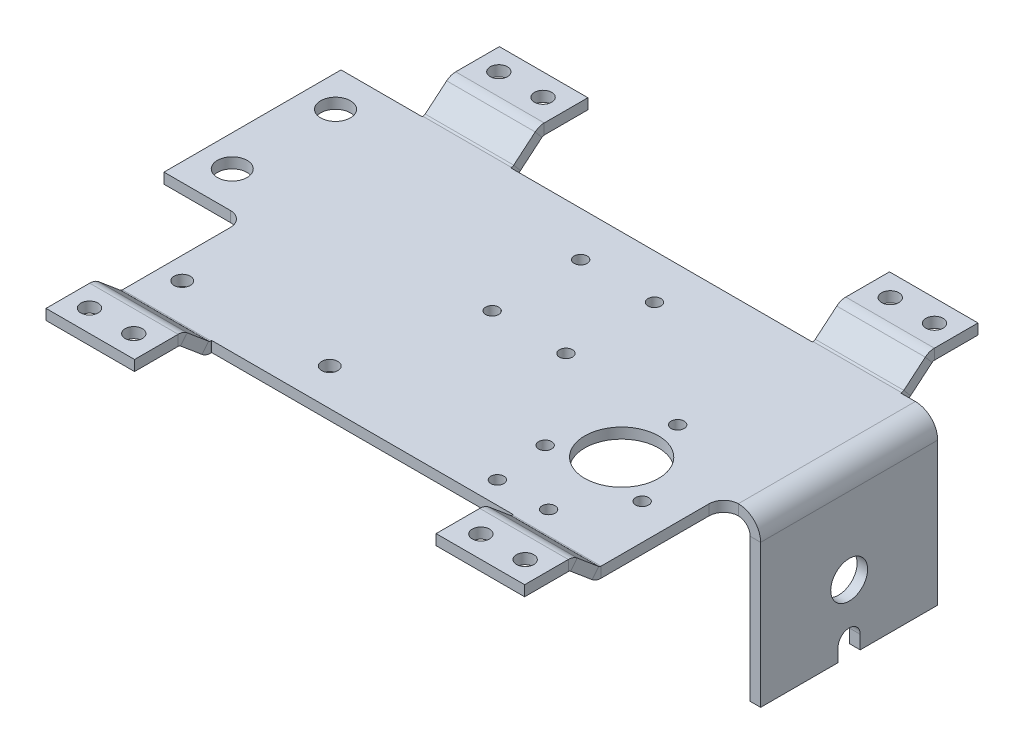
ISO-10303-21;
HEADER;
FILE_DESCRIPTION(('STEP AP214'),'2;1');
FILE_NAME('part.step','',(''),(''),'','','');
FILE_SCHEMA(('AUTOMOTIVE_DESIGN { 1 0 10303 214 1 1 1 1 }'));
ENDSEC;
DATA;
#1=APPLICATION_CONTEXT('core data for automotive mechanical design processes');
#2=APPLICATION_PROTOCOL_DEFINITION('international standard','automotive_design',2000,#1);
#3=PRODUCT_CONTEXT('',#1,'mechanical');
#4=PRODUCT('Part','Part','',(#3));
#5=PRODUCT_RELATED_PRODUCT_CATEGORY('part','',(#4));
#6=PRODUCT_DEFINITION_FORMATION('','',#4);
#7=PRODUCT_DEFINITION_CONTEXT('part definition',#1,'design');
#8=PRODUCT_DEFINITION('design','',#6,#7);
#9=PRODUCT_DEFINITION_SHAPE('','',#8);
#10=(LENGTH_UNIT() NAMED_UNIT(*) SI_UNIT(.MILLI.,.METRE.));
#11=(NAMED_UNIT(*) PLANE_ANGLE_UNIT() SI_UNIT($,.RADIAN.));
#12=(NAMED_UNIT(*) SI_UNIT($,.STERADIAN.) SOLID_ANGLE_UNIT());
#13=UNCERTAINTY_MEASURE_WITH_UNIT(LENGTH_MEASURE(1.E-05),#10,'distance_accuracy_value','');
#14=(GEOMETRIC_REPRESENTATION_CONTEXT(3) GLOBAL_UNCERTAINTY_ASSIGNED_CONTEXT((#13)) GLOBAL_UNIT_ASSIGNED_CONTEXT((#10,
#11,#12)) REPRESENTATION_CONTEXT('',''));
#15=CARTESIAN_POINT('',(0.,0.,0.));
#16=DIRECTION('',(0.,0.,1.));
#17=DIRECTION('',(1.,0.,0.));
#18=AXIS2_PLACEMENT_3D('',#15,#16,#17);
#19=CARTESIAN_POINT('',(26.0350000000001,-40.3225,-3.8735));
#20=DIRECTION('',(0.,-1.,0.));
#21=DIRECTION('',(1.,0.,0.));
#22=AXIS2_PLACEMENT_3D('',#19,#20,#21);
#23=PLANE('',#22);
#24=DIRECTION('',(1.,0.,0.));
#25=VECTOR('',#24,1.);
#26=CARTESIAN_POINT('',(26.0350000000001,-40.3225,-25.2984));
#27=LINE('',#26,#25);
#28=CARTESIAN_POINT('',(23.7744000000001,-40.3225,-25.2984));
#29=VERTEX_POINT('',#28);
#30=CARTESIAN_POINT('',(26.0350000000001,-40.3225,-25.2984));
#31=VERTEX_POINT('',#30);
#32=EDGE_CURVE('E504',#29,#31,#27,.T.);
#33=ORIENTED_EDGE('',*,*,#32,.F.);
#34=DIRECTION('',(0.,0.,-1.));
#35=VECTOR('',#34,1.);
#36=CARTESIAN_POINT('',(23.7744000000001,-40.3225,0.));
#37=LINE('',#36,#35);
#38=CARTESIAN_POINT('',(23.7744000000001,-40.3225,-41.9735));
#39=VERTEX_POINT('',#38);
#40=EDGE_CURVE('E883',#39,#29,#37,.F.);
#41=ORIENTED_EDGE('',*,*,#40,.F.);
#42=DIRECTION('',(-1.,0.,0.));
#43=VECTOR('',#42,1.);
#44=CARTESIAN_POINT('',(26.0350000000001,-40.3225,-41.9735));
#45=LINE('',#44,#43);
#46=CARTESIAN_POINT('',(26.0350000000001,-40.3225,-41.9735));
#47=VERTEX_POINT('',#46);
#48=EDGE_CURVE('E900',#47,#39,#45,.T.);
#49=ORIENTED_EDGE('',*,*,#48,.F.);
#50=DIRECTION('',(0.,0.,1.));
#51=VECTOR('',#50,1.);
#52=CARTESIAN_POINT('',(26.0350000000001,-40.3225,-3.8735));
#53=LINE('',#52,#51);
#54=EDGE_CURVE('E911',#47,#31,#53,.T.);
#55=ORIENTED_EDGE('',*,*,#54,.T.);
#56=EDGE_LOOP('',(#33,#41,#49,#55));
#57=FACE_BOUND('',#56,.T.);
#58=ADVANCED_FACE('F82',(#57),#23,.T.);
#59=CARTESIAN_POINT('',(-84.8995,-7.0231,22.3647));
#60=DIRECTION('',(-1.,0.,0.));
#61=DIRECTION('',(0.,0.,1.));
#62=AXIS2_PLACEMENT_3D('',#59,#60,#61);
#63=PLANE('',#62);
#64=DIRECTION('',(0.,0.,1.));
#65=VECTOR('',#64,1.);
#66=CARTESIAN_POINT('',(-84.8995,-4.7625,22.3647));
#67=LINE('',#66,#65);
#68=CARTESIAN_POINT('',(-84.8995,-4.7625,-0.698500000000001));
#69=VERTEX_POINT('',#68);
#70=CARTESIAN_POINT('',(-84.8995,-4.7625,22.5253450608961));
#71=VERTEX_POINT('',#70);
#72=EDGE_CURVE('E700',#69,#71,#67,.T.);
#73=ORIENTED_EDGE('',*,*,#72,.F.);
#74=DIRECTION('',(0.,1.,0.));
#75=VECTOR('',#74,1.);
#76=CARTESIAN_POINT('',(-84.8995,-7.0231,-0.698500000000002));
#77=LINE('',#76,#75);
#78=CARTESIAN_POINT('',(-84.8995,-7.0231,-0.698500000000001));
#79=VERTEX_POINT('',#78);
#80=EDGE_CURVE('E2372',#69,#79,#77,.F.);
#81=ORIENTED_EDGE('',*,*,#80,.T.);
#82=DIRECTION('',(0.,0.,1.));
#83=VECTOR('',#82,1.);
#84=CARTESIAN_POINT('',(-84.8995,-7.0231,22.3647));
#85=LINE('',#84,#83);
#86=CARTESIAN_POINT('',(-84.8995,-7.0231,22.5253450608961));
#87=VERTEX_POINT('',#86);
#88=EDGE_CURVE('E2353',#79,#87,#85,.T.);
#89=ORIENTED_EDGE('',*,*,#88,.T.);
#90=DIRECTION('',(0.,1.,0.));
#91=VECTOR('',#90,1.);
#92=CARTESIAN_POINT('',(-84.8995,-7.0231,22.5253450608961));
#93=LINE('',#92,#91);
#94=EDGE_CURVE('E697',#87,#71,#93,.T.);
#95=ORIENTED_EDGE('',*,*,#94,.T.);
#96=EDGE_LOOP('',(#73,#81,#89,#95));
#97=FACE_BOUND('',#96,.T.);
#98=ADVANCED_FACE('F1004',(#97),#63,.T.);
#99=CARTESIAN_POINT('',(0.,-7.0231,0.));
#100=DIRECTION('',(0.,1.,0.));
#101=DIRECTION('',(0.,0.,1.));
#102=AXIS2_PLACEMENT_3D('',#99,#100,#101);
#103=PLANE('',#102);
#104=CARTESIAN_POINT('',(-9.1313,-7.0231,17.6149));
#105=DIRECTION('',(0.,-1.,0.));
#106=DIRECTION('',(0.,0.,-1.));
#107=AXIS2_PLACEMENT_3D('',#104,#105,#106);
#108=CIRCLE('',#107,1.397);
#109=CARTESIAN_POINT('',(-9.1313,-7.0231,16.2179));
#110=VERTEX_POINT('',#109);
#111=EDGE_CURVE('E2733',#110,#110,#108,.T.);
#112=ORIENTED_EDGE('',*,*,#111,.F.);
#113=EDGE_LOOP('',(#112));
#114=FACE_BOUND('',#113,.T.);
#115=CARTESIAN_POINT('',(1.8923,-7.0231,17.6149));
#116=DIRECTION('',(0.,-1.,0.));
#117=DIRECTION('',(0.,0.,-1.));
#118=AXIS2_PLACEMENT_3D('',#115,#116,#117);
#119=CIRCLE('',#118,1.397);
#120=CARTESIAN_POINT('',(1.8923,-7.0231,16.2179));
#121=VERTEX_POINT('',#120);
#122=EDGE_CURVE('E2735',#121,#121,#119,.T.);
#123=ORIENTED_EDGE('',*,*,#122,.F.);
#124=EDGE_LOOP('',(#123));
#125=FACE_BOUND('',#124,.T.);
#126=CARTESIAN_POINT('',(-25.3238,-7.0231,-32.385));
#127=DIRECTION('',(0.,-1.,0.));
#128=DIRECTION('',(0.,0.,-1.));
#129=AXIS2_PLACEMENT_3D('',#126,#127,#128);
#130=CIRCLE('',#129,1.397);
#131=CARTESIAN_POINT('',(-25.3238,-7.0231,-33.782));
#132=VERTEX_POINT('',#131);
#133=EDGE_CURVE('E2789',#132,#132,#130,.T.);
#134=ORIENTED_EDGE('',*,*,#133,.F.);
#135=EDGE_LOOP('',(#134));
#136=FACE_BOUND('',#135,.T.);
#137=CARTESIAN_POINT('',(-41.1988,-7.0231,-32.385));
#138=DIRECTION('',(0.,-1.,0.));
#139=DIRECTION('',(0.,0.,-1.));
#140=AXIS2_PLACEMENT_3D('',#137,#138,#139);
#141=CIRCLE('',#140,1.39700000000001);
#142=CARTESIAN_POINT('',(-41.1988,-7.0231,-33.782));
#143=VERTEX_POINT('',#142);
#144=EDGE_CURVE('E2795',#143,#143,#141,.T.);
#145=ORIENTED_EDGE('',*,*,#144,.F.);
#146=EDGE_LOOP('',(#145));
#147=FACE_BOUND('',#146,.T.);
#148=CARTESIAN_POINT('',(-41.1988,-7.0231,-13.335));
#149=DIRECTION('',(0.,-1.,0.));
#150=DIRECTION('',(0.,0.,-1.));
#151=AXIS2_PLACEMENT_3D('',#148,#149,#150);
#152=CIRCLE('',#151,1.397);
#153=CARTESIAN_POINT('',(-41.1988,-7.0231,-14.732));
#154=VERTEX_POINT('',#153);
#155=EDGE_CURVE('E2801',#154,#154,#152,.T.);
#156=ORIENTED_EDGE('',*,*,#155,.F.);
#157=EDGE_LOOP('',(#156));
#158=FACE_BOUND('',#157,.T.);
#159=CARTESIAN_POINT('',(-25.3238,-7.0231,-13.335));
#160=DIRECTION('',(0.,-1.,0.));
#161=DIRECTION('',(0.,0.,-1.));
#162=AXIS2_PLACEMENT_3D('',#159,#160,#161);
#163=CIRCLE('',#162,1.397);
#164=CARTESIAN_POINT('',(-25.3238,-7.0231,-14.732));
#165=VERTEX_POINT('',#164);
#166=EDGE_CURVE('E2807',#165,#165,#163,.T.);
#167=ORIENTED_EDGE('',*,*,#166,.F.);
#168=EDGE_LOOP('',(#167));
#169=FACE_BOUND('',#168,.T.);
#170=CARTESIAN_POINT('',(-48.387,-7.0231,14.4272));
#171=DIRECTION('',(0.,-1.,0.));
#172=DIRECTION('',(0.,0.,-1.));
#173=AXIS2_PLACEMENT_3D('',#170,#171,#172);
#174=CIRCLE('',#173,1.7399);
#175=CARTESIAN_POINT('',(-48.387,-7.0231,12.6873));
#176=VERTEX_POINT('',#175);
#177=EDGE_CURVE('E2813',#176,#176,#174,.T.);
#178=ORIENTED_EDGE('',*,*,#177,.F.);
#179=EDGE_LOOP('',(#178));
#180=FACE_BOUND('',#179,.T.);
#181=CARTESIAN_POINT('',(-80.137,-7.0231,14.4272));
#182=DIRECTION('',(0.,-1.,0.));
#183=DIRECTION('',(0.,0.,-1.));
#184=AXIS2_PLACEMENT_3D('',#181,#182,#183);
#185=CIRCLE('',#184,1.7399);
#186=CARTESIAN_POINT('',(-80.137,-7.0231,12.6873));
#187=VERTEX_POINT('',#186);
#188=EDGE_CURVE('E2819',#187,#187,#185,.T.);
#189=ORIENTED_EDGE('',*,*,#188,.F.);
#190=EDGE_LOOP('',(#189));
#191=FACE_BOUND('',#190,.T.);
#192=CARTESIAN_POINT('',(-95.6056,-7.0231,-11.811));
#193=DIRECTION('',(0.,-1.,0.));
#194=DIRECTION('',(0.,0.,-1.));
#195=AXIS2_PLACEMENT_3D('',#192,#193,#194);
#196=CIRCLE('',#195,3.2004);
#197=CARTESIAN_POINT('',(-95.6056,-7.0231,-15.0114));
#198=VERTEX_POINT('',#197);
#199=EDGE_CURVE('E2825',#198,#198,#196,.T.);
#200=ORIENTED_EDGE('',*,*,#199,.F.);
#201=EDGE_LOOP('',(#200));
#202=FACE_BOUND('',#201,.T.);
#203=CARTESIAN_POINT('',(-95.6056,-7.0231,-34.036));
#204=DIRECTION('',(0.,-1.,0.));
#205=DIRECTION('',(0.,0.,-1.));
#206=AXIS2_PLACEMENT_3D('',#203,#204,#205);
#207=CIRCLE('',#206,3.2004);
#208=CARTESIAN_POINT('',(-95.6056,-7.0231,-37.2364));
#209=VERTEX_POINT('',#208);
#210=EDGE_CURVE('E2831',#209,#209,#207,.T.);
#211=ORIENTED_EDGE('',*,*,#210,.F.);
#212=EDGE_LOOP('',(#211));
#213=FACE_BOUND('',#212,.T.);
#214=CARTESIAN_POINT('',(10.4375979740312,-7.0231,6.0261499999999));
#215=DIRECTION('',(0.,1.,0.));
#216=DIRECTION('',(-0.866025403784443,0.,-0.499999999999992));
#217=AXIS2_PLACEMENT_3D('',#214,#215,#216);
#218=CIRCLE('',#217,1.397);
#219=CARTESIAN_POINT('',(9.22776048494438,-7.0231,5.32764999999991));
#220=VERTEX_POINT('',#219);
#221=EDGE_CURVE('E2840',#220,#220,#218,.T.);
#222=ORIENTED_EDGE('',*,*,#221,.T.);
#223=EDGE_LOOP('',(#222));
#224=FACE_BOUND('',#223,.T.);
#225=CARTESIAN_POINT('',(-10.4375979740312,-7.0231,6.02615000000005));
#226=DIRECTION('',(0.,1.,0.));
#227=DIRECTION('',(0.866025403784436,0.,-0.500000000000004));
#228=AXIS2_PLACEMENT_3D('',#225,#226,#227);
#229=CIRCLE('',#228,1.397);
#230=CARTESIAN_POINT('',(-9.22776048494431,-7.0231,5.32765000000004));
#231=VERTEX_POINT('',#230);
#232=EDGE_CURVE('E2846',#231,#231,#229,.T.);
#233=ORIENTED_EDGE('',*,*,#232,.T.);
#234=EDGE_LOOP('',(#233));
#235=FACE_BOUND('',#234,.T.);
#236=CARTESIAN_POINT('',(0.,-7.0231,-12.0523));
#237=DIRECTION('',(0.,1.,0.));
#238=DIRECTION('',(0.,0.,1.));
#239=AXIS2_PLACEMENT_3D('',#236,#237,#238);
#240=CIRCLE('',#239,1.397);
#241=CARTESIAN_POINT('',(0.,-7.0231,-10.6553));
#242=VERTEX_POINT('',#241);
#243=EDGE_CURVE('E500',#242,#242,#240,.T.);
#244=ORIENTED_EDGE('',*,*,#243,.T.);
#245=EDGE_LOOP('',(#244));
#246=FACE_BOUND('',#245,.T.);
#247=CARTESIAN_POINT('',(0.,-7.0231,0.));
#248=DIRECTION('',(0.,1.,0.));
#249=DIRECTION('',(0.,0.,1.));
#250=AXIS2_PLACEMENT_3D('',#247,#248,#249);
#251=CIRCLE('',#250,7.9375);
#252=CARTESIAN_POINT('',(0.,-7.0231,7.9375));
#253=VERTEX_POINT('',#252);
#254=EDGE_CURVE('E639',#253,#253,#251,.T.);
#255=ORIENTED_EDGE('',*,*,#254,.T.);
#256=EDGE_LOOP('',(#255));
#257=FACE_BOUND('',#256,.T.);
#258=CARTESIAN_POINT('',(-84.8995,-7.0231,-42.1341450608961));
#259=VERTEX_POINT('',#258);
#260=CARTESIAN_POINT('',(-84.8995,-7.0231,-41.9735));
#261=VERTEX_POINT('',#260);
#262=EDGE_CURVE('E701',#259,#261,#85,.T.);
#263=ORIENTED_EDGE('',*,*,#262,.F.);
#264=DIRECTION('',(1.,0.,0.));
#265=VECTOR('',#264,1.);
#266=CARTESIAN_POINT('',(0.,-7.0231,-42.1341450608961));
#267=LINE('',#266,#265);
#268=CARTESIAN_POINT('',(-65.8495,-7.0231,-42.1341450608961));
#269=VERTEX_POINT('',#268);
#270=EDGE_CURVE('E2334',#259,#269,#267,.T.);
#271=ORIENTED_EDGE('',*,*,#270,.T.);
#272=DIRECTION('',(0.,0.,-1.));
#273=VECTOR('',#272,1.);
#274=CARTESIAN_POINT('',(-65.8495,-7.0231,-41.9735));
#275=LINE('',#274,#273);
#276=CARTESIAN_POINT('',(-65.8495,-7.0231,-41.9735));
#277=VERTEX_POINT('',#276);
#278=EDGE_CURVE('E2264',#277,#269,#275,.T.);
#279=ORIENTED_EDGE('',*,*,#278,.F.);
#280=DIRECTION('',(-1.,0.,0.));
#281=VECTOR('',#280,1.);
#282=CARTESIAN_POINT('',(18.0975,-7.0231,-41.9735));
#283=LINE('',#282,#281);
#284=CARTESIAN_POINT('',(-0.952500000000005,-7.0231,-41.9735));
#285=VERTEX_POINT('',#284);
#286=EDGE_CURVE('E843',#285,#277,#283,.T.);
#287=ORIENTED_EDGE('',*,*,#286,.F.);
#288=DIRECTION('',(0.,0.,-1.));
#289=VECTOR('',#288,1.);
#290=CARTESIAN_POINT('',(-0.952500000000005,-7.0231,-41.9735));
#291=LINE('',#290,#289);
#292=CARTESIAN_POINT('',(-0.952500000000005,-7.0231,-42.1341450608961));
#293=VERTEX_POINT('',#292);
#294=EDGE_CURVE('E635',#285,#293,#291,.T.);
#295=ORIENTED_EDGE('',*,*,#294,.T.);
#296=DIRECTION('',(1.,0.,0.));
#297=VECTOR('',#296,1.);
#298=CARTESIAN_POINT('',(0.,-7.0231,-42.1341450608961));
#299=LINE('',#298,#297);
#300=CARTESIAN_POINT('',(18.0975,-7.0231,-42.1341450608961));
#301=VERTEX_POINT('',#300);
#302=EDGE_CURVE('E638',#293,#301,#299,.T.);
#303=ORIENTED_EDGE('',*,*,#302,.T.);
#304=DIRECTION('',(0.,0.,1.));
#305=VECTOR('',#304,1.);
#306=CARTESIAN_POINT('',(18.0975,-7.0231,-41.9735));
#307=LINE('',#306,#305);
#308=CARTESIAN_POINT('',(18.0975,-7.0231,-41.9735));
#309=VERTEX_POINT('',#308);
#310=EDGE_CURVE('E640',#301,#309,#307,.T.);
#311=ORIENTED_EDGE('',*,*,#310,.T.);
#312=CARTESIAN_POINT('',(21.2344,-7.0231,-41.9735));
#313=VERTEX_POINT('',#312);
#314=EDGE_CURVE('E690',#313,#309,#283,.T.);
#315=ORIENTED_EDGE('',*,*,#314,.F.);
#316=DIRECTION('',(0.,0.,1.));
#317=VECTOR('',#316,1.);
#318=CARTESIAN_POINT('',(21.2344,-7.0231,-3.8735));
#319=LINE('',#318,#317);
#320=CARTESIAN_POINT('',(21.2344,-7.0231,-3.87327139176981));
#321=VERTEX_POINT('',#320);
#322=EDGE_CURVE('E872',#321,#313,#319,.F.);
#323=ORIENTED_EDGE('',*,*,#322,.F.);
#324=CARTESIAN_POINT('',(21.2725,-7.0231,-0.698500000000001));
#325=DIRECTION('',(0.,1.,0.));
#326=DIRECTION('',(0.,0.,1.));
#327=AXIS2_PLACEMENT_3D('',#324,#325,#326);
#328=CIRCLE('',#327,3.175);
#329=CARTESIAN_POINT('',(18.0975,-7.0231,-0.698500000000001));
#330=VERTEX_POINT('',#329);
#331=EDGE_CURVE('E642',#321,#330,#328,.T.);
#332=ORIENTED_EDGE('',*,*,#331,.T.);
#333=DIRECTION('',(0.,0.,-1.));
#334=VECTOR('',#333,1.);
#335=CARTESIAN_POINT('',(18.0975,-7.0231,22.3647));
#336=LINE('',#335,#334);
#337=CARTESIAN_POINT('',(18.0975,-7.0231,22.5253450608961));
#338=VERTEX_POINT('',#337);
#339=EDGE_CURVE('E789',#338,#330,#336,.T.);
#340=ORIENTED_EDGE('',*,*,#339,.F.);
#341=DIRECTION('',(-1.,0.,0.));
#342=VECTOR('',#341,1.);
#343=CARTESIAN_POINT('',(0.,-7.0231,22.5253450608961));
#344=LINE('',#343,#342);
#345=CARTESIAN_POINT('',(-0.952500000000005,-7.0231,22.5253450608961));
#346=VERTEX_POINT('',#345);
#347=EDGE_CURVE('E691',#338,#346,#344,.T.);
#348=ORIENTED_EDGE('',*,*,#347,.T.);
#349=DIRECTION('',(0.,0.,1.));
#350=VECTOR('',#349,1.);
#351=CARTESIAN_POINT('',(-0.952500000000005,-7.0231,22.3647));
#352=LINE('',#351,#350);
#353=CARTESIAN_POINT('',(-0.952500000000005,-7.0231,22.3647));
#354=VERTEX_POINT('',#353);
#355=EDGE_CURVE('E791',#354,#346,#352,.T.);
#356=ORIENTED_EDGE('',*,*,#355,.F.);
#357=DIRECTION('',(1.,0.,0.));
#358=VECTOR('',#357,1.);
#359=CARTESIAN_POINT('',(18.0975,-7.0231,22.3647));
#360=LINE('',#359,#358);
#361=CARTESIAN_POINT('',(-65.8495,-7.0231,22.3647));
#362=VERTEX_POINT('',#361);
#363=EDGE_CURVE('E830',#362,#354,#360,.T.);
#364=ORIENTED_EDGE('',*,*,#363,.F.);
#365=DIRECTION('',(0.,0.,1.));
#366=VECTOR('',#365,1.);
#367=CARTESIAN_POINT('',(-65.8495,-7.0231,22.3647));
#368=LINE('',#367,#366);
#369=CARTESIAN_POINT('',(-65.8495,-7.0231,22.5253450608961));
#370=VERTEX_POINT('',#369);
#371=EDGE_CURVE('E687',#362,#370,#368,.T.);
#372=ORIENTED_EDGE('',*,*,#371,.T.);
#373=DIRECTION('',(1.,0.,0.));
#374=VECTOR('',#373,1.);
#375=CARTESIAN_POINT('',(0.,-7.0231,22.5253450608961));
#376=LINE('',#375,#374);
#377=EDGE_CURVE('E711',#87,#370,#376,.T.);
#378=ORIENTED_EDGE('',*,*,#377,.F.);
#379=ORIENTED_EDGE('',*,*,#88,.F.);
#380=CARTESIAN_POINT('',(-88.0745,-7.0231,-0.698500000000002));
#381=DIRECTION('',(0.,1.,0.));
#382=DIRECTION('',(0.,0.,1.));
#383=AXIS2_PLACEMENT_3D('',#380,#381,#382);
#384=CIRCLE('',#383,3.175);
#385=CARTESIAN_POINT('',(-88.0745,-7.0231,-3.8735));
#386=VERTEX_POINT('',#385);
#387=EDGE_CURVE('E90',#79,#386,#384,.T.);
#388=ORIENTED_EDGE('',*,*,#387,.T.);
#389=DIRECTION('',(1.,0.,0.));
#390=VECTOR('',#389,1.);
#391=CARTESIAN_POINT('',(-84.8995,-7.0231,-3.8735));
#392=LINE('',#391,#390);
#393=CARTESIAN_POINT('',(-102.362,-7.0231,-3.8735));
#394=VERTEX_POINT('',#393);
#395=EDGE_CURVE('E520',#394,#386,#392,.T.);
#396=ORIENTED_EDGE('',*,*,#395,.F.);
#397=DIRECTION('',(0.,0.,1.));
#398=VECTOR('',#397,1.);
#399=CARTESIAN_POINT('',(-102.362,-7.0231,-41.9735));
#400=LINE('',#399,#398);
#401=CARTESIAN_POINT('',(-102.362,-7.0231,-41.9735));
#402=VERTEX_POINT('',#401);
#403=EDGE_CURVE('E516',#402,#394,#400,.T.);
#404=ORIENTED_EDGE('',*,*,#403,.F.);
#405=DIRECTION('',(-1.,0.,0.));
#406=VECTOR('',#405,1.);
#407=CARTESIAN_POINT('',(-84.8995,-7.0231,-41.9735));
#408=LINE('',#407,#406);
#409=EDGE_CURVE('E513',#261,#402,#408,.T.);
#410=ORIENTED_EDGE('',*,*,#409,.F.);
#411=EDGE_LOOP('',(#263,#271,#279,#287,#295,#303,#311,#315,#323,#332,#340,#348,#356,#364,#372,
#378,#379,#388,#396,#404,#410));
#412=FACE_BOUND('',#411,.T.);
#413=ADVANCED_FACE('F1011',(#114,#125,#136,#147,#158,#169,#180,#191,#202,#213,#224,#235,#246,
#257,#412),#103,.F.);
#414=CARTESIAN_POINT('',(-0.952500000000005,-7.0231,-41.9735));
#415=DIRECTION('',(1.,0.,0.));
#416=DIRECTION('',(0.,0.,-1.));
#417=AXIS2_PLACEMENT_3D('',#414,#415,#416);
#418=PLANE('',#417);
#419=DIRECTION('',(0.,0.,-1.));
#420=VECTOR('',#419,1.);
#421=CARTESIAN_POINT('',(-0.952500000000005,-4.7625,-41.9735));
#422=LINE('',#421,#420);
#423=CARTESIAN_POINT('',(-0.952500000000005,-4.7625,-41.9735));
#424=VERTEX_POINT('',#423);
#425=CARTESIAN_POINT('',(-0.952500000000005,-4.7625,-42.1341450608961));
#426=VERTEX_POINT('',#425);
#427=EDGE_CURVE('E602',#424,#426,#422,.T.);
#428=ORIENTED_EDGE('',*,*,#427,.T.);
#429=DIRECTION('',(0.,-1.,0.));
#430=VECTOR('',#429,1.);
#431=CARTESIAN_POINT('',(-0.952500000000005,-7.0231,-42.1341450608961));
#432=LINE('',#431,#430);
#433=EDGE_CURVE('E645',#426,#293,#432,.T.);
#434=ORIENTED_EDGE('',*,*,#433,.T.);
#435=ORIENTED_EDGE('',*,*,#294,.F.);
#436=DIRECTION('',(0.,1.,0.));
#437=VECTOR('',#436,1.);
#438=CARTESIAN_POINT('',(-0.952500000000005,-7.0231,-41.9735));
#439=LINE('',#438,#437);
#440=EDGE_CURVE('E651',#285,#424,#439,.T.);
#441=ORIENTED_EDGE('',*,*,#440,.T.);
#442=EDGE_LOOP('',(#428,#434,#435,#441));
#443=FACE_BOUND('',#442,.T.);
#444=ADVANCED_FACE('F2131',(#443),#418,.F.);
#445=CARTESIAN_POINT('',(18.0975,-7.0231,-41.9735));
#446=DIRECTION('',(-1.,0.,0.));
#447=DIRECTION('',(0.,0.,1.));
#448=AXIS2_PLACEMENT_3D('',#445,#446,#447);
#449=PLANE('',#448);
#450=ORIENTED_EDGE('',*,*,#310,.F.);
#451=DIRECTION('',(0.,1.,0.));
#452=VECTOR('',#451,1.);
#453=CARTESIAN_POINT('',(18.0975,-7.0231,-42.1341450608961));
#454=LINE('',#453,#452);
#455=CARTESIAN_POINT('',(18.0975,-4.7625,-42.1341450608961));
#456=VERTEX_POINT('',#455);
#457=EDGE_CURVE('E648',#301,#456,#454,.T.);
#458=ORIENTED_EDGE('',*,*,#457,.T.);
#459=DIRECTION('',(0.,0.,1.));
#460=VECTOR('',#459,1.);
#461=CARTESIAN_POINT('',(18.0975,-4.7625,-41.9735));
#462=LINE('',#461,#460);
#463=CARTESIAN_POINT('',(18.0975,-4.7625,-41.9735));
#464=VERTEX_POINT('',#463);
#465=EDGE_CURVE('E646',#456,#464,#462,.T.);
#466=ORIENTED_EDGE('',*,*,#465,.T.);
#467=DIRECTION('',(0.,1.,0.));
#468=VECTOR('',#467,1.);
#469=CARTESIAN_POINT('',(18.0975,-7.0231,-41.9735));
#470=LINE('',#469,#468);
#471=EDGE_CURVE('E842',#309,#464,#470,.T.);
#472=ORIENTED_EDGE('',*,*,#471,.F.);
#473=EDGE_LOOP('',(#450,#458,#466,#472));
#474=FACE_BOUND('',#473,.T.);
#475=ADVANCED_FACE('F2190',(#474),#449,.F.);
#476=CARTESIAN_POINT('',(18.0975,-7.0231,-41.9735));
#477=DIRECTION('',(0.,0.,-1.));
#478=DIRECTION('',(-1.,0.,0.));
#479=AXIS2_PLACEMENT_3D('',#476,#477,#478);
#480=PLANE('',#479);
#481=ORIENTED_EDGE('',*,*,#314,.T.);
#482=ORIENTED_EDGE('',*,*,#471,.T.);
#483=DIRECTION('',(-1.,0.,0.));
#484=VECTOR('',#483,1.);
#485=CARTESIAN_POINT('',(18.0975,-4.7625,-41.9735));
#486=LINE('',#485,#484);
#487=CARTESIAN_POINT('',(21.2344,-4.7625,-41.9735));
#488=VERTEX_POINT('',#487);
#489=EDGE_CURVE('E802',#488,#464,#486,.T.);
#490=ORIENTED_EDGE('',*,*,#489,.F.);
#491=DIRECTION('',(0.,1.,0.));
#492=VECTOR('',#491,1.);
#493=CARTESIAN_POINT('',(21.2344,-7.0231,-41.9735));
#494=LINE('',#493,#492);
#495=EDGE_CURVE('E877',#313,#488,#494,.T.);
#496=ORIENTED_EDGE('',*,*,#495,.F.);
#497=EDGE_LOOP('',(#481,#482,#490,#496));
#498=FACE_BOUND('',#497,.T.);
#499=ADVANCED_FACE('F1069',(#498),#480,.T.);
#500=DIRECTION('',(0.,1.,0.));
#501=VECTOR('',#500,1.);
#502=CARTESIAN_POINT('',(-65.8495,-7.0231,-41.9735));
#503=LINE('',#502,#501);
#504=CARTESIAN_POINT('',(-65.8495,-4.7625,-41.9735));
#505=VERTEX_POINT('',#504);
#506=EDGE_CURVE('E2268',#277,#505,#503,.T.);
#507=ORIENTED_EDGE('',*,*,#506,.T.);
#508=EDGE_CURVE('E805',#424,#505,#486,.T.);
#509=ORIENTED_EDGE('',*,*,#508,.F.);
#510=ORIENTED_EDGE('',*,*,#440,.F.);
#511=ORIENTED_EDGE('',*,*,#286,.T.);
#512=EDGE_LOOP('',(#507,#509,#510,#511));
#513=FACE_BOUND('',#512,.T.);
#514=ADVANCED_FACE('F1736',(#513),#480,.T.);
#515=DIRECTION('',(0.,1.,0.));
#516=VECTOR('',#515,1.);
#517=CARTESIAN_POINT('',(-84.8995,-7.0231,-41.9735));
#518=LINE('',#517,#516);
#519=CARTESIAN_POINT('',(-84.8995,-4.7625,-41.9735));
#520=VERTEX_POINT('',#519);
#521=EDGE_CURVE('E523',#261,#520,#518,.T.);
#522=ORIENTED_EDGE('',*,*,#521,.T.);
#523=CARTESIAN_POINT('',(-84.8995,-4.7625,-42.1341450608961));
#524=VERTEX_POINT('',#523);
#525=EDGE_CURVE('E706',#524,#520,#67,.T.);
#526=ORIENTED_EDGE('',*,*,#525,.F.);
#527=DIRECTION('',(0.,1.,0.));
#528=VECTOR('',#527,1.);
#529=CARTESIAN_POINT('',(-84.8995,-7.0231,-42.1341450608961));
#530=LINE('',#529,#528);
#531=EDGE_CURVE('E2337',#259,#524,#530,.T.);
#532=ORIENTED_EDGE('',*,*,#531,.F.);
#533=ORIENTED_EDGE('',*,*,#262,.T.);
#534=EDGE_LOOP('',(#522,#526,#532,#533));
#535=FACE_BOUND('',#534,.T.);
#536=ADVANCED_FACE('F1014',(#535),#63,.T.);
#537=CARTESIAN_POINT('',(0.,-4.7625,0.));
#538=DIRECTION('',(0.,1.,0.));
#539=DIRECTION('',(0.,0.,1.));
#540=AXIS2_PLACEMENT_3D('',#537,#538,#539);
#541=PLANE('',#540);
#542=CARTESIAN_POINT('',(-9.1313,-4.7625,17.6149));
#543=DIRECTION('',(0.,-1.,0.));
#544=DIRECTION('',(0.,0.,-1.));
#545=AXIS2_PLACEMENT_3D('',#542,#543,#544);
#546=CIRCLE('',#545,1.397);
#547=CARTESIAN_POINT('',(-9.1313,-4.7625,16.2179));
#548=VERTEX_POINT('',#547);
#549=EDGE_CURVE('E2730',#548,#548,#546,.T.);
#550=ORIENTED_EDGE('',*,*,#549,.T.);
#551=EDGE_LOOP('',(#550));
#552=FACE_BOUND('',#551,.T.);
#553=CARTESIAN_POINT('',(1.8923,-4.7625,17.6149));
#554=DIRECTION('',(0.,-1.,0.));
#555=DIRECTION('',(0.,0.,-1.));
#556=AXIS2_PLACEMENT_3D('',#553,#554,#555);
#557=CIRCLE('',#556,1.397);
#558=CARTESIAN_POINT('',(1.8923,-4.7625,16.2179));
#559=VERTEX_POINT('',#558);
#560=EDGE_CURVE('E2738',#559,#559,#557,.T.);
#561=ORIENTED_EDGE('',*,*,#560,.T.);
#562=EDGE_LOOP('',(#561));
#563=FACE_BOUND('',#562,.T.);
#564=CARTESIAN_POINT('',(-25.3238,-4.7625,-32.385));
#565=DIRECTION('',(0.,-1.,0.));
#566=DIRECTION('',(0.,0.,-1.));
#567=AXIS2_PLACEMENT_3D('',#564,#565,#566);
#568=CIRCLE('',#567,1.397);
#569=CARTESIAN_POINT('',(-25.3238,-4.7625,-33.782));
#570=VERTEX_POINT('',#569);
#571=EDGE_CURVE('E2792',#570,#570,#568,.T.);
#572=ORIENTED_EDGE('',*,*,#571,.T.);
#573=EDGE_LOOP('',(#572));
#574=FACE_BOUND('',#573,.T.);
#575=CARTESIAN_POINT('',(-41.1988,-4.7625,-32.385));
#576=DIRECTION('',(0.,-1.,0.));
#577=DIRECTION('',(0.,0.,-1.));
#578=AXIS2_PLACEMENT_3D('',#575,#576,#577);
#579=CIRCLE('',#578,1.39700000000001);
#580=CARTESIAN_POINT('',(-41.1988,-4.7625,-33.782));
#581=VERTEX_POINT('',#580);
#582=EDGE_CURVE('E2798',#581,#581,#579,.T.);
#583=ORIENTED_EDGE('',*,*,#582,.T.);
#584=EDGE_LOOP('',(#583));
#585=FACE_BOUND('',#584,.T.);
#586=CARTESIAN_POINT('',(-41.1988,-4.7625,-13.335));
#587=DIRECTION('',(0.,-1.,0.));
#588=DIRECTION('',(0.,0.,-1.));
#589=AXIS2_PLACEMENT_3D('',#586,#587,#588);
#590=CIRCLE('',#589,1.397);
#591=CARTESIAN_POINT('',(-41.1988,-4.7625,-14.732));
#592=VERTEX_POINT('',#591);
#593=EDGE_CURVE('E2804',#592,#592,#590,.T.);
#594=ORIENTED_EDGE('',*,*,#593,.T.);
#595=EDGE_LOOP('',(#594));
#596=FACE_BOUND('',#595,.T.);
#597=CARTESIAN_POINT('',(-25.3238,-4.7625,-13.335));
#598=DIRECTION('',(0.,-1.,0.));
#599=DIRECTION('',(0.,0.,-1.));
#600=AXIS2_PLACEMENT_3D('',#597,#598,#599);
#601=CIRCLE('',#600,1.397);
#602=CARTESIAN_POINT('',(-25.3238,-4.7625,-14.732));
#603=VERTEX_POINT('',#602);
#604=EDGE_CURVE('E2810',#603,#603,#601,.T.);
#605=ORIENTED_EDGE('',*,*,#604,.T.);
#606=EDGE_LOOP('',(#605));
#607=FACE_BOUND('',#606,.T.);
#608=CARTESIAN_POINT('',(-48.387,-4.7625,14.4272));
#609=DIRECTION('',(0.,-1.,0.));
#610=DIRECTION('',(0.,0.,-1.));
#611=AXIS2_PLACEMENT_3D('',#608,#609,#610);
#612=CIRCLE('',#611,1.7399);
#613=CARTESIAN_POINT('',(-48.387,-4.7625,12.6873));
#614=VERTEX_POINT('',#613);
#615=EDGE_CURVE('E2816',#614,#614,#612,.T.);
#616=ORIENTED_EDGE('',*,*,#615,.T.);
#617=EDGE_LOOP('',(#616));
#618=FACE_BOUND('',#617,.T.);
#619=CARTESIAN_POINT('',(-80.137,-4.7625,14.4272));
#620=DIRECTION('',(0.,-1.,0.));
#621=DIRECTION('',(0.,0.,-1.));
#622=AXIS2_PLACEMENT_3D('',#619,#620,#621);
#623=CIRCLE('',#622,1.7399);
#624=CARTESIAN_POINT('',(-80.137,-4.7625,12.6873));
#625=VERTEX_POINT('',#624);
#626=EDGE_CURVE('E2822',#625,#625,#623,.T.);
#627=ORIENTED_EDGE('',*,*,#626,.T.);
#628=EDGE_LOOP('',(#627));
#629=FACE_BOUND('',#628,.T.);
#630=CARTESIAN_POINT('',(-95.6056,-4.7625,-11.811));
#631=DIRECTION('',(0.,-1.,0.));
#632=DIRECTION('',(0.,0.,-1.));
#633=AXIS2_PLACEMENT_3D('',#630,#631,#632);
#634=CIRCLE('',#633,3.2004);
#635=CARTESIAN_POINT('',(-95.6056,-4.7625,-15.0114));
#636=VERTEX_POINT('',#635);
#637=EDGE_CURVE('E2828',#636,#636,#634,.T.);
#638=ORIENTED_EDGE('',*,*,#637,.T.);
#639=EDGE_LOOP('',(#638));
#640=FACE_BOUND('',#639,.T.);
#641=CARTESIAN_POINT('',(-95.6056,-4.7625,-34.036));
#642=DIRECTION('',(0.,-1.,0.));
#643=DIRECTION('',(0.,0.,-1.));
#644=AXIS2_PLACEMENT_3D('',#641,#642,#643);
#645=CIRCLE('',#644,3.2004);
#646=CARTESIAN_POINT('',(-95.6056,-4.7625,-37.2364));
#647=VERTEX_POINT('',#646);
#648=EDGE_CURVE('E2834',#647,#647,#645,.T.);
#649=ORIENTED_EDGE('',*,*,#648,.T.);
#650=EDGE_LOOP('',(#649));
#651=FACE_BOUND('',#650,.T.);
#652=CARTESIAN_POINT('',(10.4375979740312,-4.7625,6.0261499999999));
#653=DIRECTION('',(0.,1.,0.));
#654=DIRECTION('',(-0.866025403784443,0.,-0.499999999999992));
#655=AXIS2_PLACEMENT_3D('',#652,#653,#654);
#656=CIRCLE('',#655,1.397);
#657=CARTESIAN_POINT('',(9.22776048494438,-4.7625,5.32764999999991));
#658=VERTEX_POINT('',#657);
#659=EDGE_CURVE('E2837',#658,#658,#656,.T.);
#660=ORIENTED_EDGE('',*,*,#659,.F.);
#661=EDGE_LOOP('',(#660));
#662=FACE_BOUND('',#661,.T.);
#663=CARTESIAN_POINT('',(-10.4375979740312,-4.7625,6.02615000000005));
#664=DIRECTION('',(0.,1.,0.));
#665=DIRECTION('',(0.866025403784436,0.,-0.500000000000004));
#666=AXIS2_PLACEMENT_3D('',#663,#664,#665);
#667=CIRCLE('',#666,1.397);
#668=CARTESIAN_POINT('',(-9.22776048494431,-4.7625,5.32765000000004));
#669=VERTEX_POINT('',#668);
#670=EDGE_CURVE('E2843',#669,#669,#667,.T.);
#671=ORIENTED_EDGE('',*,*,#670,.F.);
#672=EDGE_LOOP('',(#671));
#673=FACE_BOUND('',#672,.T.);
#674=CARTESIAN_POINT('',(0.,-4.7625,-12.0523));
#675=DIRECTION('',(0.,1.,0.));
#676=DIRECTION('',(0.,0.,1.));
#677=AXIS2_PLACEMENT_3D('',#674,#675,#676);
#678=CIRCLE('',#677,1.397);
#679=CARTESIAN_POINT('',(0.,-4.7625,-10.6553));
#680=VERTEX_POINT('',#679);
#681=EDGE_CURVE('E496',#680,#680,#678,.T.);
#682=ORIENTED_EDGE('',*,*,#681,.F.);
#683=EDGE_LOOP('',(#682));
#684=FACE_BOUND('',#683,.T.);
#685=DIRECTION('',(1.,0.,0.));
#686=VECTOR('',#685,1.);
#687=CARTESIAN_POINT('',(0.,-4.7625,-42.1341450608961));
#688=LINE('',#687,#686);
#689=CARTESIAN_POINT('',(-65.8495,-4.7625,-42.1341450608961));
#690=VERTEX_POINT('',#689);
#691=EDGE_CURVE('E2340',#524,#690,#688,.T.);
#692=ORIENTED_EDGE('',*,*,#691,.F.);
#693=ORIENTED_EDGE('',*,*,#525,.T.);
#694=DIRECTION('',(-1.,0.,0.));
#695=VECTOR('',#694,1.);
#696=CARTESIAN_POINT('',(-84.8995,-4.7625,-41.9735));
#697=LINE('',#696,#695);
#698=CARTESIAN_POINT('',(-102.362,-4.7625,-41.9735));
#699=VERTEX_POINT('',#698);
#700=EDGE_CURVE('E510',#520,#699,#697,.T.);
#701=ORIENTED_EDGE('',*,*,#700,.T.);
#702=DIRECTION('',(0.,0.,1.));
#703=VECTOR('',#702,1.);
#704=CARTESIAN_POINT('',(-102.362,-4.7625,-41.9735));
#705=LINE('',#704,#703);
#706=CARTESIAN_POINT('',(-102.362,-4.7625,-3.8735));
#707=VERTEX_POINT('',#706);
#708=EDGE_CURVE('E526',#699,#707,#705,.T.);
#709=ORIENTED_EDGE('',*,*,#708,.T.);
#710=DIRECTION('',(1.,0.,0.));
#711=VECTOR('',#710,1.);
#712=CARTESIAN_POINT('',(-84.8995,-4.7625,-3.8735));
#713=LINE('',#712,#711);
#714=CARTESIAN_POINT('',(-88.0745,-4.7625,-3.8735));
#715=VERTEX_POINT('',#714);
#716=EDGE_CURVE('E517',#707,#715,#713,.T.);
#717=ORIENTED_EDGE('',*,*,#716,.T.);
#718=CARTESIAN_POINT('',(-88.0745,-4.7625,-0.698500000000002));
#719=DIRECTION('',(0.,1.,0.));
#720=DIRECTION('',(0.,0.,1.));
#721=AXIS2_PLACEMENT_3D('',#718,#719,#720);
#722=CIRCLE('',#721,3.175);
#723=EDGE_CURVE('E104',#715,#69,#722,.F.);
#724=ORIENTED_EDGE('',*,*,#723,.T.);
#725=ORIENTED_EDGE('',*,*,#72,.T.);
#726=DIRECTION('',(1.,0.,0.));
#727=VECTOR('',#726,1.);
#728=CARTESIAN_POINT('',(0.,-4.7625,22.5253450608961));
#729=LINE('',#728,#727);
#730=CARTESIAN_POINT('',(-65.8495,-4.7625,22.5253450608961));
#731=VERTEX_POINT('',#730);
#732=EDGE_CURVE('E702',#71,#731,#729,.T.);
#733=ORIENTED_EDGE('',*,*,#732,.T.);
#734=DIRECTION('',(0.,0.,1.));
#735=VECTOR('',#734,1.);
#736=CARTESIAN_POINT('',(-65.8495,-4.7625,22.3647));
#737=LINE('',#736,#735);
#738=CARTESIAN_POINT('',(-65.8495,-4.7625,22.3647));
#739=VERTEX_POINT('',#738);
#740=EDGE_CURVE('E692',#739,#731,#737,.T.);
#741=ORIENTED_EDGE('',*,*,#740,.F.);
#742=DIRECTION('',(1.,0.,0.));
#743=VECTOR('',#742,1.);
#744=CARTESIAN_POINT('',(18.0975,-4.7625,22.3647));
#745=LINE('',#744,#743);
#746=CARTESIAN_POINT('',(-0.952500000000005,-4.7625,22.3647));
#747=VERTEX_POINT('',#746);
#748=EDGE_CURVE('E705',#739,#747,#745,.T.);
#749=ORIENTED_EDGE('',*,*,#748,.T.);
#750=DIRECTION('',(0.,0.,1.));
#751=VECTOR('',#750,1.);
#752=CARTESIAN_POINT('',(-0.952500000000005,-4.7625,22.3647));
#753=LINE('',#752,#751);
#754=CARTESIAN_POINT('',(-0.952500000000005,-4.7625,22.5253450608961));
#755=VERTEX_POINT('',#754);
#756=EDGE_CURVE('E794',#747,#755,#753,.T.);
#757=ORIENTED_EDGE('',*,*,#756,.T.);
#758=DIRECTION('',(-1.,0.,0.));
#759=VECTOR('',#758,1.);
#760=CARTESIAN_POINT('',(0.,-4.7625,22.5253450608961));
#761=LINE('',#760,#759);
#762=CARTESIAN_POINT('',(18.0975,-4.7625,22.5253450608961));
#763=VERTEX_POINT('',#762);
#764=EDGE_CURVE('E920',#763,#755,#761,.T.);
#765=ORIENTED_EDGE('',*,*,#764,.F.);
#766=DIRECTION('',(0.,0.,-1.));
#767=VECTOR('',#766,1.);
#768=CARTESIAN_POINT('',(18.0975,-4.7625,22.3647));
#769=LINE('',#768,#767);
#770=CARTESIAN_POINT('',(18.0975,-4.7625,-0.698500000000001));
#771=VERTEX_POINT('',#770);
#772=EDGE_CURVE('E796',#763,#771,#769,.T.);
#773=ORIENTED_EDGE('',*,*,#772,.T.);
#774=CARTESIAN_POINT('',(21.2725,-4.7625,-0.698500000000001));
#775=DIRECTION('',(0.,1.,0.));
#776=DIRECTION('',(0.,0.,1.));
#777=AXIS2_PLACEMENT_3D('',#774,#775,#776);
#778=CIRCLE('',#777,3.175);
#779=CARTESIAN_POINT('',(21.2344,-4.7625,-3.87327139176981));
#780=VERTEX_POINT('',#779);
#781=EDGE_CURVE('E809',#771,#780,#778,.F.);
#782=ORIENTED_EDGE('',*,*,#781,.T.);
#783=DIRECTION('',(0.,0.,1.));
#784=VECTOR('',#783,1.);
#785=CARTESIAN_POINT('',(21.2344,-4.7625,-3.8735));
#786=LINE('',#785,#784);
#787=EDGE_CURVE('E806',#780,#488,#786,.F.);
#788=ORIENTED_EDGE('',*,*,#787,.T.);
#789=ORIENTED_EDGE('',*,*,#489,.T.);
#790=ORIENTED_EDGE('',*,*,#465,.F.);
#791=DIRECTION('',(1.,0.,0.));
#792=VECTOR('',#791,1.);
#793=CARTESIAN_POINT('',(0.,-4.7625,-42.1341450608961));
#794=LINE('',#793,#792);
#795=EDGE_CURVE('E612',#426,#456,#794,.T.);
#796=ORIENTED_EDGE('',*,*,#795,.F.);
#797=ORIENTED_EDGE('',*,*,#427,.F.);
#798=ORIENTED_EDGE('',*,*,#508,.T.);
#799=DIRECTION('',(0.,0.,-1.));
#800=VECTOR('',#799,1.);
#801=CARTESIAN_POINT('',(-65.8495,-4.7625,-41.9735));
#802=LINE('',#801,#800);
#803=EDGE_CURVE('E839',#505,#690,#802,.T.);
#804=ORIENTED_EDGE('',*,*,#803,.T.);
#805=EDGE_LOOP('',(#692,#693,#701,#709,#717,#724,#725,#733,#741,#749,#757,#765,#773,#782,#788,
#789,#790,#796,#797,#798,#804));
#806=FACE_BOUND('',#805,.T.);
#807=CARTESIAN_POINT('',(0.,-4.7625,0.));
#808=DIRECTION('',(0.,1.,0.));
#809=DIRECTION('',(0.,0.,1.));
#810=AXIS2_PLACEMENT_3D('',#807,#808,#809);
#811=CIRCLE('',#810,7.9375);
#812=CARTESIAN_POINT('',(0.,-4.7625,7.9375));
#813=VERTEX_POINT('',#812);
#814=EDGE_CURVE('E816',#813,#813,#811,.T.);
#815=ORIENTED_EDGE('',*,*,#814,.F.);
#816=EDGE_LOOP('',(#815));
#817=FACE_BOUND('',#816,.T.);
#818=ADVANCED_FACE('F1072',(#552,#563,#574,#585,#596,#607,#618,#629,#640,#651,#662,#673,#684,
#806,#817),#541,.T.);
#819=CARTESIAN_POINT('',(-65.8495,-7.0231,22.3647));
#820=DIRECTION('',(-1.,0.,0.));
#821=DIRECTION('',(0.,0.,1.));
#822=AXIS2_PLACEMENT_3D('',#819,#820,#821);
#823=PLANE('',#822);
#824=DIRECTION('',(0.,1.,0.));
#825=VECTOR('',#824,1.);
#826=CARTESIAN_POINT('',(-65.8495,-7.0231,22.5253450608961));
#827=LINE('',#826,#825);
#828=EDGE_CURVE('E707',#370,#731,#827,.T.);
#829=ORIENTED_EDGE('',*,*,#828,.F.);
#830=ORIENTED_EDGE('',*,*,#371,.F.);
#831=DIRECTION('',(0.,1.,0.));
#832=VECTOR('',#831,1.);
#833=CARTESIAN_POINT('',(-65.8495,-7.0231,22.3647));
#834=LINE('',#833,#832);
#835=EDGE_CURVE('E696',#362,#739,#834,.T.);
#836=ORIENTED_EDGE('',*,*,#835,.T.);
#837=ORIENTED_EDGE('',*,*,#740,.T.);
#838=EDGE_LOOP('',(#829,#830,#836,#837));
#839=FACE_BOUND('',#838,.T.);
#840=ADVANCED_FACE('F2139',(#839),#823,.F.);
#841=CARTESIAN_POINT('',(0.,-21.5680456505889,6.2914902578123));
#842=DIRECTION('',(0.,0.766044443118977,-0.642787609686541));
#843=DIRECTION('',(0.,0.642787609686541,0.766044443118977));
#844=AXIS2_PLACEMENT_3D('',#841,#842,#843);
#845=PLANE('',#844);
#846=DIRECTION('',(0.,-0.642787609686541,-0.766044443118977));
#847=VECTOR('',#846,1.);
#848=CARTESIAN_POINT('',(18.0975,-7.19229359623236,23.4238444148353));
#849=LINE('',#848,#847);
#850=CARTESIAN_POINT('',(18.0975,-2.43887413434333,29.0887491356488));
#851=VERTEX_POINT('',#850);
#852=CARTESIAN_POINT('',(18.0975,-6.31594593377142,24.4682348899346));
#853=VERTEX_POINT('',#852);
#854=EDGE_CURVE('E944',#851,#853,#849,.T.);
#855=ORIENTED_EDGE('',*,*,#854,.F.);
#856=DIRECTION('',(-1.,0.,0.));
#857=VECTOR('',#856,1.);
#858=CARTESIAN_POINT('',(0.,-2.43887413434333,29.0887491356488));
#859=LINE('',#858,#857);
#860=CARTESIAN_POINT('',(-0.952500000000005,-2.43887413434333,29.0887491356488));
#861=VERTEX_POINT('',#860);
#862=EDGE_CURVE('E695',#851,#861,#859,.T.);
#863=ORIENTED_EDGE('',*,*,#862,.T.);
#864=DIRECTION('',(0.,0.642787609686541,0.766044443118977));
#865=VECTOR('',#864,1.);
#866=CARTESIAN_POINT('',(-0.952500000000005,-7.19229359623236,23.4238444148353));
#867=LINE('',#866,#865);
#868=CARTESIAN_POINT('',(-0.952500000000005,-6.31594593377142,24.4682348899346));
#869=VERTEX_POINT('',#868);
#870=EDGE_CURVE('E917',#869,#861,#867,.T.);
#871=ORIENTED_EDGE('',*,*,#870,.F.);
#872=DIRECTION('',(-1.,0.,0.));
#873=VECTOR('',#872,1.);
#874=CARTESIAN_POINT('',(0.,-6.31594593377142,24.4682348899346));
#875=LINE('',#874,#873);
#876=EDGE_CURVE('E774',#853,#869,#875,.T.);
#877=ORIENTED_EDGE('',*,*,#876,.F.);
#878=EDGE_LOOP('',(#855,#863,#871,#877));
#879=FACE_BOUND('',#878,.T.);
#880=ADVANCED_FACE('F2194',(#879),#845,.F.);
#881=CARTESIAN_POINT('',(18.0975,-7.19229359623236,23.4238444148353));
#882=DIRECTION('',(1.,0.,0.));
#883=DIRECTION('',(0.,-0.642787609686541,-0.766044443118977));
#884=AXIS2_PLACEMENT_3D('',#881,#882,#883);
#885=PLANE('',#884);
#886=DIRECTION('',(0.,0.766044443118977,-0.642787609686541));
#887=VECTOR('',#886,1.);
#888=CARTESIAN_POINT('',(18.0975,-2.43887413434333,29.0887491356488));
#889=LINE('',#888,#887);
#890=CARTESIAN_POINT('',(18.0975,-0.707154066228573,27.6356634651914));
#891=VERTEX_POINT('',#890);
#892=EDGE_CURVE('E770',#851,#891,#889,.T.);
#893=ORIENTED_EDGE('',*,*,#892,.F.);
#894=ORIENTED_EDGE('',*,*,#854,.T.);
#895=DIRECTION('',(0.,0.766044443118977,-0.642787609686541));
#896=VECTOR('',#895,1.);
#897=CARTESIAN_POINT('',(18.0975,-6.31594593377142,24.4682348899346));
#898=LINE('',#897,#896);
#899=CARTESIAN_POINT('',(18.0975,-4.58422586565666,23.0151492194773));
#900=VERTEX_POINT('',#899);
#901=EDGE_CURVE('E943',#853,#900,#898,.T.);
#902=ORIENTED_EDGE('',*,*,#901,.T.);
#903=DIRECTION('',(0.,-0.642787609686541,-0.766044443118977));
#904=VECTOR('',#903,1.);
#905=CARTESIAN_POINT('',(18.0975,-5.4605735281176,21.9707587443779));
#906=LINE('',#905,#904);
#907=EDGE_CURVE('E941',#891,#900,#906,.T.);
#908=ORIENTED_EDGE('',*,*,#907,.F.);
#909=EDGE_LOOP('',(#893,#894,#902,#908));
#910=FACE_BOUND('',#909,.T.);
#911=ADVANCED_FACE('F2199',(#910),#885,.T.);
#912=CARTESIAN_POINT('',(0.,-19.8363255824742,4.8384045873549));
#913=DIRECTION('',(0.,0.766044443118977,-0.642787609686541));
#914=DIRECTION('',(0.,0.642787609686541,0.766044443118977));
#915=AXIS2_PLACEMENT_3D('',#912,#913,#914);
#916=PLANE('',#915);
#917=DIRECTION('',(-1.,0.,0.));
#918=VECTOR('',#917,1.);
#919=CARTESIAN_POINT('',(0.,-0.707154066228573,27.6356634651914));
#920=LINE('',#919,#918);
#921=CARTESIAN_POINT('',(-0.952500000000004,-0.707154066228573,27.6356634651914));
#922=VERTEX_POINT('',#921);
#923=EDGE_CURVE('E753',#891,#922,#920,.T.);
#924=ORIENTED_EDGE('',*,*,#923,.F.);
#925=ORIENTED_EDGE('',*,*,#907,.T.);
#926=DIRECTION('',(-1.,0.,0.));
#927=VECTOR('',#926,1.);
#928=CARTESIAN_POINT('',(0.,-4.58422586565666,23.0151492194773));
#929=LINE('',#928,#927);
#930=CARTESIAN_POINT('',(-0.952500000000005,-4.58422586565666,23.0151492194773));
#931=VERTEX_POINT('',#930);
#932=EDGE_CURVE('E929',#900,#931,#929,.T.);
#933=ORIENTED_EDGE('',*,*,#932,.T.);
#934=DIRECTION('',(0.,0.642787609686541,0.766044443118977));
#935=VECTOR('',#934,1.);
#936=CARTESIAN_POINT('',(-0.952500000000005,-5.4605735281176,21.9707587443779));
#937=LINE('',#936,#935);
#938=EDGE_CURVE('E925',#931,#922,#937,.T.);
#939=ORIENTED_EDGE('',*,*,#938,.T.);
#940=EDGE_LOOP('',(#924,#925,#933,#939));
#941=FACE_BOUND('',#940,.T.);
#942=ADVANCED_FACE('F2404',(#941),#916,.T.);
#943=CARTESIAN_POINT('',(-0.952500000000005,-7.19229359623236,23.4238444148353));
#944=DIRECTION('',(-1.,0.,0.));
#945=DIRECTION('',(0.,0.642787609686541,0.766044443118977));
#946=AXIS2_PLACEMENT_3D('',#943,#944,#945);
#947=PLANE('',#946);
#948=DIRECTION('',(0.,-0.766044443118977,0.642787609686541));
#949=VECTOR('',#948,1.);
#950=CARTESIAN_POINT('',(-0.952500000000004,-2.43887413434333,29.0887491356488));
#951=LINE('',#950,#949);
#952=EDGE_CURVE('E763',#922,#861,#951,.T.);
#953=ORIENTED_EDGE('',*,*,#952,.F.);
#954=ORIENTED_EDGE('',*,*,#938,.F.);
#955=DIRECTION('',(0.,-0.766044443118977,0.642787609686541));
#956=VECTOR('',#955,1.);
#957=CARTESIAN_POINT('',(-0.952500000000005,-6.31594593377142,24.4682348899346));
#958=LINE('',#957,#956);
#959=EDGE_CURVE('E928',#931,#869,#958,.T.);
#960=ORIENTED_EDGE('',*,*,#959,.T.);
#961=ORIENTED_EDGE('',*,*,#870,.T.);
#962=EDGE_LOOP('',(#953,#954,#960,#961));
#963=FACE_BOUND('',#962,.T.);
#964=ADVANCED_FACE('F1027',(#963),#947,.T.);
#965=CARTESIAN_POINT('',(26.035,-7.02309999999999,-3.8735));
#966=DIRECTION('',(0.,0.,1.));
#967=DIRECTION('',(1.,0.,0.));
#968=AXIS2_PLACEMENT_3D('',#965,#966,#967);
#969=PLANE('',#968);
#970=DIRECTION('',(0.,1.,0.));
#971=VECTOR('',#970,1.);
#972=CARTESIAN_POINT('',(26.035,-7.02309999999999,-3.8735));
#973=LINE('',#972,#971);
#974=CARTESIAN_POINT('',(26.0350000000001,-40.3225,-3.8735));
#975=VERTEX_POINT('',#974);
#976=CARTESIAN_POINT('',(26.035,-9.56309999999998,-3.8735));
#977=VERTEX_POINT('',#976);
#978=EDGE_CURVE('E914',#975,#977,#973,.T.);
#979=ORIENTED_EDGE('',*,*,#978,.T.);
#980=DIRECTION('',(1.,0.,0.));
#981=VECTOR('',#980,1.);
#982=CARTESIAN_POINT('',(23.7744,-9.56309999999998,-3.8735));
#983=LINE('',#982,#981);
#984=CARTESIAN_POINT('',(23.7744,-9.56309999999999,-3.8735));
#985=VERTEX_POINT('',#984);
#986=EDGE_CURVE('E889',#985,#977,#983,.T.);
#987=ORIENTED_EDGE('',*,*,#986,.F.);
#988=DIRECTION('',(0.,-1.,0.));
#989=VECTOR('',#988,1.);
#990=CARTESIAN_POINT('',(23.7744,0.,-3.8735));
#991=LINE('',#990,#989);
#992=CARTESIAN_POINT('',(23.7744000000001,-40.3225,-3.8735));
#993=VERTEX_POINT('',#992);
#994=EDGE_CURVE('E880',#993,#985,#991,.F.);
#995=ORIENTED_EDGE('',*,*,#994,.F.);
#996=DIRECTION('',(-1.,0.,0.));
#997=VECTOR('',#996,1.);
#998=CARTESIAN_POINT('',(26.0350000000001,-40.3225,-3.8735));
#999=LINE('',#998,#997);
#1000=EDGE_CURVE('E908',#975,#993,#999,.T.);
#1001=ORIENTED_EDGE('',*,*,#1000,.F.);
#1002=EDGE_LOOP('',(#979,#987,#995,#1001));
#1003=FACE_BOUND('',#1002,.T.);
#1004=ADVANCED_FACE('F1020',(#1003),#969,.T.);
#1005=DIRECTION('',(-1.,0.,0.));
#1006=VECTOR('',#1005,1.);
#1007=CARTESIAN_POINT('',(26.0350000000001,-40.3225,-20.5486));
#1008=LINE('',#1007,#1006);
#1009=CARTESIAN_POINT('',(26.0350000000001,-40.3225,-20.5486));
#1010=VERTEX_POINT('',#1009);
#1011=CARTESIAN_POINT('',(23.7744000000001,-40.3225,-20.5486));
#1012=VERTEX_POINT('',#1011);
#1013=EDGE_CURVE('E97',#1010,#1012,#1008,.T.);
#1014=ORIENTED_EDGE('',*,*,#1013,.F.);
#1015=EDGE_CURVE('E490',#1010,#975,#53,.T.);
#1016=ORIENTED_EDGE('',*,*,#1015,.T.);
#1017=ORIENTED_EDGE('',*,*,#1000,.T.);
#1018=EDGE_CURVE('E886',#1012,#993,#37,.F.);
#1019=ORIENTED_EDGE('',*,*,#1018,.F.);
#1020=EDGE_LOOP('',(#1014,#1016,#1017,#1019));
#1021=FACE_BOUND('',#1020,.T.);
#1022=ADVANCED_FACE('F1007',(#1021),#23,.T.);
#1023=CARTESIAN_POINT('',(26.0350000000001,-40.3225,-41.9735));
#1024=DIRECTION('',(0.,0.,-1.));
#1025=DIRECTION('',(-1.,0.,0.));
#1026=AXIS2_PLACEMENT_3D('',#1023,#1024,#1025);
#1027=PLANE('',#1026);
#1028=DIRECTION('',(0.,1.,0.));
#1029=VECTOR('',#1028,1.);
#1030=CARTESIAN_POINT('',(23.7744,0.,-41.9735));
#1031=LINE('',#1030,#1029);
#1032=CARTESIAN_POINT('',(23.7744,-9.56309999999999,-41.9735));
#1033=VERTEX_POINT('',#1032);
#1034=EDGE_CURVE('E887',#1033,#39,#1031,.F.);
#1035=ORIENTED_EDGE('',*,*,#1034,.F.);
#1036=DIRECTION('',(1.,0.,0.));
#1037=VECTOR('',#1036,1.);
#1038=CARTESIAN_POINT('',(26.035,-9.56309999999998,-41.9735));
#1039=LINE('',#1038,#1037);
#1040=CARTESIAN_POINT('',(26.035,-9.56309999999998,-41.9735));
#1041=VERTEX_POINT('',#1040);
#1042=EDGE_CURVE('E905',#1033,#1041,#1039,.T.);
#1043=ORIENTED_EDGE('',*,*,#1042,.T.);
#1044=DIRECTION('',(0.,-1.,0.));
#1045=VECTOR('',#1044,1.);
#1046=CARTESIAN_POINT('',(26.0350000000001,-40.3225,-41.9735));
#1047=LINE('',#1046,#1045);
#1048=EDGE_CURVE('E903',#1041,#47,#1047,.T.);
#1049=ORIENTED_EDGE('',*,*,#1048,.T.);
#1050=ORIENTED_EDGE('',*,*,#48,.T.);
#1051=EDGE_LOOP('',(#1035,#1043,#1049,#1050));
#1052=FACE_BOUND('',#1051,.T.);
#1053=ADVANCED_FACE('F1019',(#1052),#1027,.T.);
#1054=CARTESIAN_POINT('',(26.035,0.,0.));
#1055=DIRECTION('',(1.,0.,0.));
#1056=DIRECTION('',(0.,1.,0.));
#1057=AXIS2_PLACEMENT_3D('',#1054,#1055,#1056);
#1058=PLANE('',#1057);
#1059=DIRECTION('',(0.,-1.,0.));
#1060=VECTOR('',#1059,1.);
#1061=CARTESIAN_POINT('',(26.0350000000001,-42.5023262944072,-25.2984));
#1062=LINE('',#1061,#1060);
#1063=CARTESIAN_POINT('',(26.0350000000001,-37.4142,-25.2984));
#1064=VERTEX_POINT('',#1063);
#1065=EDGE_CURVE('E477',#1064,#31,#1062,.T.);
#1066=ORIENTED_EDGE('',*,*,#1065,.T.);
#1067=ORIENTED_EDGE('',*,*,#54,.F.);
#1068=ORIENTED_EDGE('',*,*,#1048,.F.);
#1069=DIRECTION('',(0.,0.,1.));
#1070=VECTOR('',#1069,1.);
#1071=CARTESIAN_POINT('',(26.035,-9.56309999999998,0.));
#1072=LINE('',#1071,#1070);
#1073=EDGE_CURVE('E897',#1041,#977,#1072,.T.);
#1074=ORIENTED_EDGE('',*,*,#1073,.T.);
#1075=ORIENTED_EDGE('',*,*,#978,.F.);
#1076=ORIENTED_EDGE('',*,*,#1015,.F.);
#1077=DIRECTION('',(0.,1.,0.));
#1078=VECTOR('',#1077,1.);
#1079=CARTESIAN_POINT('',(26.0350000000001,-42.5023262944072,-20.5486));
#1080=LINE('',#1079,#1078);
#1081=CARTESIAN_POINT('',(26.0350000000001,-37.4142,-20.5486));
#1082=VERTEX_POINT('',#1081);
#1083=EDGE_CURVE('E472',#1010,#1082,#1080,.T.);
#1084=ORIENTED_EDGE('',*,*,#1083,.T.);
#1085=CARTESIAN_POINT('',(26.0350000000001,-37.4142,-22.9235));
#1086=DIRECTION('',(-1.,0.,0.));
#1087=DIRECTION('',(0.,-1.,0.));
#1088=AXIS2_PLACEMENT_3D('',#1085,#1086,#1087);
#1089=CIRCLE('',#1088,2.3749);
#1090=EDGE_CURVE('E480',#1082,#1064,#1089,.T.);
#1091=ORIENTED_EDGE('',*,*,#1090,.T.);
#1092=EDGE_LOOP('',(#1066,#1067,#1068,#1074,#1075,#1076,#1084,#1091));
#1093=FACE_BOUND('',#1092,.T.);
#1094=CARTESIAN_POINT('',(26.0350000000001,-26.0731,-22.9235));
#1095=DIRECTION('',(-1.,0.,0.));
#1096=DIRECTION('',(0.,-1.,0.));
#1097=AXIS2_PLACEMENT_3D('',#1094,#1095,#1096);
#1098=CIRCLE('',#1097,3.96875);
#1099=CARTESIAN_POINT('',(26.0350000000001,-30.04185,-22.9235));
#1100=VERTEX_POINT('',#1099);
#1101=EDGE_CURVE('E507',#1100,#1100,#1098,.T.);
#1102=ORIENTED_EDGE('',*,*,#1101,.T.);
#1103=EDGE_LOOP('',(#1102));
#1104=FACE_BOUND('',#1103,.T.);
#1105=ADVANCED_FACE('F487',(#1093,#1104),#1058,.T.);
#1106=CARTESIAN_POINT('',(21.2344,-9.5631,-3.8735));
#1107=DIRECTION('',(0.,0.,-1.));
#1108=DIRECTION('',(-1.,0.,0.));
#1109=AXIS2_PLACEMENT_3D('',#1106,#1107,#1108);
#1110=PLANE('',#1109);
#1111=CARTESIAN_POINT('',(21.2344,-9.5631,-3.8735));
#1112=DIRECTION('',(0.,0.,1.));
#1113=DIRECTION('',(1.,0.,0.));
#1114=AXIS2_PLACEMENT_3D('',#1111,#1112,#1113);
#1115=CIRCLE('',#1114,4.8006);
#1116=CARTESIAN_POINT('',(21.2725,-4.76265119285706,-3.8735));
#1117=VERTEX_POINT('',#1116);
#1118=EDGE_CURVE('E894',#977,#1117,#1115,.T.);
#1119=ORIENTED_EDGE('',*,*,#1118,.T.);
#1120=DIRECTION('',(0.,1.,0.));
#1121=VECTOR('',#1120,1.);
#1122=CARTESIAN_POINT('',(21.2725,-7.0231,-3.8735));
#1123=LINE('',#1122,#1121);
#1124=CARTESIAN_POINT('',(21.2725,-7.02338576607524,-3.8735));
#1125=VERTEX_POINT('',#1124);
#1126=EDGE_CURVE('E892',#1117,#1125,#1123,.F.);
#1127=ORIENTED_EDGE('',*,*,#1126,.T.);
#1128=CARTESIAN_POINT('',(21.2344,-9.5631,-3.8735));
#1129=DIRECTION('',(0.,0.,1.));
#1130=DIRECTION('',(1.,0.,0.));
#1131=AXIS2_PLACEMENT_3D('',#1128,#1129,#1130);
#1132=CIRCLE('',#1131,2.54);
#1133=EDGE_CURVE('E851',#985,#1125,#1132,.T.);
#1134=ORIENTED_EDGE('',*,*,#1133,.F.);
#1135=ORIENTED_EDGE('',*,*,#986,.T.);
#1136=EDGE_LOOP('',(#1119,#1127,#1134,#1135));
#1137=FACE_BOUND('',#1136,.T.);
#1138=ADVANCED_FACE('F1075',(#1137),#1110,.F.);
#1139=CARTESIAN_POINT('',(23.7744,0.,0.));
#1140=DIRECTION('',(1.,0.,0.));
#1141=DIRECTION('',(0.,1.,0.));
#1142=AXIS2_PLACEMENT_3D('',#1139,#1140,#1141);
#1143=PLANE('',#1142);
#1144=CARTESIAN_POINT('',(23.7744000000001,-26.0731,-22.9235));
#1145=DIRECTION('',(-1.,0.,0.));
#1146=DIRECTION('',(0.,-1.,0.));
#1147=AXIS2_PLACEMENT_3D('',#1144,#1145,#1146);
#1148=CIRCLE('',#1147,3.96875);
#1149=CARTESIAN_POINT('',(23.7744000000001,-30.04185,-22.9235));
#1150=VERTEX_POINT('',#1149);
#1151=EDGE_CURVE('E506',#1150,#1150,#1148,.T.);
#1152=ORIENTED_EDGE('',*,*,#1151,.F.);
#1153=EDGE_LOOP('',(#1152));
#1154=FACE_BOUND('',#1153,.T.);
#1155=ORIENTED_EDGE('',*,*,#40,.T.);
#1156=DIRECTION('',(0.,-1.,0.));
#1157=VECTOR('',#1156,1.);
#1158=CARTESIAN_POINT('',(23.7744000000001,-42.5023262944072,-25.2984));
#1159=LINE('',#1158,#1157);
#1160=CARTESIAN_POINT('',(23.7744000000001,-37.4142,-25.2984));
#1161=VERTEX_POINT('',#1160);
#1162=EDGE_CURVE('E491',#1161,#29,#1159,.T.);
#1163=ORIENTED_EDGE('',*,*,#1162,.F.);
#1164=CARTESIAN_POINT('',(23.7744000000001,-37.4142,-22.9235));
#1165=DIRECTION('',(-1.,0.,0.));
#1166=DIRECTION('',(0.,-1.,0.));
#1167=AXIS2_PLACEMENT_3D('',#1164,#1165,#1166);
#1168=CIRCLE('',#1167,2.3749);
#1169=CARTESIAN_POINT('',(23.7744000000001,-37.4142,-20.5486));
#1170=VERTEX_POINT('',#1169);
#1171=EDGE_CURVE('E493',#1170,#1161,#1168,.T.);
#1172=ORIENTED_EDGE('',*,*,#1171,.F.);
#1173=DIRECTION('',(0.,-1.,0.));
#1174=VECTOR('',#1173,1.);
#1175=CARTESIAN_POINT('',(23.7744,0.,-20.5486));
#1176=LINE('',#1175,#1174);
#1177=EDGE_CURVE('E13',#1170,#1012,#1176,.T.);
#1178=ORIENTED_EDGE('',*,*,#1177,.T.);
#1179=ORIENTED_EDGE('',*,*,#1018,.T.);
#1180=ORIENTED_EDGE('',*,*,#994,.T.);
#1181=DIRECTION('',(0.,0.,-1.));
#1182=VECTOR('',#1181,1.);
#1183=CARTESIAN_POINT('',(23.7744,-9.56309999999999,-41.9735));
#1184=LINE('',#1183,#1182);
#1185=EDGE_CURVE('E1052',#1033,#985,#1184,.F.);
#1186=ORIENTED_EDGE('',*,*,#1185,.F.);
#1187=ORIENTED_EDGE('',*,*,#1034,.T.);
#1188=EDGE_LOOP('',(#1155,#1163,#1172,#1178,#1179,#1180,#1186,#1187));
#1189=FACE_BOUND('',#1188,.T.);
#1190=ADVANCED_FACE('F1033',(#1154,#1189),#1143,.F.);
#1191=CARTESIAN_POINT('',(21.2344,-9.5631,-41.9735));
#1192=DIRECTION('',(0.,0.,-1.));
#1193=DIRECTION('',(-1.,0.,0.));
#1194=AXIS2_PLACEMENT_3D('',#1191,#1192,#1193);
#1195=PLANE('',#1194);
#1196=ORIENTED_EDGE('',*,*,#1042,.F.);
#1197=CARTESIAN_POINT('',(21.2344,-9.5631,-41.9735));
#1198=DIRECTION('',(0.,0.,1.));
#1199=DIRECTION('',(1.,0.,0.));
#1200=AXIS2_PLACEMENT_3D('',#1197,#1198,#1199);
#1201=CIRCLE('',#1200,2.54);
#1202=EDGE_CURVE('E1048',#313,#1033,#1201,.F.);
#1203=ORIENTED_EDGE('',*,*,#1202,.F.);
#1204=ORIENTED_EDGE('',*,*,#495,.T.);
#1205=CARTESIAN_POINT('',(21.2344,-9.5631,-41.9735));
#1206=DIRECTION('',(0.,0.,1.));
#1207=DIRECTION('',(1.,0.,0.));
#1208=AXIS2_PLACEMENT_3D('',#1205,#1206,#1207);
#1209=CIRCLE('',#1208,4.8006);
#1210=EDGE_CURVE('E873',#488,#1041,#1209,.F.);
#1211=ORIENTED_EDGE('',*,*,#1210,.T.);
#1212=EDGE_LOOP('',(#1196,#1203,#1204,#1211));
#1213=FACE_BOUND('',#1212,.T.);
#1214=ADVANCED_FACE('F1047',(#1213),#1195,.T.);
#1215=CARTESIAN_POINT('',(21.2344,-9.5631,-3.8735));
#1216=DIRECTION('',(0.,0.,1.));
#1217=DIRECTION('',(1.,0.,0.));
#1218=AXIS2_PLACEMENT_3D('',#1215,#1216,#1217);
#1219=CYLINDRICAL_SURFACE('',#1218,4.8006);
#1220=ORIENTED_EDGE('',*,*,#787,.F.);
#1221=CARTESIAN_POINT('',(21.2344,-4.7625,-3.87327139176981));
#1222=CARTESIAN_POINT('',(21.2407498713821,-4.76249999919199,-3.87334759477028));
#1223=CARTESIAN_POINT('',(21.2470998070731,-4.76251259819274,-3.87340474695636));
#1224=CARTESIAN_POINT('',(21.2597998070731,-4.76256299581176,-3.87348094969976));
#1225=CARTESIAN_POINT('',(21.2661498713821,-4.76260079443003,-3.87350000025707));
#1226=CARTESIAN_POINT('',(21.2725,-4.76265119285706,-3.8735));
#1227=B_SPLINE_CURVE_WITH_KNOTS('',3,(#1221,#1222,#1223,#1224,#1225,#1226),.UNSPECIFIED.,.F.,
.F.,(4,2,4),(0.,0.0190506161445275,0.0381012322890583),.UNSPECIFIED.);
#1228=EDGE_CURVE('E866',#780,#1117,#1227,.T.);
#1229=ORIENTED_EDGE('',*,*,#1228,.T.);
#1230=ORIENTED_EDGE('',*,*,#1118,.F.);
#1231=ORIENTED_EDGE('',*,*,#1073,.F.);
#1232=ORIENTED_EDGE('',*,*,#1210,.F.);
#1233=EDGE_LOOP('',(#1220,#1229,#1230,#1231,#1232));
#1234=FACE_BOUND('',#1233,.T.);
#1235=ADVANCED_FACE('F860',(#1234),#1219,.T.);
#1236=CARTESIAN_POINT('',(21.2725,-7.0231,-0.698500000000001));
#1237=DIRECTION('',(0.,1.,0.));
#1238=DIRECTION('',(0.,0.,1.));
#1239=AXIS2_PLACEMENT_3D('',#1236,#1237,#1238);
#1240=CYLINDRICAL_SURFACE('',#1239,3.175);
#1241=CARTESIAN_POINT('',(21.2725,-7.02338576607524,-3.8735));
#1242=CARTESIAN_POINT('',(21.2661501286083,-7.02329050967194,-3.87350000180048));
#1243=CARTESIAN_POINT('',(21.2598001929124,-7.02321906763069,-3.87348095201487));
#1244=CARTESIAN_POINT('',(21.2471001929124,-7.02312381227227,-3.87340474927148));
#1245=CARTESIAN_POINT('',(21.2407501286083,-7.02309999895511,-3.87334759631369));
#1246=CARTESIAN_POINT('',(21.2344,-7.0231,-3.87327139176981));
#1247=B_SPLINE_CURVE_WITH_KNOTS('',3,(#1241,#1242,#1243,#1244,#1245,#1246),.UNSPECIFIED.,.F.,
.F.,(4,2,4),(0.,0.0190510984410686,0.0381021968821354),.UNSPECIFIED.);
#1248=EDGE_CURVE('E834',#1125,#321,#1247,.T.);
#1249=ORIENTED_EDGE('',*,*,#1248,.F.);
#1250=ORIENTED_EDGE('',*,*,#1126,.F.);
#1251=ORIENTED_EDGE('',*,*,#1228,.F.);
#1252=ORIENTED_EDGE('',*,*,#781,.F.);
#1253=DIRECTION('',(0.,-1.,0.));
#1254=VECTOR('',#1253,1.);
#1255=CARTESIAN_POINT('',(18.0975,-4.7625,-0.698500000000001));
#1256=LINE('',#1255,#1254);
#1257=EDGE_CURVE('E786',#330,#771,#1256,.F.);
#1258=ORIENTED_EDGE('',*,*,#1257,.F.);
#1259=ORIENTED_EDGE('',*,*,#331,.F.);
#1260=EDGE_LOOP('',(#1249,#1250,#1251,#1252,#1258,#1259));
#1261=FACE_BOUND('',#1260,.T.);
#1262=ADVANCED_FACE('F856',(#1261),#1240,.F.);
#1263=CARTESIAN_POINT('',(21.2344,-9.5631,-3.8735));
#1264=DIRECTION('',(0.,0.,1.));
#1265=DIRECTION('',(1.,0.,0.));
#1266=AXIS2_PLACEMENT_3D('',#1263,#1264,#1265);
#1267=CYLINDRICAL_SURFACE('',#1266,2.54);
#1268=ORIENTED_EDGE('',*,*,#322,.T.);
#1269=ORIENTED_EDGE('',*,*,#1202,.T.);
#1270=ORIENTED_EDGE('',*,*,#1185,.T.);
#1271=ORIENTED_EDGE('',*,*,#1133,.T.);
#1272=ORIENTED_EDGE('',*,*,#1248,.T.);
#1273=EDGE_LOOP('',(#1268,#1269,#1270,#1271,#1272));
#1274=FACE_BOUND('',#1273,.T.);
#1275=ADVANCED_FACE('F853',(#1274),#1267,.F.);
#1276=CARTESIAN_POINT('',(18.0975,-7.0231,22.3647));
#1277=DIRECTION('',(0.,0.,1.));
#1278=DIRECTION('',(1.,0.,0.));
#1279=AXIS2_PLACEMENT_3D('',#1276,#1277,#1278);
#1280=PLANE('',#1279);
#1281=ORIENTED_EDGE('',*,*,#748,.F.);
#1282=ORIENTED_EDGE('',*,*,#835,.F.);
#1283=ORIENTED_EDGE('',*,*,#363,.T.);
#1284=DIRECTION('',(0.,1.,0.));
#1285=VECTOR('',#1284,1.);
#1286=CARTESIAN_POINT('',(-0.952500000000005,-7.0231,22.3647));
#1287=LINE('',#1286,#1285);
#1288=EDGE_CURVE('E827',#354,#747,#1287,.T.);
#1289=ORIENTED_EDGE('',*,*,#1288,.T.);
#1290=EDGE_LOOP('',(#1281,#1282,#1283,#1289));
#1291=FACE_BOUND('',#1290,.T.);
#1292=ADVANCED_FACE('F1101',(#1291),#1280,.T.);
#1293=CARTESIAN_POINT('',(0.,-7.0231,0.));
#1294=DIRECTION('',(0.,1.,0.));
#1295=DIRECTION('',(0.,0.,1.));
#1296=AXIS2_PLACEMENT_3D('',#1293,#1294,#1295);
#1297=CYLINDRICAL_SURFACE('',#1296,7.9375);
#1298=ORIENTED_EDGE('',*,*,#254,.F.);
#1299=EDGE_LOOP('',(#1298));
#1300=FACE_BOUND('',#1299,.T.);
#1301=ORIENTED_EDGE('',*,*,#814,.T.);
#1302=EDGE_LOOP('',(#1301));
#1303=FACE_BOUND('',#1302,.T.);
#1304=ADVANCED_FACE('F1107',(#1300,#1303),#1297,.F.);
#1305=CARTESIAN_POINT('',(-0.952500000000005,-7.0231,22.3647));
#1306=DIRECTION('',(-1.,0.,0.));
#1307=DIRECTION('',(0.,0.,1.));
#1308=AXIS2_PLACEMENT_3D('',#1305,#1306,#1307);
#1309=PLANE('',#1308);
#1310=DIRECTION('',(0.,-1.,0.));
#1311=VECTOR('',#1310,1.);
#1312=CARTESIAN_POINT('',(-0.952500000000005,-7.0231,22.5253450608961));
#1313=LINE('',#1312,#1311);
#1314=EDGE_CURVE('E778',#755,#346,#1313,.T.);
#1315=ORIENTED_EDGE('',*,*,#1314,.F.);
#1316=ORIENTED_EDGE('',*,*,#756,.F.);
#1317=ORIENTED_EDGE('',*,*,#1288,.F.);
#1318=ORIENTED_EDGE('',*,*,#355,.T.);
#1319=EDGE_LOOP('',(#1315,#1316,#1317,#1318));
#1320=FACE_BOUND('',#1319,.T.);
#1321=ADVANCED_FACE('F1115',(#1320),#1309,.T.);
#1322=CARTESIAN_POINT('',(18.0975,-7.0231,22.3647));
#1323=DIRECTION('',(1.,0.,0.));
#1324=DIRECTION('',(0.,0.,-1.));
#1325=AXIS2_PLACEMENT_3D('',#1322,#1323,#1324);
#1326=PLANE('',#1325);
#1327=DIRECTION('',(0.,1.,0.));
#1328=VECTOR('',#1327,1.);
#1329=CARTESIAN_POINT('',(18.0975,-7.0231,22.5253450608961));
#1330=LINE('',#1329,#1328);
#1331=EDGE_CURVE('E785',#338,#763,#1330,.T.);
#1332=ORIENTED_EDGE('',*,*,#1331,.F.);
#1333=ORIENTED_EDGE('',*,*,#339,.T.);
#1334=ORIENTED_EDGE('',*,*,#1257,.T.);
#1335=ORIENTED_EDGE('',*,*,#772,.F.);
#1336=EDGE_LOOP('',(#1332,#1333,#1334,#1335));
#1337=FACE_BOUND('',#1336,.T.);
#1338=ADVANCED_FACE('F1123',(#1337),#1326,.T.);
#1339=CARTESIAN_POINT('',(18.0975,-4.0005,22.5253450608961));
#1340=DIRECTION('',(1.,0.,0.));
#1341=DIRECTION('',(0.,0.,-1.));
#1342=AXIS2_PLACEMENT_3D('',#1339,#1340,#1341);
#1343=PLANE('',#1342);
#1344=ORIENTED_EDGE('',*,*,#1331,.T.);
#1345=CARTESIAN_POINT('',(18.0975,-4.0005,22.5253450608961));
#1346=DIRECTION('',(-1.,0.,0.));
#1347=DIRECTION('',(0.,0.,1.));
#1348=AXIS2_PLACEMENT_3D('',#1345,#1346,#1347);
#1349=CIRCLE('',#1348,0.762);
#1350=EDGE_CURVE('E782',#763,#900,#1349,.T.);
#1351=ORIENTED_EDGE('',*,*,#1350,.T.);
#1352=ORIENTED_EDGE('',*,*,#901,.F.);
#1353=CARTESIAN_POINT('',(18.0975,-4.0005,22.5253450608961));
#1354=DIRECTION('',(-1.,0.,0.));
#1355=DIRECTION('',(0.,0.,-1.));
#1356=AXIS2_PLACEMENT_3D('',#1353,#1354,#1355);
#1357=CIRCLE('',#1356,3.0226);
#1358=EDGE_CURVE('E771',#338,#853,#1357,.T.);
#1359=ORIENTED_EDGE('',*,*,#1358,.F.);
#1360=EDGE_LOOP('',(#1344,#1351,#1352,#1359));
#1361=FACE_BOUND('',#1360,.T.);
#1362=ADVANCED_FACE('F1131',(#1361),#1343,.T.);
#1363=CARTESIAN_POINT('',(-0.952500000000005,-4.0005,22.5253450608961));
#1364=DIRECTION('',(-1.,0.,0.));
#1365=DIRECTION('',(0.,0.,1.));
#1366=AXIS2_PLACEMENT_3D('',#1363,#1364,#1365);
#1367=PLANE('',#1366);
#1368=ORIENTED_EDGE('',*,*,#959,.F.);
#1369=CARTESIAN_POINT('',(-0.952500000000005,-4.0005,22.5253450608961));
#1370=DIRECTION('',(-1.,0.,0.));
#1371=DIRECTION('',(0.,0.,1.));
#1372=AXIS2_PLACEMENT_3D('',#1369,#1370,#1371);
#1373=CIRCLE('',#1372,0.762);
#1374=EDGE_CURVE('E779',#931,#755,#1373,.F.);
#1375=ORIENTED_EDGE('',*,*,#1374,.T.);
#1376=ORIENTED_EDGE('',*,*,#1314,.T.);
#1377=CARTESIAN_POINT('',(-0.952500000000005,-4.0005,22.5253450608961));
#1378=DIRECTION('',(1.,0.,0.));
#1379=DIRECTION('',(0.,0.,1.));
#1380=AXIS2_PLACEMENT_3D('',#1377,#1378,#1379);
#1381=CIRCLE('',#1380,3.0226);
#1382=EDGE_CURVE('E775',#869,#346,#1381,.T.);
#1383=ORIENTED_EDGE('',*,*,#1382,.F.);
#1384=EDGE_LOOP('',(#1368,#1375,#1376,#1383));
#1385=FACE_BOUND('',#1384,.T.);
#1386=ADVANCED_FACE('F1139',(#1385),#1367,.T.);
#1387=CARTESIAN_POINT('',(27.7938247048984,-4.0005,22.5253450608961));
#1388=DIRECTION('',(-1.,0.,0.));
#1389=DIRECTION('',(0.,0.,1.));
#1390=AXIS2_PLACEMENT_3D('',#1387,#1388,#1389);
#1391=CYLINDRICAL_SURFACE('',#1390,3.0226);
#1392=ORIENTED_EDGE('',*,*,#1382,.T.);
#1393=ORIENTED_EDGE('',*,*,#347,.F.);
#1394=ORIENTED_EDGE('',*,*,#1358,.T.);
#1395=ORIENTED_EDGE('',*,*,#876,.T.);
#1396=EDGE_LOOP('',(#1392,#1393,#1394,#1395));
#1397=FACE_BOUND('',#1396,.T.);
#1398=ADVANCED_FACE('F1147',(#1397),#1391,.T.);
#1399=CARTESIAN_POINT('',(27.7938247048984,-4.0005,22.5253450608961));
#1400=DIRECTION('',(-1.,0.,0.));
#1401=DIRECTION('',(0.,0.,1.));
#1402=AXIS2_PLACEMENT_3D('',#1399,#1400,#1401);
#1403=CYLINDRICAL_SURFACE('',#1402,0.762);
#1404=ORIENTED_EDGE('',*,*,#1374,.F.);
#1405=ORIENTED_EDGE('',*,*,#932,.F.);
#1406=ORIENTED_EDGE('',*,*,#1350,.F.);
#1407=ORIENTED_EDGE('',*,*,#764,.T.);
#1408=EDGE_LOOP('',(#1404,#1405,#1406,#1407));
#1409=FACE_BOUND('',#1408,.T.);
#1410=ADVANCED_FACE('F1155',(#1409),#1403,.F.);
#1411=CARTESIAN_POINT('',(18.0975,-3.02259999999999,29.5785532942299));
#1412=DIRECTION('',(-1.,0.,0.));
#1413=DIRECTION('',(0.,0.,1.));
#1414=AXIS2_PLACEMENT_3D('',#1411,#1412,#1413);
#1415=PLANE('',#1414);
#1416=ORIENTED_EDGE('',*,*,#892,.T.);
#1417=CARTESIAN_POINT('',(18.0975,-3.02259999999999,29.5785532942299));
#1418=DIRECTION('',(-1.,0.,0.));
#1419=DIRECTION('',(0.,0.,1.));
#1420=AXIS2_PLACEMENT_3D('',#1417,#1418,#1419);
#1421=CIRCLE('',#1420,3.0226);
#1422=CARTESIAN_POINT('',(18.0975,0.,29.5785532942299));
#1423=VERTEX_POINT('',#1422);
#1424=EDGE_CURVE('E767',#891,#1423,#1421,.F.);
#1425=ORIENTED_EDGE('',*,*,#1424,.T.);
#1426=DIRECTION('',(0.,1.,0.));
#1427=VECTOR('',#1426,1.);
#1428=CARTESIAN_POINT('',(18.0975,-2.26059999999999,29.5785532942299));
#1429=LINE('',#1428,#1427);
#1430=CARTESIAN_POINT('',(18.0975,-2.26059999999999,29.5785532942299));
#1431=VERTEX_POINT('',#1430);
#1432=EDGE_CURVE('E737',#1431,#1423,#1429,.T.);
#1433=ORIENTED_EDGE('',*,*,#1432,.F.);
#1434=CARTESIAN_POINT('',(18.0975,-3.02259999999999,29.5785532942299));
#1435=DIRECTION('',(1.,0.,0.));
#1436=DIRECTION('',(0.,0.,1.));
#1437=AXIS2_PLACEMENT_3D('',#1434,#1435,#1436);
#1438=CIRCLE('',#1437,0.762);
#1439=EDGE_CURVE('E757',#851,#1431,#1438,.T.);
#1440=ORIENTED_EDGE('',*,*,#1439,.F.);
#1441=EDGE_LOOP('',(#1416,#1425,#1433,#1440));
#1442=FACE_BOUND('',#1441,.T.);
#1443=ADVANCED_FACE('F979',(#1442),#1415,.F.);
#1444=CARTESIAN_POINT('',(-0.952500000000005,-3.02259999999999,29.5785532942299));
#1445=DIRECTION('',(1.,0.,0.));
#1446=DIRECTION('',(0.,0.,-1.));
#1447=AXIS2_PLACEMENT_3D('',#1444,#1445,#1446);
#1448=PLANE('',#1447);
#1449=DIRECTION('',(0.,-1.,0.));
#1450=VECTOR('',#1449,1.);
#1451=CARTESIAN_POINT('',(-0.952500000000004,-2.26059999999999,29.5785532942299));
#1452=LINE('',#1451,#1450);
#1453=CARTESIAN_POINT('',(-0.952500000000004,0.,29.5785532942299));
#1454=VERTEX_POINT('',#1453);
#1455=CARTESIAN_POINT('',(-0.952499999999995,-2.26059999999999,29.5785532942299));
#1456=VERTEX_POINT('',#1455);
#1457=EDGE_CURVE('E721',#1454,#1456,#1452,.T.);
#1458=ORIENTED_EDGE('',*,*,#1457,.F.);
#1459=CARTESIAN_POINT('',(-0.952499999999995,-3.02259999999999,29.5785532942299));
#1460=DIRECTION('',(-1.,0.,0.));
#1461=DIRECTION('',(0.,0.,1.));
#1462=AXIS2_PLACEMENT_3D('',#1459,#1460,#1461);
#1463=CIRCLE('',#1462,3.0226);
#1464=EDGE_CURVE('E764',#1454,#922,#1463,.T.);
#1465=ORIENTED_EDGE('',*,*,#1464,.T.);
#1466=ORIENTED_EDGE('',*,*,#952,.T.);
#1467=CARTESIAN_POINT('',(-0.952500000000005,-3.02259999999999,29.5785532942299));
#1468=DIRECTION('',(-1.,0.,0.));
#1469=DIRECTION('',(0.,0.,-1.));
#1470=AXIS2_PLACEMENT_3D('',#1467,#1468,#1469);
#1471=CIRCLE('',#1470,0.762);
#1472=EDGE_CURVE('E760',#1456,#861,#1471,.T.);
#1473=ORIENTED_EDGE('',*,*,#1472,.F.);
#1474=EDGE_LOOP('',(#1458,#1465,#1466,#1473));
#1475=FACE_BOUND('',#1474,.T.);
#1476=ADVANCED_FACE('F962',(#1475),#1448,.F.);
#1477=CARTESIAN_POINT('',(27.9326240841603,-3.02259999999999,29.5785532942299));
#1478=DIRECTION('',(-1.,0.,0.));
#1479=DIRECTION('',(0.,0.,1.));
#1480=AXIS2_PLACEMENT_3D('',#1477,#1478,#1479);
#1481=CYLINDRICAL_SURFACE('',#1480,0.762);
#1482=ORIENTED_EDGE('',*,*,#1472,.T.);
#1483=ORIENTED_EDGE('',*,*,#862,.F.);
#1484=ORIENTED_EDGE('',*,*,#1439,.T.);
#1485=DIRECTION('',(-1.,0.,0.));
#1486=VECTOR('',#1485,1.);
#1487=CARTESIAN_POINT('',(0.,-2.26059999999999,29.5785532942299));
#1488=LINE('',#1487,#1486);
#1489=EDGE_CURVE('E754',#1431,#1456,#1488,.T.);
#1490=ORIENTED_EDGE('',*,*,#1489,.T.);
#1491=EDGE_LOOP('',(#1482,#1483,#1484,#1490));
#1492=FACE_BOUND('',#1491,.T.);
#1493=ADVANCED_FACE('F967',(#1492),#1481,.F.);
#1494=CARTESIAN_POINT('',(27.9326240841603,-3.02259999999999,29.5785532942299));
#1495=DIRECTION('',(-1.,0.,0.));
#1496=DIRECTION('',(0.,0.,1.));
#1497=AXIS2_PLACEMENT_3D('',#1494,#1495,#1496);
#1498=CYLINDRICAL_SURFACE('',#1497,3.0226);
#1499=ORIENTED_EDGE('',*,*,#1464,.F.);
#1500=DIRECTION('',(-1.,0.,0.));
#1501=VECTOR('',#1500,1.);
#1502=CARTESIAN_POINT('',(0.,0.,29.5785532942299));
#1503=LINE('',#1502,#1501);
#1504=EDGE_CURVE('E730',#1423,#1454,#1503,.T.);
#1505=ORIENTED_EDGE('',*,*,#1504,.F.);
#1506=ORIENTED_EDGE('',*,*,#1424,.F.);
#1507=ORIENTED_EDGE('',*,*,#923,.T.);
#1508=EDGE_LOOP('',(#1499,#1505,#1506,#1507));
#1509=FACE_BOUND('',#1508,.T.);
#1510=ADVANCED_FACE('F983',(#1509),#1498,.T.);
#1511=CARTESIAN_POINT('',(18.0975,-2.26059999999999,38.9763));
#1512=DIRECTION('',(0.,0.,1.));
#1513=DIRECTION('',(1.,0.,0.));
#1514=AXIS2_PLACEMENT_3D('',#1511,#1512,#1513);
#1515=PLANE('',#1514);
#1516=DIRECTION('',(1.,0.,0.));
#1517=VECTOR('',#1516,1.);
#1518=CARTESIAN_POINT('',(18.0975,0.,38.9763));
#1519=LINE('',#1518,#1517);
#1520=CARTESIAN_POINT('',(-0.952500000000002,0.,38.9763));
#1521=VERTEX_POINT('',#1520);
#1522=CARTESIAN_POINT('',(18.0975,0.,38.9763));
#1523=VERTEX_POINT('',#1522);
#1524=EDGE_CURVE('E725',#1521,#1523,#1519,.T.);
#1525=ORIENTED_EDGE('',*,*,#1524,.F.);
#1526=DIRECTION('',(0.,1.,0.));
#1527=VECTOR('',#1526,1.);
#1528=CARTESIAN_POINT('',(-0.952500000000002,-2.26059999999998,38.9763));
#1529=LINE('',#1528,#1527);
#1530=CARTESIAN_POINT('',(-0.952500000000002,-2.26059999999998,38.9763));
#1531=VERTEX_POINT('',#1530);
#1532=EDGE_CURVE('E715',#1531,#1521,#1529,.T.);
#1533=ORIENTED_EDGE('',*,*,#1532,.F.);
#1534=DIRECTION('',(1.,0.,0.));
#1535=VECTOR('',#1534,1.);
#1536=CARTESIAN_POINT('',(18.0975,-2.26059999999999,38.9763));
#1537=LINE('',#1536,#1535);
#1538=CARTESIAN_POINT('',(18.0975,-2.26059999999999,38.9763));
#1539=VERTEX_POINT('',#1538);
#1540=EDGE_CURVE('E750',#1531,#1539,#1537,.T.);
#1541=ORIENTED_EDGE('',*,*,#1540,.T.);
#1542=DIRECTION('',(0.,1.,0.));
#1543=VECTOR('',#1542,1.);
#1544=CARTESIAN_POINT('',(18.0975,-2.26059999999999,38.9763));
#1545=LINE('',#1544,#1543);
#1546=EDGE_CURVE('E745',#1539,#1523,#1545,.T.);
#1547=ORIENTED_EDGE('',*,*,#1546,.T.);
#1548=EDGE_LOOP('',(#1525,#1533,#1541,#1547));
#1549=FACE_BOUND('',#1548,.T.);
#1550=ADVANCED_FACE('F992',(#1549),#1515,.T.);
#1551=CARTESIAN_POINT('',(0.,-2.26059999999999,-1.38386449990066));
#1552=DIRECTION('',(0.,1.,0.));
#1553=DIRECTION('',(0.,0.,1.));
#1554=AXIS2_PLACEMENT_3D('',#1551,#1552,#1553);
#1555=PLANE('',#1554);
#1556=CARTESIAN_POINT('',(3.94970000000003,-2.2606,34.2392));
#1557=DIRECTION('',(0.,1.,0.));
#1558=DIRECTION('',(-1.,0.,0.));
#1559=AXIS2_PLACEMENT_3D('',#1556,#1557,#1558);
#1560=CIRCLE('',#1559,1.8542);
#1561=CARTESIAN_POINT('',(2.09550000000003,-2.2606,34.2392));
#1562=VERTEX_POINT('',#1561);
#1563=EDGE_CURVE('E2744',#1562,#1562,#1560,.T.);
#1564=ORIENTED_EDGE('',*,*,#1563,.T.);
#1565=EDGE_LOOP('',(#1564));
#1566=FACE_BOUND('',#1565,.T.);
#1567=CARTESIAN_POINT('',(13.4747,-2.2606,34.2392));
#1568=DIRECTION('',(0.,1.,0.));
#1569=DIRECTION('',(-1.,0.,0.));
#1570=AXIS2_PLACEMENT_3D('',#1567,#1568,#1569);
#1571=CIRCLE('',#1570,1.8542);
#1572=CARTESIAN_POINT('',(11.6205,-2.2606,34.2392));
#1573=VERTEX_POINT('',#1572);
#1574=EDGE_CURVE('E2780',#1573,#1573,#1571,.T.);
#1575=ORIENTED_EDGE('',*,*,#1574,.T.);
#1576=EDGE_LOOP('',(#1575));
#1577=FACE_BOUND('',#1576,.T.);
#1578=ORIENTED_EDGE('',*,*,#1489,.F.);
#1579=DIRECTION('',(0.,0.,-1.));
#1580=VECTOR('',#1579,1.);
#1581=CARTESIAN_POINT('',(18.0975,-2.26059999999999,20.9808355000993));
#1582=LINE('',#1581,#1580);
#1583=EDGE_CURVE('E742',#1539,#1431,#1582,.T.);
#1584=ORIENTED_EDGE('',*,*,#1583,.F.);
#1585=ORIENTED_EDGE('',*,*,#1540,.F.);
#1586=DIRECTION('',(0.,0.,1.));
#1587=VECTOR('',#1586,1.);
#1588=CARTESIAN_POINT('',(-0.952500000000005,-2.26059999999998,20.9808355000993));
#1589=LINE('',#1588,#1587);
#1590=EDGE_CURVE('E719',#1456,#1531,#1589,.T.);
#1591=ORIENTED_EDGE('',*,*,#1590,.F.);
#1592=EDGE_LOOP('',(#1578,#1584,#1585,#1591));
#1593=FACE_BOUND('',#1592,.T.);
#1594=ADVANCED_FACE('F971',(#1566,#1577,#1593),#1555,.F.);
#1595=CARTESIAN_POINT('',(18.0975,-2.26059999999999,20.9808355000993));
#1596=DIRECTION('',(1.,0.,0.));
#1597=DIRECTION('',(0.,0.,-1.));
#1598=AXIS2_PLACEMENT_3D('',#1595,#1596,#1597);
#1599=PLANE('',#1598);
#1600=ORIENTED_EDGE('',*,*,#1583,.T.);
#1601=ORIENTED_EDGE('',*,*,#1432,.T.);
#1602=DIRECTION('',(0.,0.,-1.));
#1603=VECTOR('',#1602,1.);
#1604=CARTESIAN_POINT('',(18.0975,0.,20.9808355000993));
#1605=LINE('',#1604,#1603);
#1606=EDGE_CURVE('E735',#1523,#1423,#1605,.T.);
#1607=ORIENTED_EDGE('',*,*,#1606,.F.);
#1608=ORIENTED_EDGE('',*,*,#1546,.F.);
#1609=EDGE_LOOP('',(#1600,#1601,#1607,#1608));
#1610=FACE_BOUND('',#1609,.T.);
#1611=ADVANCED_FACE('F976',(#1610),#1599,.T.);
#1612=CARTESIAN_POINT('',(0.,0.,-1.38386449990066));
#1613=DIRECTION('',(0.,1.,0.));
#1614=DIRECTION('',(0.,0.,1.));
#1615=AXIS2_PLACEMENT_3D('',#1612,#1613,#1614);
#1616=PLANE('',#1615);
#1617=CARTESIAN_POINT('',(3.94970000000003,0.,34.2392));
#1618=DIRECTION('',(0.,1.,0.));
#1619=DIRECTION('',(-1.,0.,0.));
#1620=AXIS2_PLACEMENT_3D('',#1617,#1618,#1619);
#1621=CIRCLE('',#1620,1.8542);
#1622=CARTESIAN_POINT('',(2.09550000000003,0.,34.2392));
#1623=VERTEX_POINT('',#1622);
#1624=EDGE_CURVE('E2741',#1623,#1623,#1621,.T.);
#1625=ORIENTED_EDGE('',*,*,#1624,.F.);
#1626=EDGE_LOOP('',(#1625));
#1627=FACE_BOUND('',#1626,.T.);
#1628=CARTESIAN_POINT('',(13.4747,0.,34.2392));
#1629=DIRECTION('',(0.,1.,0.));
#1630=DIRECTION('',(-1.,0.,0.));
#1631=AXIS2_PLACEMENT_3D('',#1628,#1629,#1630);
#1632=CIRCLE('',#1631,1.8542);
#1633=CARTESIAN_POINT('',(11.6205,0.,34.2392));
#1634=VERTEX_POINT('',#1633);
#1635=EDGE_CURVE('E2777',#1634,#1634,#1632,.T.);
#1636=ORIENTED_EDGE('',*,*,#1635,.F.);
#1637=EDGE_LOOP('',(#1636));
#1638=FACE_BOUND('',#1637,.T.);
#1639=ORIENTED_EDGE('',*,*,#1606,.T.);
#1640=ORIENTED_EDGE('',*,*,#1504,.T.);
#1641=DIRECTION('',(0.,0.,1.));
#1642=VECTOR('',#1641,1.);
#1643=CARTESIAN_POINT('',(-0.952500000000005,0.,20.9808355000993));
#1644=LINE('',#1643,#1642);
#1645=EDGE_CURVE('E728',#1454,#1521,#1644,.T.);
#1646=ORIENTED_EDGE('',*,*,#1645,.T.);
#1647=ORIENTED_EDGE('',*,*,#1524,.T.);
#1648=EDGE_LOOP('',(#1639,#1640,#1646,#1647));
#1649=FACE_BOUND('',#1648,.T.);
#1650=ADVANCED_FACE('F986',(#1627,#1638,#1649),#1616,.T.);
#1651=CARTESIAN_POINT('',(-0.952500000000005,-2.26059999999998,20.9808355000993));
#1652=DIRECTION('',(-1.,0.,0.));
#1653=DIRECTION('',(0.,0.,1.));
#1654=AXIS2_PLACEMENT_3D('',#1651,#1652,#1653);
#1655=PLANE('',#1654);
#1656=ORIENTED_EDGE('',*,*,#1645,.F.);
#1657=ORIENTED_EDGE('',*,*,#1457,.T.);
#1658=ORIENTED_EDGE('',*,*,#1590,.T.);
#1659=ORIENTED_EDGE('',*,*,#1532,.T.);
#1660=EDGE_LOOP('',(#1656,#1657,#1658,#1659));
#1661=FACE_BOUND('',#1660,.T.);
#1662=ADVANCED_FACE('F988',(#1661),#1655,.T.);
#1663=CARTESIAN_POINT('',(-84.8995,-4.0005,22.5253450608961));
#1664=DIRECTION('',(-1.,0.,0.));
#1665=DIRECTION('',(0.,0.,1.));
#1666=AXIS2_PLACEMENT_3D('',#1663,#1664,#1665);
#1667=PLANE('',#1666);
#1668=DIRECTION('',(0.,0.766044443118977,-0.642787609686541));
#1669=VECTOR('',#1668,1.);
#1670=CARTESIAN_POINT('',(-84.8995,-6.31594593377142,24.4682348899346));
#1671=LINE('',#1670,#1669);
#1672=CARTESIAN_POINT('',(-84.8995,-6.31594593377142,24.4682348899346));
#1673=VERTEX_POINT('',#1672);
#1674=CARTESIAN_POINT('',(-84.8995,-4.58422586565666,23.0151492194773));
#1675=VERTEX_POINT('',#1674);
#1676=EDGE_CURVE('E718',#1673,#1675,#1671,.T.);
#1677=ORIENTED_EDGE('',*,*,#1676,.T.);
#1678=CARTESIAN_POINT('',(-84.8995,-4.0005,22.5253450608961));
#1679=DIRECTION('',(-1.,0.,0.));
#1680=DIRECTION('',(0.,0.,1.));
#1681=AXIS2_PLACEMENT_3D('',#1678,#1679,#1680);
#1682=CIRCLE('',#1681,0.762);
#1683=EDGE_CURVE('E710',#1675,#71,#1682,.F.);
#1684=ORIENTED_EDGE('',*,*,#1683,.T.);
#1685=ORIENTED_EDGE('',*,*,#94,.F.);
#1686=CARTESIAN_POINT('',(-84.8995,-4.0005,22.5253450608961));
#1687=DIRECTION('',(1.,0.,0.));
#1688=DIRECTION('',(0.,0.,1.));
#1689=AXIS2_PLACEMENT_3D('',#1686,#1687,#1688);
#1690=CIRCLE('',#1689,3.0226);
#1691=EDGE_CURVE('E714',#1673,#87,#1690,.T.);
#1692=ORIENTED_EDGE('',*,*,#1691,.F.);
#1693=EDGE_LOOP('',(#1677,#1684,#1685,#1692));
#1694=FACE_BOUND('',#1693,.T.);
#1695=ADVANCED_FACE('F1211',(#1694),#1667,.T.);
#1696=CARTESIAN_POINT('',(-65.8495,-4.0005,22.5253450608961));
#1697=DIRECTION('',(1.,0.,0.));
#1698=DIRECTION('',(0.,0.,-1.));
#1699=AXIS2_PLACEMENT_3D('',#1696,#1697,#1698);
#1700=PLANE('',#1699);
#1701=ORIENTED_EDGE('',*,*,#828,.T.);
#1702=CARTESIAN_POINT('',(-65.8495,-4.0005,22.5253450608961));
#1703=DIRECTION('',(-1.,0.,0.));
#1704=DIRECTION('',(0.,0.,1.));
#1705=AXIS2_PLACEMENT_3D('',#1702,#1703,#1704);
#1706=CIRCLE('',#1705,0.762);
#1707=CARTESIAN_POINT('',(-65.8495,-4.58422586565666,23.0151492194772));
#1708=VERTEX_POINT('',#1707);
#1709=EDGE_CURVE('E709',#731,#1708,#1706,.T.);
#1710=ORIENTED_EDGE('',*,*,#1709,.T.);
#1711=DIRECTION('',(0.,0.766044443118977,-0.642787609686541));
#1712=VECTOR('',#1711,1.);
#1713=CARTESIAN_POINT('',(-65.8495,-6.31594593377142,24.4682348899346));
#1714=LINE('',#1713,#1712);
#1715=CARTESIAN_POINT('',(-65.8495,-6.31594593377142,24.4682348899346));
#1716=VERTEX_POINT('',#1715);
#1717=EDGE_CURVE('E661',#1716,#1708,#1714,.T.);
#1718=ORIENTED_EDGE('',*,*,#1717,.F.);
#1719=CARTESIAN_POINT('',(-65.8495,-4.0005,22.5253450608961));
#1720=DIRECTION('',(-1.,0.,0.));
#1721=DIRECTION('',(0.,0.,1.));
#1722=AXIS2_PLACEMENT_3D('',#1719,#1720,#1721);
#1723=CIRCLE('',#1722,3.0226);
#1724=EDGE_CURVE('E2210',#370,#1716,#1723,.T.);
#1725=ORIENTED_EDGE('',*,*,#1724,.F.);
#1726=EDGE_LOOP('',(#1701,#1710,#1718,#1725));
#1727=FACE_BOUND('',#1726,.T.);
#1728=ADVANCED_FACE('F1222',(#1727),#1700,.T.);
#1729=CARTESIAN_POINT('',(-56.1531752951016,-4.0005,22.5253450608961));
#1730=DIRECTION('',(-1.,0.,0.));
#1731=DIRECTION('',(0.,0.,1.));
#1732=AXIS2_PLACEMENT_3D('',#1729,#1730,#1731);
#1733=CYLINDRICAL_SURFACE('',#1732,3.0226);
#1734=ORIENTED_EDGE('',*,*,#1724,.T.);
#1735=DIRECTION('',(1.,0.,0.));
#1736=VECTOR('',#1735,1.);
#1737=CARTESIAN_POINT('',(0.,-6.31594593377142,24.4682348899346));
#1738=LINE('',#1737,#1736);
#1739=EDGE_CURVE('E662',#1673,#1716,#1738,.T.);
#1740=ORIENTED_EDGE('',*,*,#1739,.F.);
#1741=ORIENTED_EDGE('',*,*,#1691,.T.);
#1742=ORIENTED_EDGE('',*,*,#377,.T.);
#1743=EDGE_LOOP('',(#1734,#1740,#1741,#1742));
#1744=FACE_BOUND('',#1743,.T.);
#1745=ADVANCED_FACE('F1233',(#1744),#1733,.T.);
#1746=CARTESIAN_POINT('',(-56.1531752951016,-4.0005,22.5253450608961));
#1747=DIRECTION('',(-1.,0.,0.));
#1748=DIRECTION('',(0.,0.,1.));
#1749=AXIS2_PLACEMENT_3D('',#1746,#1747,#1748);
#1750=CYLINDRICAL_SURFACE('',#1749,0.762);
#1751=ORIENTED_EDGE('',*,*,#1709,.F.);
#1752=ORIENTED_EDGE('',*,*,#732,.F.);
#1753=ORIENTED_EDGE('',*,*,#1683,.F.);
#1754=DIRECTION('',(1.,0.,0.));
#1755=VECTOR('',#1754,1.);
#1756=CARTESIAN_POINT('',(0.,-4.58422586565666,23.0151492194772));
#1757=LINE('',#1756,#1755);
#1758=EDGE_CURVE('E713',#1675,#1708,#1757,.T.);
#1759=ORIENTED_EDGE('',*,*,#1758,.T.);
#1760=EDGE_LOOP('',(#1751,#1752,#1753,#1759));
#1761=FACE_BOUND('',#1760,.T.);
#1762=ADVANCED_FACE('F1244',(#1761),#1750,.F.);
#1763=CARTESIAN_POINT('',(0.,-21.5680456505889,6.29149025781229));
#1764=DIRECTION('',(0.,0.766044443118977,-0.642787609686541));
#1765=DIRECTION('',(0.,0.642787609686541,0.766044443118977));
#1766=AXIS2_PLACEMENT_3D('',#1763,#1764,#1765);
#1767=PLANE('',#1766);
#1768=DIRECTION('',(1.,0.,0.));
#1769=VECTOR('',#1768,1.);
#1770=CARTESIAN_POINT('',(0.,-2.43887413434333,29.0887491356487));
#1771=LINE('',#1770,#1769);
#1772=CARTESIAN_POINT('',(-84.8995,-2.43887413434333,29.0887491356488));
#1773=VERTEX_POINT('',#1772);
#1774=CARTESIAN_POINT('',(-65.8495,-2.43887413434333,29.0887491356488));
#1775=VERTEX_POINT('',#1774);
#1776=EDGE_CURVE('E683',#1773,#1775,#1771,.T.);
#1777=ORIENTED_EDGE('',*,*,#1776,.F.);
#1778=DIRECTION('',(0.,0.642787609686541,0.766044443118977));
#1779=VECTOR('',#1778,1.);
#1780=CARTESIAN_POINT('',(-84.8995,-7.19229359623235,23.4238444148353));
#1781=LINE('',#1780,#1779);
#1782=EDGE_CURVE('E670',#1673,#1773,#1781,.T.);
#1783=ORIENTED_EDGE('',*,*,#1782,.F.);
#1784=ORIENTED_EDGE('',*,*,#1739,.T.);
#1785=DIRECTION('',(0.,0.642787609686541,0.766044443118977));
#1786=VECTOR('',#1785,1.);
#1787=CARTESIAN_POINT('',(-65.8495,-7.19229359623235,23.4238444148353));
#1788=LINE('',#1787,#1786);
#1789=EDGE_CURVE('E658',#1716,#1775,#1788,.T.);
#1790=ORIENTED_EDGE('',*,*,#1789,.T.);
#1791=EDGE_LOOP('',(#1777,#1783,#1784,#1790));
#1792=FACE_BOUND('',#1791,.T.);
#1793=ADVANCED_FACE('F1255',(#1792),#1767,.F.);
#1794=CARTESIAN_POINT('',(-65.8495,-7.19229359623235,23.4238444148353));
#1795=DIRECTION('',(-1.,0.,0.));
#1796=DIRECTION('',(0.,0.642787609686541,0.766044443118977));
#1797=AXIS2_PLACEMENT_3D('',#1794,#1795,#1796);
#1798=PLANE('',#1797);
#1799=DIRECTION('',(0.,0.766044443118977,-0.642787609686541));
#1800=VECTOR('',#1799,1.);
#1801=CARTESIAN_POINT('',(-65.8495,-2.43887413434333,29.0887491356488));
#1802=LINE('',#1801,#1800);
#1803=CARTESIAN_POINT('',(-65.8495,-0.707154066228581,27.6356634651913));
#1804=VERTEX_POINT('',#1803);
#1805=EDGE_CURVE('E679',#1775,#1804,#1802,.T.);
#1806=ORIENTED_EDGE('',*,*,#1805,.F.);
#1807=ORIENTED_EDGE('',*,*,#1789,.F.);
#1808=ORIENTED_EDGE('',*,*,#1717,.T.);
#1809=DIRECTION('',(0.,0.642787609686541,0.766044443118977));
#1810=VECTOR('',#1809,1.);
#1811=CARTESIAN_POINT('',(-65.8495,-5.46057352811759,21.9707587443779));
#1812=LINE('',#1811,#1810);
#1813=EDGE_CURVE('E663',#1708,#1804,#1812,.T.);
#1814=ORIENTED_EDGE('',*,*,#1813,.T.);
#1815=EDGE_LOOP('',(#1806,#1807,#1808,#1814));
#1816=FACE_BOUND('',#1815,.T.);
#1817=ADVANCED_FACE('F1266',(#1816),#1798,.F.);
#1818=CARTESIAN_POINT('',(0.,-19.8363255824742,4.8384045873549));
#1819=DIRECTION('',(0.,0.766044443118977,-0.642787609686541));
#1820=DIRECTION('',(0.,0.642787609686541,0.766044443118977));
#1821=AXIS2_PLACEMENT_3D('',#1818,#1819,#1820);
#1822=PLANE('',#1821);
#1823=DIRECTION('',(0.,0.642787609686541,0.766044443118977));
#1824=VECTOR('',#1823,1.);
#1825=CARTESIAN_POINT('',(-84.8995,-5.46057352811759,21.9707587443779));
#1826=LINE('',#1825,#1824);
#1827=CARTESIAN_POINT('',(-84.8995,-0.707154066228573,27.6356634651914));
#1828=VERTEX_POINT('',#1827);
#1829=EDGE_CURVE('E666',#1675,#1828,#1826,.T.);
#1830=ORIENTED_EDGE('',*,*,#1829,.T.);
#1831=DIRECTION('',(1.,0.,0.));
#1832=VECTOR('',#1831,1.);
#1833=CARTESIAN_POINT('',(0.,-0.707154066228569,27.6356634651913));
#1834=LINE('',#1833,#1832);
#1835=EDGE_CURVE('E669',#1828,#1804,#1834,.T.);
#1836=ORIENTED_EDGE('',*,*,#1835,.T.);
#1837=ORIENTED_EDGE('',*,*,#1813,.F.);
#1838=ORIENTED_EDGE('',*,*,#1758,.F.);
#1839=EDGE_LOOP('',(#1830,#1836,#1837,#1838));
#1840=FACE_BOUND('',#1839,.T.);
#1841=ADVANCED_FACE('F1277',(#1840),#1822,.T.);
#1842=CARTESIAN_POINT('',(-84.8995,-7.19229359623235,23.4238444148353));
#1843=DIRECTION('',(-1.,0.,0.));
#1844=DIRECTION('',(0.,0.642787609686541,0.766044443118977));
#1845=AXIS2_PLACEMENT_3D('',#1842,#1843,#1844);
#1846=PLANE('',#1845);
#1847=ORIENTED_EDGE('',*,*,#1782,.T.);
#1848=DIRECTION('',(0.,0.766044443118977,-0.642787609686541));
#1849=VECTOR('',#1848,1.);
#1850=CARTESIAN_POINT('',(-84.8995,-2.43887413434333,29.0887491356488));
#1851=LINE('',#1850,#1849);
#1852=EDGE_CURVE('E673',#1773,#1828,#1851,.T.);
#1853=ORIENTED_EDGE('',*,*,#1852,.T.);
#1854=ORIENTED_EDGE('',*,*,#1829,.F.);
#1855=ORIENTED_EDGE('',*,*,#1676,.F.);
#1856=EDGE_LOOP('',(#1847,#1853,#1854,#1855));
#1857=FACE_BOUND('',#1856,.T.);
#1858=ADVANCED_FACE('F1288',(#1857),#1846,.T.);
#1859=CARTESIAN_POINT('',(-84.8995,-3.02259999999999,29.5785532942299));
#1860=DIRECTION('',(1.,0.,0.));
#1861=DIRECTION('',(0.,0.,-1.));
#1862=AXIS2_PLACEMENT_3D('',#1859,#1860,#1861);
#1863=PLANE('',#1862);
#1864=DIRECTION('',(0.,1.,0.));
#1865=VECTOR('',#1864,1.);
#1866=CARTESIAN_POINT('',(-84.8995,-2.26059999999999,29.5785532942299));
#1867=LINE('',#1866,#1865);
#1868=CARTESIAN_POINT('',(-84.8995,-2.26059999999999,29.5785532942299));
#1869=VERTEX_POINT('',#1868);
#1870=CARTESIAN_POINT('',(-84.8995,0.,29.5785532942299));
#1871=VERTEX_POINT('',#1870);
#1872=EDGE_CURVE('E676',#1869,#1871,#1867,.T.);
#1873=ORIENTED_EDGE('',*,*,#1872,.T.);
#1874=CARTESIAN_POINT('',(-84.8995,-3.02259999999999,29.5785532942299));
#1875=DIRECTION('',(-1.,0.,0.));
#1876=DIRECTION('',(0.,0.,1.));
#1877=AXIS2_PLACEMENT_3D('',#1874,#1875,#1876);
#1878=CIRCLE('',#1877,3.0226);
#1879=EDGE_CURVE('E682',#1871,#1828,#1878,.T.);
#1880=ORIENTED_EDGE('',*,*,#1879,.T.);
#1881=ORIENTED_EDGE('',*,*,#1852,.F.);
#1882=CARTESIAN_POINT('',(-84.8995,-3.02259999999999,29.5785532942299));
#1883=DIRECTION('',(-1.,0.,0.));
#1884=DIRECTION('',(0.,0.,-1.));
#1885=AXIS2_PLACEMENT_3D('',#1882,#1883,#1884);
#1886=CIRCLE('',#1885,0.762);
#1887=EDGE_CURVE('E686',#1869,#1773,#1886,.T.);
#1888=ORIENTED_EDGE('',*,*,#1887,.F.);
#1889=EDGE_LOOP('',(#1873,#1880,#1881,#1888));
#1890=FACE_BOUND('',#1889,.T.);
#1891=ADVANCED_FACE('F1299',(#1890),#1863,.F.);
#1892=CARTESIAN_POINT('',(-65.8495,-3.02259999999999,29.5785532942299));
#1893=DIRECTION('',(-1.,0.,0.));
#1894=DIRECTION('',(0.,0.,1.));
#1895=AXIS2_PLACEMENT_3D('',#1892,#1893,#1894);
#1896=PLANE('',#1895);
#1897=ORIENTED_EDGE('',*,*,#1805,.T.);
#1898=CARTESIAN_POINT('',(-65.8495,-3.02259999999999,29.5785532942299));
#1899=DIRECTION('',(-1.,0.,0.));
#1900=DIRECTION('',(0.,0.,1.));
#1901=AXIS2_PLACEMENT_3D('',#1898,#1899,#1900);
#1902=CIRCLE('',#1901,3.0226);
#1903=CARTESIAN_POINT('',(-65.8495,0.,29.5785532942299));
#1904=VERTEX_POINT('',#1903);
#1905=EDGE_CURVE('E681',#1804,#1904,#1902,.F.);
#1906=ORIENTED_EDGE('',*,*,#1905,.T.);
#1907=DIRECTION('',(0.,1.,0.));
#1908=VECTOR('',#1907,1.);
#1909=CARTESIAN_POINT('',(-65.8495,-2.26059999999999,29.5785532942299));
#1910=LINE('',#1909,#1908);
#1911=CARTESIAN_POINT('',(-65.8495,-2.26059999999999,29.5785532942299));
#1912=VERTEX_POINT('',#1911);
#1913=EDGE_CURVE('E2252',#1912,#1904,#1910,.T.);
#1914=ORIENTED_EDGE('',*,*,#1913,.F.);
#1915=CARTESIAN_POINT('',(-65.8495,-3.02259999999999,29.5785532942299));
#1916=DIRECTION('',(1.,0.,0.));
#1917=DIRECTION('',(0.,0.,-1.));
#1918=AXIS2_PLACEMENT_3D('',#1915,#1916,#1917);
#1919=CIRCLE('',#1918,0.762);
#1920=EDGE_CURVE('E2229',#1775,#1912,#1919,.T.);
#1921=ORIENTED_EDGE('',*,*,#1920,.F.);
#1922=EDGE_LOOP('',(#1897,#1906,#1914,#1921));
#1923=FACE_BOUND('',#1922,.T.);
#1924=ADVANCED_FACE('F1310',(#1923),#1896,.F.);
#1925=CARTESIAN_POINT('',(-56.0143759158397,-3.02259999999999,29.5785532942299));
#1926=DIRECTION('',(-1.,0.,0.));
#1927=DIRECTION('',(0.,0.,1.));
#1928=AXIS2_PLACEMENT_3D('',#1925,#1926,#1927);
#1929=CYLINDRICAL_SURFACE('',#1928,0.762);
#1930=ORIENTED_EDGE('',*,*,#1920,.T.);
#1931=DIRECTION('',(1.,0.,0.));
#1932=VECTOR('',#1931,1.);
#1933=CARTESIAN_POINT('',(0.,-2.26059999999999,29.5785532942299));
#1934=LINE('',#1933,#1932);
#1935=EDGE_CURVE('E2244',#1869,#1912,#1934,.T.);
#1936=ORIENTED_EDGE('',*,*,#1935,.F.);
#1937=ORIENTED_EDGE('',*,*,#1887,.T.);
#1938=ORIENTED_EDGE('',*,*,#1776,.T.);
#1939=EDGE_LOOP('',(#1930,#1936,#1937,#1938));
#1940=FACE_BOUND('',#1939,.T.);
#1941=ADVANCED_FACE('F1321',(#1940),#1929,.F.);
#1942=CARTESIAN_POINT('',(-56.0143759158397,-3.02259999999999,29.5785532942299));
#1943=DIRECTION('',(-1.,0.,0.));
#1944=DIRECTION('',(0.,0.,1.));
#1945=AXIS2_PLACEMENT_3D('',#1942,#1943,#1944);
#1946=CYLINDRICAL_SURFACE('',#1945,3.0226);
#1947=ORIENTED_EDGE('',*,*,#1905,.F.);
#1948=ORIENTED_EDGE('',*,*,#1835,.F.);
#1949=ORIENTED_EDGE('',*,*,#1879,.F.);
#1950=DIRECTION('',(1.,0.,0.));
#1951=VECTOR('',#1950,1.);
#1952=CARTESIAN_POINT('',(0.,0.,29.5785532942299));
#1953=LINE('',#1952,#1951);
#1954=EDGE_CURVE('E685',#1871,#1904,#1953,.T.);
#1955=ORIENTED_EDGE('',*,*,#1954,.T.);
#1956=EDGE_LOOP('',(#1947,#1948,#1949,#1955));
#1957=FACE_BOUND('',#1956,.T.);
#1958=ADVANCED_FACE('F1332',(#1957),#1946,.T.);
#1959=CARTESIAN_POINT('',(-84.8995,-2.26059999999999,38.9763));
#1960=DIRECTION('',(0.,0.,-1.));
#1961=DIRECTION('',(-1.,0.,0.));
#1962=AXIS2_PLACEMENT_3D('',#1959,#1960,#1961);
#1963=PLANE('',#1962);
#1964=DIRECTION('',(-1.,0.,0.));
#1965=VECTOR('',#1964,1.);
#1966=CARTESIAN_POINT('',(-84.8995,0.,38.9763));
#1967=LINE('',#1966,#1965);
#1968=CARTESIAN_POINT('',(-65.8495,0.,38.9763));
#1969=VERTEX_POINT('',#1968);
#1970=CARTESIAN_POINT('',(-84.8995,0.,38.9763));
#1971=VERTEX_POINT('',#1970);
#1972=EDGE_CURVE('E2238',#1969,#1971,#1967,.T.);
#1973=ORIENTED_EDGE('',*,*,#1972,.T.);
#1974=DIRECTION('',(0.,1.,0.));
#1975=VECTOR('',#1974,1.);
#1976=CARTESIAN_POINT('',(-84.8995,-2.26059999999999,38.9763));
#1977=LINE('',#1976,#1975);
#1978=CARTESIAN_POINT('',(-84.8995,-2.26059999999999,38.9763));
#1979=VERTEX_POINT('',#1978);
#1980=EDGE_CURVE('E2261',#1979,#1971,#1977,.T.);
#1981=ORIENTED_EDGE('',*,*,#1980,.F.);
#1982=DIRECTION('',(-1.,0.,0.));
#1983=VECTOR('',#1982,1.);
#1984=CARTESIAN_POINT('',(-84.8995,-2.26059999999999,38.9763));
#1985=LINE('',#1984,#1983);
#1986=CARTESIAN_POINT('',(-65.8495,-2.26059999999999,38.9763));
#1987=VERTEX_POINT('',#1986);
#1988=EDGE_CURVE('E2249',#1987,#1979,#1985,.T.);
#1989=ORIENTED_EDGE('',*,*,#1988,.F.);
#1990=DIRECTION('',(0.,1.,0.));
#1991=VECTOR('',#1990,1.);
#1992=CARTESIAN_POINT('',(-65.8495,-2.26059999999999,38.9763));
#1993=LINE('',#1992,#1991);
#1994=EDGE_CURVE('E2241',#1987,#1969,#1993,.T.);
#1995=ORIENTED_EDGE('',*,*,#1994,.T.);
#1996=EDGE_LOOP('',(#1973,#1981,#1989,#1995));
#1997=FACE_BOUND('',#1996,.T.);
#1998=ADVANCED_FACE('F1343',(#1997),#1963,.F.);
#1999=CARTESIAN_POINT('',(0.,-2.26059999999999,-1.38386449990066));
#2000=DIRECTION('',(0.,1.,0.));
#2001=DIRECTION('',(0.,0.,1.));
#2002=AXIS2_PLACEMENT_3D('',#1999,#2000,#2001);
#2003=PLANE('',#2002);
#2004=CARTESIAN_POINT('',(-70.7517,-2.2606,34.2392));
#2005=DIRECTION('',(0.,1.,0.));
#2006=DIRECTION('',(-1.,0.,0.));
#2007=AXIS2_PLACEMENT_3D('',#2004,#2005,#2006);
#2008=CIRCLE('',#2007,1.8542);
#2009=CARTESIAN_POINT('',(-72.6059,-2.2606,34.2392));
#2010=VERTEX_POINT('',#2009);
#2011=EDGE_CURVE('E2750',#2010,#2010,#2008,.T.);
#2012=ORIENTED_EDGE('',*,*,#2011,.T.);
#2013=EDGE_LOOP('',(#2012));
#2014=FACE_BOUND('',#2013,.T.);
#2015=CARTESIAN_POINT('',(-80.2767,-2.2606,34.2392));
#2016=DIRECTION('',(0.,1.,0.));
#2017=DIRECTION('',(-1.,0.,0.));
#2018=AXIS2_PLACEMENT_3D('',#2015,#2016,#2017);
#2019=CIRCLE('',#2018,1.8542);
#2020=CARTESIAN_POINT('',(-82.1309,-2.2606,34.2392));
#2021=VERTEX_POINT('',#2020);
#2022=EDGE_CURVE('E2768',#2021,#2021,#2019,.T.);
#2023=ORIENTED_EDGE('',*,*,#2022,.T.);
#2024=EDGE_LOOP('',(#2023));
#2025=FACE_BOUND('',#2024,.T.);
#2026=DIRECTION('',(0.,0.,1.));
#2027=VECTOR('',#2026,1.);
#2028=CARTESIAN_POINT('',(-84.8995,-2.26059999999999,20.9808355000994));
#2029=LINE('',#2028,#2027);
#2030=EDGE_CURVE('E2259',#1869,#1979,#2029,.T.);
#2031=ORIENTED_EDGE('',*,*,#2030,.F.);
#2032=ORIENTED_EDGE('',*,*,#1935,.T.);
#2033=DIRECTION('',(0.,0.,1.));
#2034=VECTOR('',#2033,1.);
#2035=CARTESIAN_POINT('',(-65.8495,-2.26059999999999,20.9808355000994));
#2036=LINE('',#2035,#2034);
#2037=EDGE_CURVE('E2247',#1912,#1987,#2036,.T.);
#2038=ORIENTED_EDGE('',*,*,#2037,.T.);
#2039=ORIENTED_EDGE('',*,*,#1988,.T.);
#2040=EDGE_LOOP('',(#2031,#2032,#2038,#2039));
#2041=FACE_BOUND('',#2040,.T.);
#2042=ADVANCED_FACE('F1354',(#2014,#2025,#2041),#2003,.F.);
#2043=CARTESIAN_POINT('',(-65.8495,-2.26059999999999,20.9808355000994));
#2044=DIRECTION('',(-1.,0.,0.));
#2045=DIRECTION('',(0.,0.,1.));
#2046=AXIS2_PLACEMENT_3D('',#2043,#2044,#2045);
#2047=PLANE('',#2046);
#2048=ORIENTED_EDGE('',*,*,#2037,.F.);
#2049=ORIENTED_EDGE('',*,*,#1913,.T.);
#2050=DIRECTION('',(0.,0.,1.));
#2051=VECTOR('',#2050,1.);
#2052=CARTESIAN_POINT('',(-65.8495,0.,20.9808355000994));
#2053=LINE('',#2052,#2051);
#2054=EDGE_CURVE('E2255',#1904,#1969,#2053,.T.);
#2055=ORIENTED_EDGE('',*,*,#2054,.T.);
#2056=ORIENTED_EDGE('',*,*,#1994,.F.);
#2057=EDGE_LOOP('',(#2048,#2049,#2055,#2056));
#2058=FACE_BOUND('',#2057,.T.);
#2059=ADVANCED_FACE('F1363',(#2058),#2047,.F.);
#2060=CARTESIAN_POINT('',(0.,0.,-1.38386449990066));
#2061=DIRECTION('',(0.,1.,0.));
#2062=DIRECTION('',(0.,0.,1.));
#2063=AXIS2_PLACEMENT_3D('',#2060,#2061,#2062);
#2064=PLANE('',#2063);
#2065=CARTESIAN_POINT('',(-70.7517,0.,34.2392));
#2066=DIRECTION('',(0.,1.,0.));
#2067=DIRECTION('',(-1.,0.,0.));
#2068=AXIS2_PLACEMENT_3D('',#2065,#2066,#2067);
#2069=CIRCLE('',#2068,1.8542);
#2070=CARTESIAN_POINT('',(-72.6059,0.,34.2392));
#2071=VERTEX_POINT('',#2070);
#2072=EDGE_CURVE('E2747',#2071,#2071,#2069,.T.);
#2073=ORIENTED_EDGE('',*,*,#2072,.F.);
#2074=EDGE_LOOP('',(#2073));
#2075=FACE_BOUND('',#2074,.T.);
#2076=CARTESIAN_POINT('',(-80.2767,0.,34.2392));
#2077=DIRECTION('',(0.,1.,0.));
#2078=DIRECTION('',(-1.,0.,0.));
#2079=AXIS2_PLACEMENT_3D('',#2076,#2077,#2078);
#2080=CIRCLE('',#2079,1.8542);
#2081=CARTESIAN_POINT('',(-82.1309,0.,34.2392));
#2082=VERTEX_POINT('',#2081);
#2083=EDGE_CURVE('E2765',#2082,#2082,#2080,.T.);
#2084=ORIENTED_EDGE('',*,*,#2083,.F.);
#2085=EDGE_LOOP('',(#2084));
#2086=FACE_BOUND('',#2085,.T.);
#2087=ORIENTED_EDGE('',*,*,#1954,.F.);
#2088=DIRECTION('',(0.,0.,1.));
#2089=VECTOR('',#2088,1.);
#2090=CARTESIAN_POINT('',(-84.8995,0.,20.9808355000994));
#2091=LINE('',#2090,#2089);
#2092=EDGE_CURVE('E2257',#1871,#1971,#2091,.T.);
#2093=ORIENTED_EDGE('',*,*,#2092,.T.);
#2094=ORIENTED_EDGE('',*,*,#1972,.F.);
#2095=ORIENTED_EDGE('',*,*,#2054,.F.);
#2096=EDGE_LOOP('',(#2087,#2093,#2094,#2095));
#2097=FACE_BOUND('',#2096,.T.);
#2098=ADVANCED_FACE('F1368',(#2075,#2086,#2097),#2064,.T.);
#2099=CARTESIAN_POINT('',(-84.8995,-2.26059999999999,20.9808355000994));
#2100=DIRECTION('',(-1.,0.,0.));
#2101=DIRECTION('',(0.,0.,1.));
#2102=AXIS2_PLACEMENT_3D('',#2099,#2100,#2101);
#2103=PLANE('',#2102);
#2104=ORIENTED_EDGE('',*,*,#1872,.F.);
#2105=ORIENTED_EDGE('',*,*,#2030,.T.);
#2106=ORIENTED_EDGE('',*,*,#1980,.T.);
#2107=ORIENTED_EDGE('',*,*,#2092,.F.);
#2108=EDGE_LOOP('',(#2104,#2105,#2106,#2107));
#2109=FACE_BOUND('',#2108,.T.);
#2110=ADVANCED_FACE('F1377',(#2109),#2103,.T.);
#2111=CARTESIAN_POINT('',(-65.8495,-7.0231,-41.9735));
#2112=DIRECTION('',(1.,0.,0.));
#2113=DIRECTION('',(0.,0.,-1.));
#2114=AXIS2_PLACEMENT_3D('',#2111,#2112,#2113);
#2115=PLANE('',#2114);
#2116=DIRECTION('',(0.,-1.,0.));
#2117=VECTOR('',#2116,1.);
#2118=CARTESIAN_POINT('',(-65.8495,-7.0231,-42.1341450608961));
#2119=LINE('',#2118,#2117);
#2120=EDGE_CURVE('E2343',#690,#269,#2119,.T.);
#2121=ORIENTED_EDGE('',*,*,#2120,.F.);
#2122=ORIENTED_EDGE('',*,*,#803,.F.);
#2123=ORIENTED_EDGE('',*,*,#506,.F.);
#2124=ORIENTED_EDGE('',*,*,#278,.T.);
#2125=EDGE_LOOP('',(#2121,#2122,#2123,#2124));
#2126=FACE_BOUND('',#2125,.T.);
#2127=ADVANCED_FACE('F1382',(#2126),#2115,.T.);
#2128=CARTESIAN_POINT('',(-0.952500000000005,-4.0005,-42.1341450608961));
#2129=DIRECTION('',(-1.,0.,0.));
#2130=DIRECTION('',(0.,0.,1.));
#2131=AXIS2_PLACEMENT_3D('',#2128,#2129,#2130);
#2132=PLANE('',#2131);
#2133=ORIENTED_EDGE('',*,*,#433,.F.);
#2134=CARTESIAN_POINT('',(-0.952500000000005,-4.0005,-42.1341450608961));
#2135=DIRECTION('',(1.,0.,0.));
#2136=DIRECTION('',(0.,0.,-1.));
#2137=AXIS2_PLACEMENT_3D('',#2134,#2135,#2136);
#2138=CIRCLE('',#2137,0.762);
#2139=CARTESIAN_POINT('',(-0.952500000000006,-4.58422586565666,-42.6239492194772));
#2140=VERTEX_POINT('',#2139);
#2141=EDGE_CURVE('E2270',#426,#2140,#2138,.T.);
#2142=ORIENTED_EDGE('',*,*,#2141,.T.);
#2143=DIRECTION('',(0.,-0.766044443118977,-0.642787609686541));
#2144=VECTOR('',#2143,1.);
#2145=CARTESIAN_POINT('',(-0.952500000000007,-6.31594593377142,-44.0770348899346));
#2146=LINE('',#2145,#2144);
#2147=CARTESIAN_POINT('',(-0.952500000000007,-6.31594593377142,-44.0770348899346));
#2148=VERTEX_POINT('',#2147);
#2149=EDGE_CURVE('E2273',#2140,#2148,#2146,.T.);
#2150=ORIENTED_EDGE('',*,*,#2149,.T.);
#2151=CARTESIAN_POINT('',(-0.952500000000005,-4.0005,-42.1341450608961));
#2152=DIRECTION('',(1.,0.,0.));
#2153=DIRECTION('',(0.,0.,-1.));
#2154=AXIS2_PLACEMENT_3D('',#2151,#2152,#2153);
#2155=CIRCLE('',#2154,3.0226);
#2156=EDGE_CURVE('E2281',#293,#2148,#2155,.T.);
#2157=ORIENTED_EDGE('',*,*,#2156,.F.);
#2158=EDGE_LOOP('',(#2133,#2142,#2150,#2157));
#2159=FACE_BOUND('',#2158,.T.);
#2160=ADVANCED_FACE('F1393',(#2159),#2132,.T.);
#2161=CARTESIAN_POINT('',(18.0975,-4.0005,-42.1341450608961));
#2162=DIRECTION('',(1.,0.,0.));
#2163=DIRECTION('',(0.,0.,-1.));
#2164=AXIS2_PLACEMENT_3D('',#2161,#2162,#2163);
#2165=PLANE('',#2164);
#2166=DIRECTION('',(0.,0.766044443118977,0.642787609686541));
#2167=VECTOR('',#2166,1.);
#2168=CARTESIAN_POINT('',(18.0975,-6.31594593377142,-44.0770348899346));
#2169=LINE('',#2168,#2167);
#2170=CARTESIAN_POINT('',(18.0975,-6.31594593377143,-44.0770348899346));
#2171=VERTEX_POINT('',#2170);
#2172=CARTESIAN_POINT('',(18.0975,-4.58422586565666,-42.6239492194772));
#2173=VERTEX_POINT('',#2172);
#2174=EDGE_CURVE('E2278',#2171,#2173,#2169,.T.);
#2175=ORIENTED_EDGE('',*,*,#2174,.T.);
#2176=CARTESIAN_POINT('',(18.0975,-4.0005,-42.1341450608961));
#2177=DIRECTION('',(1.,0.,0.));
#2178=DIRECTION('',(0.,0.,-1.));
#2179=AXIS2_PLACEMENT_3D('',#2176,#2177,#2178);
#2180=CIRCLE('',#2179,0.762);
#2181=EDGE_CURVE('E2274',#2173,#456,#2180,.F.);
#2182=ORIENTED_EDGE('',*,*,#2181,.T.);
#2183=ORIENTED_EDGE('',*,*,#457,.F.);
#2184=CARTESIAN_POINT('',(18.0975,-4.0005,-42.1341450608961));
#2185=DIRECTION('',(-1.,0.,0.));
#2186=DIRECTION('',(0.,0.,1.));
#2187=AXIS2_PLACEMENT_3D('',#2184,#2185,#2186);
#2188=CIRCLE('',#2187,3.0226);
#2189=EDGE_CURVE('E2277',#2171,#301,#2188,.T.);
#2190=ORIENTED_EDGE('',*,*,#2189,.F.);
#2191=EDGE_LOOP('',(#2175,#2182,#2183,#2190));
#2192=FACE_BOUND('',#2191,.T.);
#2193=ADVANCED_FACE('F1405',(#2192),#2165,.T.);
#2194=CARTESIAN_POINT('',(-10.6488247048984,-4.0005,-42.1341450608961));
#2195=DIRECTION('',(1.,0.,0.));
#2196=DIRECTION('',(0.,0.,-1.));
#2197=AXIS2_PLACEMENT_3D('',#2194,#2195,#2196);
#2198=CYLINDRICAL_SURFACE('',#2197,3.0226);
#2199=ORIENTED_EDGE('',*,*,#2189,.T.);
#2200=ORIENTED_EDGE('',*,*,#302,.F.);
#2201=ORIENTED_EDGE('',*,*,#2156,.T.);
#2202=DIRECTION('',(1.,0.,0.));
#2203=VECTOR('',#2202,1.);
#2204=CARTESIAN_POINT('',(0.,-6.31594593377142,-44.0770348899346));
#2205=LINE('',#2204,#2203);
#2206=EDGE_CURVE('E653',#2148,#2171,#2205,.T.);
#2207=ORIENTED_EDGE('',*,*,#2206,.T.);
#2208=EDGE_LOOP('',(#2199,#2200,#2201,#2207));
#2209=FACE_BOUND('',#2208,.T.);
#2210=ADVANCED_FACE('F1414',(#2209),#2198,.T.);
#2211=CARTESIAN_POINT('',(-10.6488247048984,-4.0005,-42.1341450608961));
#2212=DIRECTION('',(1.,0.,0.));
#2213=DIRECTION('',(0.,0.,-1.));
#2214=AXIS2_PLACEMENT_3D('',#2211,#2212,#2213);
#2215=CYLINDRICAL_SURFACE('',#2214,0.762);
#2216=ORIENTED_EDGE('',*,*,#2181,.F.);
#2217=DIRECTION('',(1.,0.,0.));
#2218=VECTOR('',#2217,1.);
#2219=CARTESIAN_POINT('',(0.,-4.58422586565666,-42.6239492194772));
#2220=LINE('',#2219,#2218);
#2221=EDGE_CURVE('E626',#2140,#2173,#2220,.T.);
#2222=ORIENTED_EDGE('',*,*,#2221,.F.);
#2223=ORIENTED_EDGE('',*,*,#2141,.F.);
#2224=ORIENTED_EDGE('',*,*,#795,.T.);
#2225=EDGE_LOOP('',(#2216,#2222,#2223,#2224));
#2226=FACE_BOUND('',#2225,.T.);
#2227=ADVANCED_FACE('F1424',(#2226),#2215,.F.);
#2228=CARTESIAN_POINT('',(0.,-34.1723393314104,-10.8790779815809));
#2229=DIRECTION('',(0.,0.766044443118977,0.642787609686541));
#2230=DIRECTION('',(0.,-0.642787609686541,0.766044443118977));
#2231=AXIS2_PLACEMENT_3D('',#2228,#2229,#2230);
#2232=PLANE('',#2231);
#2233=DIRECTION('',(0.,0.642787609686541,-0.766044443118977));
#2234=VECTOR('',#2233,1.);
#2235=CARTESIAN_POINT('',(-0.952500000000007,-7.19229359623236,-43.0326444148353));
#2236=LINE('',#2235,#2234);
#2237=CARTESIAN_POINT('',(-0.952500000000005,-2.43887413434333,-48.6975491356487));
#2238=VERTEX_POINT('',#2237);
#2239=EDGE_CURVE('E608',#2148,#2238,#2236,.T.);
#2240=ORIENTED_EDGE('',*,*,#2239,.T.);
#2241=DIRECTION('',(1.,0.,0.));
#2242=VECTOR('',#2241,1.);
#2243=CARTESIAN_POINT('',(0.,-2.43887413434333,-48.6975491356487));
#2244=LINE('',#2243,#2242);
#2245=CARTESIAN_POINT('',(18.0975,-2.43887413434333,-48.6975491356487));
#2246=VERTEX_POINT('',#2245);
#2247=EDGE_CURVE('E611',#2238,#2246,#2244,.T.);
#2248=ORIENTED_EDGE('',*,*,#2247,.T.);
#2249=DIRECTION('',(0.,-0.642787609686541,0.766044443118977));
#2250=VECTOR('',#2249,1.);
#2251=CARTESIAN_POINT('',(18.0975,-7.19229359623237,-43.0326444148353));
#2252=LINE('',#2251,#2250);
#2253=EDGE_CURVE('E613',#2246,#2171,#2252,.T.);
#2254=ORIENTED_EDGE('',*,*,#2253,.T.);
#2255=ORIENTED_EDGE('',*,*,#2206,.F.);
#2256=EDGE_LOOP('',(#2240,#2248,#2254,#2255));
#2257=FACE_BOUND('',#2256,.T.);
#2258=ADVANCED_FACE('F1434',(#2257),#2232,.F.);
#2259=CARTESIAN_POINT('',(-0.952500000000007,-7.19229359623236,-43.0326444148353));
#2260=DIRECTION('',(1.,0.,0.));
#2261=DIRECTION('',(0.,0.642787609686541,-0.766044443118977));
#2262=AXIS2_PLACEMENT_3D('',#2259,#2260,#2261);
#2263=PLANE('',#2262);
#2264=DIRECTION('',(0.,0.642787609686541,-0.766044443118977));
#2265=VECTOR('',#2264,1.);
#2266=CARTESIAN_POINT('',(-0.952500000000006,-5.4605735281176,-41.5795587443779));
#2267=LINE('',#2266,#2265);
#2268=CARTESIAN_POINT('',(-0.952500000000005,-0.707154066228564,-47.2444634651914));
#2269=VERTEX_POINT('',#2268);
#2270=EDGE_CURVE('E616',#2140,#2269,#2267,.T.);
#2271=ORIENTED_EDGE('',*,*,#2270,.T.);
#2272=DIRECTION('',(0.,-0.766044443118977,-0.642787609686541));
#2273=VECTOR('',#2272,1.);
#2274=CARTESIAN_POINT('',(-0.952500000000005,-2.43887413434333,-48.6975491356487));
#2275=LINE('',#2274,#2273);
#2276=EDGE_CURVE('E619',#2269,#2238,#2275,.T.);
#2277=ORIENTED_EDGE('',*,*,#2276,.T.);
#2278=ORIENTED_EDGE('',*,*,#2239,.F.);
#2279=ORIENTED_EDGE('',*,*,#2149,.F.);
#2280=EDGE_LOOP('',(#2271,#2277,#2278,#2279));
#2281=FACE_BOUND('',#2280,.T.);
#2282=ADVANCED_FACE('F1444',(#2281),#2263,.F.);
#2283=CARTESIAN_POINT('',(0.,-32.4406192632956,-9.42599231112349));
#2284=DIRECTION('',(0.,0.766044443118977,0.642787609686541));
#2285=DIRECTION('',(0.,-0.642787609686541,0.766044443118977));
#2286=AXIS2_PLACEMENT_3D('',#2283,#2284,#2285);
#2287=PLANE('',#2286);
#2288=DIRECTION('',(1.,0.,0.));
#2289=VECTOR('',#2288,1.);
#2290=CARTESIAN_POINT('',(0.,-0.707154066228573,-47.2444634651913));
#2291=LINE('',#2290,#2289);
#2292=CARTESIAN_POINT('',(18.0975,-0.707154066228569,-47.2444634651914));
#2293=VERTEX_POINT('',#2292);
#2294=EDGE_CURVE('E627',#2269,#2293,#2291,.T.);
#2295=ORIENTED_EDGE('',*,*,#2294,.F.);
#2296=ORIENTED_EDGE('',*,*,#2270,.F.);
#2297=ORIENTED_EDGE('',*,*,#2221,.T.);
#2298=DIRECTION('',(0.,-0.642787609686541,0.766044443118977));
#2299=VECTOR('',#2298,1.);
#2300=CARTESIAN_POINT('',(18.0975,-5.46057352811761,-41.5795587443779));
#2301=LINE('',#2300,#2299);
#2302=EDGE_CURVE('E620',#2293,#2173,#2301,.T.);
#2303=ORIENTED_EDGE('',*,*,#2302,.F.);
#2304=EDGE_LOOP('',(#2295,#2296,#2297,#2303));
#2305=FACE_BOUND('',#2304,.T.);
#2306=ADVANCED_FACE('F1454',(#2305),#2287,.T.);
#2307=CARTESIAN_POINT('',(18.0975,-7.19229359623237,-43.0326444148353));
#2308=DIRECTION('',(-1.,0.,0.));
#2309=DIRECTION('',(0.,-0.642787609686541,0.766044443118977));
#2310=AXIS2_PLACEMENT_3D('',#2307,#2308,#2309);
#2311=PLANE('',#2310);
#2312=ORIENTED_EDGE('',*,*,#2253,.F.);
#2313=DIRECTION('',(0.,0.766044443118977,0.642787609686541));
#2314=VECTOR('',#2313,1.);
#2315=CARTESIAN_POINT('',(18.0975,-2.43887413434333,-48.6975491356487));
#2316=LINE('',#2315,#2314);
#2317=EDGE_CURVE('E623',#2246,#2293,#2316,.T.);
#2318=ORIENTED_EDGE('',*,*,#2317,.T.);
#2319=ORIENTED_EDGE('',*,*,#2302,.T.);
#2320=ORIENTED_EDGE('',*,*,#2174,.F.);
#2321=EDGE_LOOP('',(#2312,#2318,#2319,#2320));
#2322=FACE_BOUND('',#2321,.T.);
#2323=ADVANCED_FACE('F1464',(#2322),#2311,.F.);
#2324=CARTESIAN_POINT('',(-0.952500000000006,-3.02259999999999,-49.1873532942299));
#2325=DIRECTION('',(1.,0.,0.));
#2326=DIRECTION('',(0.,1.,0.));
#2327=AXIS2_PLACEMENT_3D('',#2324,#2325,#2326);
#2328=PLANE('',#2327);
#2329=ORIENTED_EDGE('',*,*,#2276,.F.);
#2330=CARTESIAN_POINT('',(-0.952500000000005,-3.02259999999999,-49.1873532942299));
#2331=DIRECTION('',(1.,0.,0.));
#2332=DIRECTION('',(0.,0.,-1.));
#2333=AXIS2_PLACEMENT_3D('',#2330,#2331,#2332);
#2334=CIRCLE('',#2333,3.0226);
#2335=CARTESIAN_POINT('',(-0.952500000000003,0.,-49.1873532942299));
#2336=VERTEX_POINT('',#2335);
#2337=EDGE_CURVE('E622',#2269,#2336,#2334,.F.);
#2338=ORIENTED_EDGE('',*,*,#2337,.T.);
#2339=DIRECTION('',(0.,-1.,0.));
#2340=VECTOR('',#2339,1.);
#2341=CARTESIAN_POINT('',(-0.952500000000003,-2.2606,-49.1873532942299));
#2342=LINE('',#2341,#2340);
#2343=CARTESIAN_POINT('',(-0.952500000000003,-2.2606,-49.1873532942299));
#2344=VERTEX_POINT('',#2343);
#2345=EDGE_CURVE('E2294',#2336,#2344,#2342,.T.);
#2346=ORIENTED_EDGE('',*,*,#2345,.T.);
#2347=CARTESIAN_POINT('',(-0.952500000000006,-3.02259999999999,-49.1873532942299));
#2348=DIRECTION('',(-1.,0.,0.));
#2349=DIRECTION('',(0.,-1.,0.));
#2350=AXIS2_PLACEMENT_3D('',#2347,#2348,#2349);
#2351=CIRCLE('',#2350,0.761999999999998);
#2352=EDGE_CURVE('E2302',#2238,#2344,#2351,.T.);
#2353=ORIENTED_EDGE('',*,*,#2352,.F.);
#2354=EDGE_LOOP('',(#2329,#2338,#2346,#2353));
#2355=FACE_BOUND('',#2354,.T.);
#2356=ADVANCED_FACE('F1474',(#2355),#2328,.F.);
#2357=CARTESIAN_POINT('',(18.0975,-3.02259999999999,-49.1873532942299));
#2358=DIRECTION('',(-1.,0.,0.));
#2359=DIRECTION('',(0.,0.,1.));
#2360=AXIS2_PLACEMENT_3D('',#2357,#2358,#2359);
#2361=PLANE('',#2360);
#2362=DIRECTION('',(0.,1.,0.));
#2363=VECTOR('',#2362,1.);
#2364=CARTESIAN_POINT('',(18.0975,-2.26060000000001,-49.1873532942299));
#2365=LINE('',#2364,#2363);
#2366=CARTESIAN_POINT('',(18.0975,-2.26059999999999,-49.1873532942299));
#2367=VERTEX_POINT('',#2366);
#2368=CARTESIAN_POINT('',(18.0975,0.,-49.1873532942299));
#2369=VERTEX_POINT('',#2368);
#2370=EDGE_CURVE('E2299',#2367,#2369,#2365,.T.);
#2371=ORIENTED_EDGE('',*,*,#2370,.T.);
#2372=CARTESIAN_POINT('',(18.0975,-3.02259999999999,-49.1873532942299));
#2373=DIRECTION('',(1.,0.,0.));
#2374=DIRECTION('',(0.,0.,-1.));
#2375=AXIS2_PLACEMENT_3D('',#2372,#2373,#2374);
#2376=CIRCLE('',#2375,3.0226);
#2377=EDGE_CURVE('E2295',#2369,#2293,#2376,.T.);
#2378=ORIENTED_EDGE('',*,*,#2377,.T.);
#2379=ORIENTED_EDGE('',*,*,#2317,.F.);
#2380=CARTESIAN_POINT('',(18.0975,-3.02259999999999,-49.1873532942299));
#2381=DIRECTION('',(1.,0.,0.));
#2382=DIRECTION('',(0.,0.,-1.));
#2383=AXIS2_PLACEMENT_3D('',#2380,#2381,#2382);
#2384=CIRCLE('',#2383,0.762000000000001);
#2385=EDGE_CURVE('E2298',#2367,#2246,#2384,.T.);
#2386=ORIENTED_EDGE('',*,*,#2385,.F.);
#2387=EDGE_LOOP('',(#2371,#2378,#2379,#2386));
#2388=FACE_BOUND('',#2387,.T.);
#2389=ADVANCED_FACE('F1484',(#2388),#2361,.F.);
#2390=CARTESIAN_POINT('',(-10.7876240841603,-3.02259999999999,-49.1873532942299));
#2391=DIRECTION('',(1.,0.,0.));
#2392=DIRECTION('',(0.,0.,-1.));
#2393=AXIS2_PLACEMENT_3D('',#2390,#2391,#2392);
#2394=CYLINDRICAL_SURFACE('',#2393,0.762);
#2395=ORIENTED_EDGE('',*,*,#2385,.T.);
#2396=ORIENTED_EDGE('',*,*,#2247,.F.);
#2397=ORIENTED_EDGE('',*,*,#2352,.T.);
#2398=DIRECTION('',(1.,0.,0.));
#2399=VECTOR('',#2398,1.);
#2400=CARTESIAN_POINT('',(0.,-2.2606,-49.1873532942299));
#2401=LINE('',#2400,#2399);
#2402=EDGE_CURVE('E630',#2344,#2367,#2401,.T.);
#2403=ORIENTED_EDGE('',*,*,#2402,.T.);
#2404=EDGE_LOOP('',(#2395,#2396,#2397,#2403));
#2405=FACE_BOUND('',#2404,.T.);
#2406=ADVANCED_FACE('F1494',(#2405),#2394,.F.);
#2407=CARTESIAN_POINT('',(-10.7876240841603,-3.02259999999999,-49.1873532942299));
#2408=DIRECTION('',(1.,0.,0.));
#2409=DIRECTION('',(0.,0.,-1.));
#2410=AXIS2_PLACEMENT_3D('',#2407,#2408,#2409);
#2411=CYLINDRICAL_SURFACE('',#2410,3.0226);
#2412=ORIENTED_EDGE('',*,*,#2377,.F.);
#2413=DIRECTION('',(1.,0.,0.));
#2414=VECTOR('',#2413,1.);
#2415=CARTESIAN_POINT('',(0.,0.,-49.1873532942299));
#2416=LINE('',#2415,#2414);
#2417=EDGE_CURVE('E2326',#2336,#2369,#2416,.T.);
#2418=ORIENTED_EDGE('',*,*,#2417,.F.);
#2419=ORIENTED_EDGE('',*,*,#2337,.F.);
#2420=ORIENTED_EDGE('',*,*,#2294,.T.);
#2421=EDGE_LOOP('',(#2412,#2418,#2419,#2420));
#2422=FACE_BOUND('',#2421,.T.);
#2423=ADVANCED_FACE('F1504',(#2422),#2411,.T.);
#2424=CARTESIAN_POINT('',(18.0975,-2.2606,-58.5851));
#2425=DIRECTION('',(0.,0.,1.));
#2426=DIRECTION('',(1.,0.,0.));
#2427=AXIS2_PLACEMENT_3D('',#2424,#2425,#2426);
#2428=PLANE('',#2427);
#2429=DIRECTION('',(1.,0.,0.));
#2430=VECTOR('',#2429,1.);
#2431=CARTESIAN_POINT('',(18.0975,0.,-58.5851));
#2432=LINE('',#2431,#2430);
#2433=CARTESIAN_POINT('',(-0.952500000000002,0.,-58.5851));
#2434=VERTEX_POINT('',#2433);
#2435=CARTESIAN_POINT('',(18.0975,0.,-58.5851));
#2436=VERTEX_POINT('',#2435);
#2437=EDGE_CURVE('E629',#2434,#2436,#2432,.T.);
#2438=ORIENTED_EDGE('',*,*,#2437,.T.);
#2439=DIRECTION('',(0.,1.,0.));
#2440=VECTOR('',#2439,1.);
#2441=CARTESIAN_POINT('',(18.0975,-2.2606,-58.5851));
#2442=LINE('',#2441,#2440);
#2443=CARTESIAN_POINT('',(18.0975,-2.2606,-58.5851));
#2444=VERTEX_POINT('',#2443);
#2445=EDGE_CURVE('E2329',#2444,#2436,#2442,.T.);
#2446=ORIENTED_EDGE('',*,*,#2445,.F.);
#2447=DIRECTION('',(1.,0.,0.));
#2448=VECTOR('',#2447,1.);
#2449=CARTESIAN_POINT('',(18.0975,-2.2606,-58.5851));
#2450=LINE('',#2449,#2448);
#2451=CARTESIAN_POINT('',(-0.952500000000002,-2.26059999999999,-58.5851));
#2452=VERTEX_POINT('',#2451);
#2453=EDGE_CURVE('E2318',#2452,#2444,#2450,.T.);
#2454=ORIENTED_EDGE('',*,*,#2453,.F.);
#2455=DIRECTION('',(0.,1.,0.));
#2456=VECTOR('',#2455,1.);
#2457=CARTESIAN_POINT('',(-0.952500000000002,-2.26059999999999,-58.5851));
#2458=LINE('',#2457,#2456);
#2459=EDGE_CURVE('E2313',#2452,#2434,#2458,.T.);
#2460=ORIENTED_EDGE('',*,*,#2459,.T.);
#2461=EDGE_LOOP('',(#2438,#2446,#2454,#2460));
#2462=FACE_BOUND('',#2461,.T.);
#2463=ADVANCED_FACE('F1514',(#2462),#2428,.F.);
#2464=CARTESIAN_POINT('',(0.,-2.2606,1.38386449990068));
#2465=DIRECTION('',(0.,1.,0.));
#2466=DIRECTION('',(0.,0.,1.));
#2467=AXIS2_PLACEMENT_3D('',#2464,#2465,#2466);
#2468=PLANE('',#2467);
#2469=CARTESIAN_POINT('',(3.94970000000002,-2.2606,-53.848));
#2470=DIRECTION('',(0.,1.,0.));
#2471=DIRECTION('',(-1.,0.,0.));
#2472=AXIS2_PLACEMENT_3D('',#2469,#2470,#2471);
#2473=CIRCLE('',#2472,1.8542);
#2474=CARTESIAN_POINT('',(2.09550000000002,-2.2606,-53.848));
#2475=VERTEX_POINT('',#2474);
#2476=EDGE_CURVE('E2756',#2475,#2475,#2473,.T.);
#2477=ORIENTED_EDGE('',*,*,#2476,.T.);
#2478=EDGE_LOOP('',(#2477));
#2479=FACE_BOUND('',#2478,.T.);
#2480=CARTESIAN_POINT('',(13.4747,-2.2606,-53.848));
#2481=DIRECTION('',(0.,1.,0.));
#2482=DIRECTION('',(-1.,0.,0.));
#2483=AXIS2_PLACEMENT_3D('',#2480,#2481,#2482);
#2484=CIRCLE('',#2483,1.8542);
#2485=CARTESIAN_POINT('',(11.6205,-2.2606,-53.848));
#2486=VERTEX_POINT('',#2485);
#2487=EDGE_CURVE('E2774',#2486,#2486,#2484,.T.);
#2488=ORIENTED_EDGE('',*,*,#2487,.T.);
#2489=EDGE_LOOP('',(#2488));
#2490=FACE_BOUND('',#2489,.T.);
#2491=ORIENTED_EDGE('',*,*,#2402,.F.);
#2492=DIRECTION('',(0.,0.,-1.));
#2493=VECTOR('',#2492,1.);
#2494=CARTESIAN_POINT('',(-0.952500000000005,-2.26059999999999,-40.5896355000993));
#2495=LINE('',#2494,#2493);
#2496=EDGE_CURVE('E2316',#2344,#2452,#2495,.T.);
#2497=ORIENTED_EDGE('',*,*,#2496,.T.);
#2498=ORIENTED_EDGE('',*,*,#2453,.T.);
#2499=DIRECTION('',(0.,0.,1.));
#2500=VECTOR('',#2499,1.);
#2501=CARTESIAN_POINT('',(18.0975,-2.26059999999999,-40.5896355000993));
#2502=LINE('',#2501,#2500);
#2503=EDGE_CURVE('E2321',#2444,#2367,#2502,.T.);
#2504=ORIENTED_EDGE('',*,*,#2503,.T.);
#2505=EDGE_LOOP('',(#2491,#2497,#2498,#2504));
#2506=FACE_BOUND('',#2505,.T.);
#2507=ADVANCED_FACE('F1525',(#2479,#2490,#2506),#2468,.F.);
#2508=CARTESIAN_POINT('',(-0.952500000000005,-2.26059999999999,-40.5896355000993));
#2509=DIRECTION('',(1.,0.,0.));
#2510=DIRECTION('',(0.,0.,-1.));
#2511=AXIS2_PLACEMENT_3D('',#2508,#2509,#2510);
#2512=PLANE('',#2511);
#2513=ORIENTED_EDGE('',*,*,#2345,.F.);
#2514=DIRECTION('',(0.,0.,-1.));
#2515=VECTOR('',#2514,1.);
#2516=CARTESIAN_POINT('',(-0.952500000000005,0.,-40.5896355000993));
#2517=LINE('',#2516,#2515);
#2518=EDGE_CURVE('E2324',#2336,#2434,#2517,.T.);
#2519=ORIENTED_EDGE('',*,*,#2518,.T.);
#2520=ORIENTED_EDGE('',*,*,#2459,.F.);
#2521=ORIENTED_EDGE('',*,*,#2496,.F.);
#2522=EDGE_LOOP('',(#2513,#2519,#2520,#2521));
#2523=FACE_BOUND('',#2522,.T.);
#2524=ADVANCED_FACE('F1533',(#2523),#2512,.F.);
#2525=CARTESIAN_POINT('',(0.,0.,1.38386449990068));
#2526=DIRECTION('',(0.,1.,0.));
#2527=DIRECTION('',(0.,0.,1.));
#2528=AXIS2_PLACEMENT_3D('',#2525,#2526,#2527);
#2529=PLANE('',#2528);
#2530=CARTESIAN_POINT('',(3.94970000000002,0.,-53.848));
#2531=DIRECTION('',(0.,1.,0.));
#2532=DIRECTION('',(-1.,0.,0.));
#2533=AXIS2_PLACEMENT_3D('',#2530,#2531,#2532);
#2534=CIRCLE('',#2533,1.8542);
#2535=CARTESIAN_POINT('',(2.09550000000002,0.,-53.848));
#2536=VERTEX_POINT('',#2535);
#2537=EDGE_CURVE('E2753',#2536,#2536,#2534,.T.);
#2538=ORIENTED_EDGE('',*,*,#2537,.F.);
#2539=EDGE_LOOP('',(#2538));
#2540=FACE_BOUND('',#2539,.T.);
#2541=CARTESIAN_POINT('',(13.4747,0.,-53.848));
#2542=DIRECTION('',(0.,1.,0.));
#2543=DIRECTION('',(-1.,0.,0.));
#2544=AXIS2_PLACEMENT_3D('',#2541,#2542,#2543);
#2545=CIRCLE('',#2544,1.8542);
#2546=CARTESIAN_POINT('',(11.6205,0.,-53.848));
#2547=VERTEX_POINT('',#2546);
#2548=EDGE_CURVE('E2771',#2547,#2547,#2545,.T.);
#2549=ORIENTED_EDGE('',*,*,#2548,.F.);
#2550=EDGE_LOOP('',(#2549));
#2551=FACE_BOUND('',#2550,.T.);
#2552=ORIENTED_EDGE('',*,*,#2518,.F.);
#2553=ORIENTED_EDGE('',*,*,#2417,.T.);
#2554=DIRECTION('',(0.,0.,1.));
#2555=VECTOR('',#2554,1.);
#2556=CARTESIAN_POINT('',(18.0975,0.,-40.5896355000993));
#2557=LINE('',#2556,#2555);
#2558=EDGE_CURVE('E2332',#2436,#2369,#2557,.T.);
#2559=ORIENTED_EDGE('',*,*,#2558,.F.);
#2560=ORIENTED_EDGE('',*,*,#2437,.F.);
#2561=EDGE_LOOP('',(#2552,#2553,#2559,#2560));
#2562=FACE_BOUND('',#2561,.T.);
#2563=ADVANCED_FACE('F1538',(#2540,#2551,#2562),#2529,.T.);
#2564=CARTESIAN_POINT('',(18.0975,-2.26059999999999,-40.5896355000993));
#2565=DIRECTION('',(-1.,0.,0.));
#2566=DIRECTION('',(0.,0.,1.));
#2567=AXIS2_PLACEMENT_3D('',#2564,#2565,#2566);
#2568=PLANE('',#2567);
#2569=ORIENTED_EDGE('',*,*,#2370,.F.);
#2570=ORIENTED_EDGE('',*,*,#2503,.F.);
#2571=ORIENTED_EDGE('',*,*,#2445,.T.);
#2572=ORIENTED_EDGE('',*,*,#2558,.T.);
#2573=EDGE_LOOP('',(#2569,#2570,#2571,#2572));
#2574=FACE_BOUND('',#2573,.T.);
#2575=ADVANCED_FACE('F1547',(#2574),#2568,.F.);
#2576=CARTESIAN_POINT('',(-84.8995,-4.0005,-42.1341450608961));
#2577=DIRECTION('',(-1.,0.,0.));
#2578=DIRECTION('',(0.,0.,1.));
#2579=AXIS2_PLACEMENT_3D('',#2576,#2577,#2578);
#2580=PLANE('',#2579);
#2581=ORIENTED_EDGE('',*,*,#531,.T.);
#2582=CARTESIAN_POINT('',(-84.8995,-4.0005,-42.1341450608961));
#2583=DIRECTION('',(1.,0.,0.));
#2584=DIRECTION('',(0.,0.,-1.));
#2585=AXIS2_PLACEMENT_3D('',#2582,#2583,#2584);
#2586=CIRCLE('',#2585,0.762);
#2587=CARTESIAN_POINT('',(-84.8995,-4.58422586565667,-42.6239492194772));
#2588=VERTEX_POINT('',#2587);
#2589=EDGE_CURVE('E605',#524,#2588,#2586,.T.);
#2590=ORIENTED_EDGE('',*,*,#2589,.T.);
#2591=DIRECTION('',(0.,0.766044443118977,0.642787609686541));
#2592=VECTOR('',#2591,1.);
#2593=CARTESIAN_POINT('',(-84.8995,-6.31594593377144,-44.0770348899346));
#2594=LINE('',#2593,#2592);
#2595=CARTESIAN_POINT('',(-84.8995,-6.31594593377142,-44.0770348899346));
#2596=VERTEX_POINT('',#2595);
#2597=EDGE_CURVE('E589',#2596,#2588,#2594,.T.);
#2598=ORIENTED_EDGE('',*,*,#2597,.F.);
#2599=CARTESIAN_POINT('',(-84.8995,-4.0005,-42.1341450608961));
#2600=DIRECTION('',(1.,0.,0.));
#2601=DIRECTION('',(0.,0.,1.));
#2602=AXIS2_PLACEMENT_3D('',#2599,#2600,#2601);
#2603=CIRCLE('',#2602,3.0226);
#2604=EDGE_CURVE('E595',#259,#2596,#2603,.T.);
#2605=ORIENTED_EDGE('',*,*,#2604,.F.);
#2606=EDGE_LOOP('',(#2581,#2590,#2598,#2605));
#2607=FACE_BOUND('',#2606,.T.);
#2608=ADVANCED_FACE('F1552',(#2607),#2580,.T.);
#2609=CARTESIAN_POINT('',(-65.8495,-4.0005,-42.1341450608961));
#2610=DIRECTION('',(1.,0.,0.));
#2611=DIRECTION('',(0.,0.,-1.));
#2612=AXIS2_PLACEMENT_3D('',#2609,#2610,#2611);
#2613=PLANE('',#2612);
#2614=DIRECTION('',(0.,-0.766044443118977,-0.642787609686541));
#2615=VECTOR('',#2614,1.);
#2616=CARTESIAN_POINT('',(-65.8495,-6.31594593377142,-44.0770348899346));
#2617=LINE('',#2616,#2615);
#2618=CARTESIAN_POINT('',(-65.8495,-4.58422586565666,-42.6239492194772));
#2619=VERTEX_POINT('',#2618);
#2620=CARTESIAN_POINT('',(-65.8495,-6.31594593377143,-44.0770348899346));
#2621=VERTEX_POINT('',#2620);
#2622=EDGE_CURVE('E581',#2619,#2621,#2617,.T.);
#2623=ORIENTED_EDGE('',*,*,#2622,.F.);
#2624=CARTESIAN_POINT('',(-65.8495,-4.0005,-42.1341450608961));
#2625=DIRECTION('',(1.,0.,0.));
#2626=DIRECTION('',(0.,0.,-1.));
#2627=AXIS2_PLACEMENT_3D('',#2624,#2625,#2626);
#2628=CIRCLE('',#2627,0.762);
#2629=EDGE_CURVE('E599',#2619,#690,#2628,.F.);
#2630=ORIENTED_EDGE('',*,*,#2629,.T.);
#2631=ORIENTED_EDGE('',*,*,#2120,.T.);
#2632=CARTESIAN_POINT('',(-65.8495,-4.0005,-42.1341450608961));
#2633=DIRECTION('',(-1.,0.,0.));
#2634=DIRECTION('',(0.,0.,-1.));
#2635=AXIS2_PLACEMENT_3D('',#2632,#2633,#2634);
#2636=CIRCLE('',#2635,3.0226);
#2637=EDGE_CURVE('E598',#2621,#269,#2636,.T.);
#2638=ORIENTED_EDGE('',*,*,#2637,.F.);
#2639=EDGE_LOOP('',(#2623,#2630,#2631,#2638));
#2640=FACE_BOUND('',#2639,.T.);
#2641=ADVANCED_FACE('F1564',(#2640),#2613,.T.);
#2642=CARTESIAN_POINT('',(-94.5958247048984,-4.0005,-42.1341450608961));
#2643=DIRECTION('',(1.,0.,0.));
#2644=DIRECTION('',(0.,0.,-1.));
#2645=AXIS2_PLACEMENT_3D('',#2642,#2643,#2644);
#2646=CYLINDRICAL_SURFACE('',#2645,3.0226);
#2647=ORIENTED_EDGE('',*,*,#2637,.T.);
#2648=ORIENTED_EDGE('',*,*,#270,.F.);
#2649=ORIENTED_EDGE('',*,*,#2604,.T.);
#2650=DIRECTION('',(1.,0.,0.));
#2651=VECTOR('',#2650,1.);
#2652=CARTESIAN_POINT('',(0.,-6.31594593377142,-44.0770348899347));
#2653=LINE('',#2652,#2651);
#2654=EDGE_CURVE('E576',#2596,#2621,#2653,.T.);
#2655=ORIENTED_EDGE('',*,*,#2654,.T.);
#2656=EDGE_LOOP('',(#2647,#2648,#2649,#2655));
#2657=FACE_BOUND('',#2656,.T.);
#2658=ADVANCED_FACE('F1576',(#2657),#2646,.T.);
#2659=CARTESIAN_POINT('',(-94.5958247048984,-4.0005,-42.1341450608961));
#2660=DIRECTION('',(1.,0.,0.));
#2661=DIRECTION('',(0.,0.,-1.));
#2662=AXIS2_PLACEMENT_3D('',#2659,#2660,#2661);
#2663=CYLINDRICAL_SURFACE('',#2662,0.762);
#2664=ORIENTED_EDGE('',*,*,#2629,.F.);
#2665=DIRECTION('',(1.,0.,0.));
#2666=VECTOR('',#2665,1.);
#2667=CARTESIAN_POINT('',(0.,-4.58422586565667,-42.6239492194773));
#2668=LINE('',#2667,#2666);
#2669=EDGE_CURVE('E585',#2588,#2619,#2668,.T.);
#2670=ORIENTED_EDGE('',*,*,#2669,.F.);
#2671=ORIENTED_EDGE('',*,*,#2589,.F.);
#2672=ORIENTED_EDGE('',*,*,#691,.T.);
#2673=EDGE_LOOP('',(#2664,#2670,#2671,#2672));
#2674=FACE_BOUND('',#2673,.T.);
#2675=ADVANCED_FACE('F1587',(#2674),#2663,.F.);
#2676=CARTESIAN_POINT('',(0.,-34.1723393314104,-10.8790779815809));
#2677=DIRECTION('',(0.,0.766044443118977,0.642787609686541));
#2678=DIRECTION('',(0.,-0.642787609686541,0.766044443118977));
#2679=AXIS2_PLACEMENT_3D('',#2676,#2677,#2678);
#2680=PLANE('',#2679);
#2681=DIRECTION('',(0.,-0.642787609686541,0.766044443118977));
#2682=VECTOR('',#2681,1.);
#2683=CARTESIAN_POINT('',(-84.8995,-48.5480913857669,6.25327617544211));
#2684=LINE('',#2683,#2682);
#2685=CARTESIAN_POINT('',(-84.8995,-2.43887413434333,-48.6975491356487));
#2686=VERTEX_POINT('',#2685);
#2687=EDGE_CURVE('E592',#2686,#2596,#2684,.T.);
#2688=ORIENTED_EDGE('',*,*,#2687,.F.);
#2689=DIRECTION('',(1.,0.,0.));
#2690=VECTOR('',#2689,1.);
#2691=CARTESIAN_POINT('',(0.,-2.43887413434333,-48.6975491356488));
#2692=LINE('',#2691,#2690);
#2693=CARTESIAN_POINT('',(-65.8495,-2.43887413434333,-48.6975491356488));
#2694=VERTEX_POINT('',#2693);
#2695=EDGE_CURVE('E2346',#2686,#2694,#2692,.T.);
#2696=ORIENTED_EDGE('',*,*,#2695,.T.);
#2697=DIRECTION('',(0.,0.642787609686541,-0.766044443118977));
#2698=VECTOR('',#2697,1.);
#2699=CARTESIAN_POINT('',(-65.8495,-7.19229359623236,-43.0326444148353));
#2700=LINE('',#2699,#2698);
#2701=EDGE_CURVE('E583',#2621,#2694,#2700,.T.);
#2702=ORIENTED_EDGE('',*,*,#2701,.F.);
#2703=ORIENTED_EDGE('',*,*,#2654,.F.);
#2704=EDGE_LOOP('',(#2688,#2696,#2702,#2703));
#2705=FACE_BOUND('',#2704,.T.);
#2706=ADVANCED_FACE('F1598',(#2705),#2680,.F.);
#2707=CARTESIAN_POINT('',(-84.8995,-48.5480913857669,6.25327617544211));
#2708=DIRECTION('',(-1.,0.,0.));
#2709=DIRECTION('',(0.,-0.642787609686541,0.766044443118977));
#2710=AXIS2_PLACEMENT_3D('',#2707,#2708,#2709);
#2711=PLANE('',#2710);
#2712=DIRECTION('',(0.,0.766044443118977,0.642787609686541));
#2713=VECTOR('',#2712,1.);
#2714=CARTESIAN_POINT('',(-84.8995,-2.43887413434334,-48.6975491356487));
#2715=LINE('',#2714,#2713);
#2716=CARTESIAN_POINT('',(-84.8995,-0.707154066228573,-47.2444634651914));
#2717=VERTEX_POINT('',#2716);
#2718=EDGE_CURVE('E2356',#2686,#2717,#2715,.T.);
#2719=ORIENTED_EDGE('',*,*,#2718,.F.);
#2720=ORIENTED_EDGE('',*,*,#2687,.T.);
#2721=ORIENTED_EDGE('',*,*,#2597,.T.);
#2722=DIRECTION('',(0.,-0.642787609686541,0.766044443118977));
#2723=VECTOR('',#2722,1.);
#2724=CARTESIAN_POINT('',(-84.8995,-46.8163713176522,7.7063618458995));
#2725=LINE('',#2724,#2723);
#2726=EDGE_CURVE('E588',#2717,#2588,#2725,.T.);
#2727=ORIENTED_EDGE('',*,*,#2726,.F.);
#2728=EDGE_LOOP('',(#2719,#2720,#2721,#2727));
#2729=FACE_BOUND('',#2728,.T.);
#2730=ADVANCED_FACE('F1609',(#2729),#2711,.T.);
#2731=CARTESIAN_POINT('',(0.,-32.4406192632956,-9.4259923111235));
#2732=DIRECTION('',(0.,0.766044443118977,0.642787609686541));
#2733=DIRECTION('',(0.,-0.642787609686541,0.766044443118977));
#2734=AXIS2_PLACEMENT_3D('',#2731,#2732,#2733);
#2735=PLANE('',#2734);
#2736=DIRECTION('',(1.,0.,0.));
#2737=VECTOR('',#2736,1.);
#2738=CARTESIAN_POINT('',(0.,-0.707154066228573,-47.2444634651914));
#2739=LINE('',#2738,#2737);
#2740=CARTESIAN_POINT('',(-65.8495,-0.707154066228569,-47.2444634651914));
#2741=VERTEX_POINT('',#2740);
#2742=EDGE_CURVE('E2359',#2717,#2741,#2739,.T.);
#2743=ORIENTED_EDGE('',*,*,#2742,.F.);
#2744=ORIENTED_EDGE('',*,*,#2726,.T.);
#2745=ORIENTED_EDGE('',*,*,#2669,.T.);
#2746=DIRECTION('',(0.,0.642787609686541,-0.766044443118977));
#2747=VECTOR('',#2746,1.);
#2748=CARTESIAN_POINT('',(-65.8495,-5.4605735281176,-41.5795587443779));
#2749=LINE('',#2748,#2747);
#2750=EDGE_CURVE('E584',#2619,#2741,#2749,.T.);
#2751=ORIENTED_EDGE('',*,*,#2750,.T.);
#2752=EDGE_LOOP('',(#2743,#2744,#2745,#2751));
#2753=FACE_BOUND('',#2752,.T.);
#2754=ADVANCED_FACE('F1620',(#2753),#2735,.T.);
#2755=CARTESIAN_POINT('',(-65.8495,-7.19229359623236,-43.0326444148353));
#2756=DIRECTION('',(1.,0.,0.));
#2757=DIRECTION('',(0.,0.642787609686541,-0.766044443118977));
#2758=AXIS2_PLACEMENT_3D('',#2755,#2756,#2757);
#2759=PLANE('',#2758);
#2760=DIRECTION('',(0.,-0.766044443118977,-0.642787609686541));
#2761=VECTOR('',#2760,1.);
#2762=CARTESIAN_POINT('',(-65.8495,-2.43887413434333,-48.6975491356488));
#2763=LINE('',#2762,#2761);
#2764=EDGE_CURVE('E2362',#2741,#2694,#2763,.T.);
#2765=ORIENTED_EDGE('',*,*,#2764,.F.);
#2766=ORIENTED_EDGE('',*,*,#2750,.F.);
#2767=ORIENTED_EDGE('',*,*,#2622,.T.);
#2768=ORIENTED_EDGE('',*,*,#2701,.T.);
#2769=EDGE_LOOP('',(#2765,#2766,#2767,#2768));
#2770=FACE_BOUND('',#2769,.T.);
#2771=ADVANCED_FACE('F1631',(#2770),#2759,.T.);
#2772=CARTESIAN_POINT('',(-84.8995,-3.02259999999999,-49.1873532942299));
#2773=DIRECTION('',(1.,0.,0.));
#2774=DIRECTION('',(0.,0.,-1.));
#2775=AXIS2_PLACEMENT_3D('',#2772,#2773,#2774);
#2776=PLANE('',#2775);
#2777=ORIENTED_EDGE('',*,*,#2718,.T.);
#2778=CARTESIAN_POINT('',(-84.8995,-3.02259999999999,-49.1873532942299));
#2779=DIRECTION('',(1.,0.,0.));
#2780=DIRECTION('',(0.,0.,-1.));
#2781=AXIS2_PLACEMENT_3D('',#2778,#2779,#2780);
#2782=CIRCLE('',#2781,3.0226);
#2783=CARTESIAN_POINT('',(-84.8995,0.,-49.1873532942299));
#2784=VERTEX_POINT('',#2783);
#2785=EDGE_CURVE('E540',#2717,#2784,#2782,.F.);
#2786=ORIENTED_EDGE('',*,*,#2785,.T.);
#2787=DIRECTION('',(0.,1.,0.));
#2788=VECTOR('',#2787,1.);
#2789=CARTESIAN_POINT('',(-84.8995,-2.26060000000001,-49.1873532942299));
#2790=LINE('',#2789,#2788);
#2791=CARTESIAN_POINT('',(-84.8995,-2.2606,-49.1873532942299));
#2792=VERTEX_POINT('',#2791);
#2793=EDGE_CURVE('E555',#2792,#2784,#2790,.T.);
#2794=ORIENTED_EDGE('',*,*,#2793,.F.);
#2795=CARTESIAN_POINT('',(-84.8995,-3.02259999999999,-49.1873532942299));
#2796=DIRECTION('',(-1.,0.,0.));
#2797=DIRECTION('',(0.,0.,-1.));
#2798=AXIS2_PLACEMENT_3D('',#2795,#2796,#2797);
#2799=CIRCLE('',#2798,0.761999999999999);
#2800=EDGE_CURVE('E569',#2686,#2792,#2799,.T.);
#2801=ORIENTED_EDGE('',*,*,#2800,.F.);
#2802=EDGE_LOOP('',(#2777,#2786,#2794,#2801));
#2803=FACE_BOUND('',#2802,.T.);
#2804=ADVANCED_FACE('F1642',(#2803),#2776,.F.);
#2805=CARTESIAN_POINT('',(-65.8495,-3.02259999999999,-49.1873532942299));
#2806=DIRECTION('',(-1.,0.,0.));
#2807=DIRECTION('',(0.,0.,1.));
#2808=AXIS2_PLACEMENT_3D('',#2805,#2806,#2807);
#2809=PLANE('',#2808);
#2810=DIRECTION('',(0.,-1.,0.));
#2811=VECTOR('',#2810,1.);
#2812=CARTESIAN_POINT('',(-65.8495,-2.2606,-49.1873532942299));
#2813=LINE('',#2812,#2811);
#2814=CARTESIAN_POINT('',(-65.8495,0.,-49.1873532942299));
#2815=VERTEX_POINT('',#2814);
#2816=CARTESIAN_POINT('',(-65.8495,-2.26059999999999,-49.1873532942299));
#2817=VERTEX_POINT('',#2816);
#2818=EDGE_CURVE('E543',#2815,#2817,#2813,.T.);
#2819=ORIENTED_EDGE('',*,*,#2818,.F.);
#2820=CARTESIAN_POINT('',(-65.8495,-3.02259999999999,-49.1873532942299));
#2821=DIRECTION('',(1.,0.,0.));
#2822=DIRECTION('',(0.,0.,-1.));
#2823=AXIS2_PLACEMENT_3D('',#2820,#2821,#2822);
#2824=CIRCLE('',#2823,3.0226);
#2825=EDGE_CURVE('E573',#2815,#2741,#2824,.T.);
#2826=ORIENTED_EDGE('',*,*,#2825,.T.);
#2827=ORIENTED_EDGE('',*,*,#2764,.T.);
#2828=CARTESIAN_POINT('',(-65.8495,-3.02259999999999,-49.1873532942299));
#2829=DIRECTION('',(1.,0.,0.));
#2830=DIRECTION('',(0.,0.,1.));
#2831=AXIS2_PLACEMENT_3D('',#2828,#2829,#2830);
#2832=CIRCLE('',#2831,0.761999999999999);
#2833=EDGE_CURVE('E572',#2817,#2694,#2832,.T.);
#2834=ORIENTED_EDGE('',*,*,#2833,.F.);
#2835=EDGE_LOOP('',(#2819,#2826,#2827,#2834));
#2836=FACE_BOUND('',#2835,.T.);
#2837=ADVANCED_FACE('F1652',(#2836),#2809,.F.);
#2838=CARTESIAN_POINT('',(-94.7346240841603,-3.02259999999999,-49.1873532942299));
#2839=DIRECTION('',(1.,0.,0.));
#2840=DIRECTION('',(0.,0.,-1.));
#2841=AXIS2_PLACEMENT_3D('',#2838,#2839,#2840);
#2842=CYLINDRICAL_SURFACE('',#2841,0.762);
#2843=ORIENTED_EDGE('',*,*,#2833,.T.);
#2844=ORIENTED_EDGE('',*,*,#2695,.F.);
#2845=ORIENTED_EDGE('',*,*,#2800,.T.);
#2846=DIRECTION('',(1.,0.,0.));
#2847=VECTOR('',#2846,1.);
#2848=CARTESIAN_POINT('',(0.,-2.2606,-49.1873532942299));
#2849=LINE('',#2848,#2847);
#2850=EDGE_CURVE('E532',#2792,#2817,#2849,.T.);
#2851=ORIENTED_EDGE('',*,*,#2850,.T.);
#2852=EDGE_LOOP('',(#2843,#2844,#2845,#2851));
#2853=FACE_BOUND('',#2852,.T.);
#2854=ADVANCED_FACE('F1663',(#2853),#2842,.F.);
#2855=CARTESIAN_POINT('',(-94.7346240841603,-3.02259999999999,-49.1873532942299));
#2856=DIRECTION('',(1.,0.,0.));
#2857=DIRECTION('',(0.,0.,-1.));
#2858=AXIS2_PLACEMENT_3D('',#2855,#2856,#2857);
#2859=CYLINDRICAL_SURFACE('',#2858,3.0226);
#2860=ORIENTED_EDGE('',*,*,#2825,.F.);
#2861=DIRECTION('',(1.,0.,0.));
#2862=VECTOR('',#2861,1.);
#2863=CARTESIAN_POINT('',(0.,0.,-49.1873532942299));
#2864=LINE('',#2863,#2862);
#2865=EDGE_CURVE('E550',#2784,#2815,#2864,.T.);
#2866=ORIENTED_EDGE('',*,*,#2865,.F.);
#2867=ORIENTED_EDGE('',*,*,#2785,.F.);
#2868=ORIENTED_EDGE('',*,*,#2742,.T.);
#2869=EDGE_LOOP('',(#2860,#2866,#2867,#2868));
#2870=FACE_BOUND('',#2869,.T.);
#2871=ADVANCED_FACE('F1674',(#2870),#2859,.T.);
#2872=CARTESIAN_POINT('',(-84.8995,-2.26059999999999,-58.5851));
#2873=DIRECTION('',(0.,0.,-1.));
#2874=DIRECTION('',(-1.,0.,0.));
#2875=AXIS2_PLACEMENT_3D('',#2872,#2873,#2874);
#2876=PLANE('',#2875);
#2877=DIRECTION('',(-1.,0.,0.));
#2878=VECTOR('',#2877,1.);
#2879=CARTESIAN_POINT('',(-84.8995,0.,-58.5851));
#2880=LINE('',#2879,#2878);
#2881=CARTESIAN_POINT('',(-65.8495,0.,-58.5851));
#2882=VERTEX_POINT('',#2881);
#2883=CARTESIAN_POINT('',(-84.8995,0.,-58.5851));
#2884=VERTEX_POINT('',#2883);
#2885=EDGE_CURVE('E545',#2882,#2884,#2880,.T.);
#2886=ORIENTED_EDGE('',*,*,#2885,.F.);
#2887=DIRECTION('',(0.,1.,0.));
#2888=VECTOR('',#2887,1.);
#2889=CARTESIAN_POINT('',(-65.8495,-2.2606,-58.5851));
#2890=LINE('',#2889,#2888);
#2891=CARTESIAN_POINT('',(-65.8495,-2.2606,-58.5851));
#2892=VERTEX_POINT('',#2891);
#2893=EDGE_CURVE('E537',#2892,#2882,#2890,.T.);
#2894=ORIENTED_EDGE('',*,*,#2893,.F.);
#2895=DIRECTION('',(-1.,0.,0.));
#2896=VECTOR('',#2895,1.);
#2897=CARTESIAN_POINT('',(-84.8995,-2.26059999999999,-58.5851));
#2898=LINE('',#2897,#2896);
#2899=CARTESIAN_POINT('',(-84.8995,-2.26059999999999,-58.5851));
#2900=VERTEX_POINT('',#2899);
#2901=EDGE_CURVE('E564',#2892,#2900,#2898,.T.);
#2902=ORIENTED_EDGE('',*,*,#2901,.T.);
#2903=DIRECTION('',(0.,1.,0.));
#2904=VECTOR('',#2903,1.);
#2905=CARTESIAN_POINT('',(-84.8995,-2.26059999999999,-58.5851));
#2906=LINE('',#2905,#2904);
#2907=EDGE_CURVE('E561',#2900,#2884,#2906,.T.);
#2908=ORIENTED_EDGE('',*,*,#2907,.T.);
#2909=EDGE_LOOP('',(#2886,#2894,#2902,#2908));
#2910=FACE_BOUND('',#2909,.T.);
#2911=ADVANCED_FACE('F1685',(#2910),#2876,.T.);
#2912=CARTESIAN_POINT('',(0.,-2.2606,1.38386449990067));
#2913=DIRECTION('',(0.,1.,0.));
#2914=DIRECTION('',(0.,0.,1.));
#2915=AXIS2_PLACEMENT_3D('',#2912,#2913,#2914);
#2916=PLANE('',#2915);
#2917=CARTESIAN_POINT('',(-70.7517,-2.2606,-53.848));
#2918=DIRECTION('',(0.,1.,0.));
#2919=DIRECTION('',(-1.,0.,0.));
#2920=AXIS2_PLACEMENT_3D('',#2917,#2918,#2919);
#2921=CIRCLE('',#2920,1.8542);
#2922=CARTESIAN_POINT('',(-72.6059,-2.2606,-53.848));
#2923=VERTEX_POINT('',#2922);
#2924=EDGE_CURVE('E2762',#2923,#2923,#2921,.T.);
#2925=ORIENTED_EDGE('',*,*,#2924,.T.);
#2926=EDGE_LOOP('',(#2925));
#2927=FACE_BOUND('',#2926,.T.);
#2928=CARTESIAN_POINT('',(-80.2767,-2.2606,-53.848));
#2929=DIRECTION('',(0.,1.,0.));
#2930=DIRECTION('',(-1.,0.,0.));
#2931=AXIS2_PLACEMENT_3D('',#2928,#2929,#2930);
#2932=CIRCLE('',#2931,1.8542);
#2933=CARTESIAN_POINT('',(-82.1309,-2.2606,-53.848));
#2934=VERTEX_POINT('',#2933);
#2935=EDGE_CURVE('E2786',#2934,#2934,#2932,.T.);
#2936=ORIENTED_EDGE('',*,*,#2935,.T.);
#2937=EDGE_LOOP('',(#2936));
#2938=FACE_BOUND('',#2937,.T.);
#2939=ORIENTED_EDGE('',*,*,#2850,.F.);
#2940=DIRECTION('',(0.,0.,1.));
#2941=VECTOR('',#2940,1.);
#2942=CARTESIAN_POINT('',(-84.8995,-2.26060000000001,23.7485644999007));
#2943=LINE('',#2942,#2941);
#2944=EDGE_CURVE('E558',#2900,#2792,#2943,.T.);
#2945=ORIENTED_EDGE('',*,*,#2944,.F.);
#2946=ORIENTED_EDGE('',*,*,#2901,.F.);
#2947=DIRECTION('',(0.,0.,-1.));
#2948=VECTOR('',#2947,1.);
#2949=CARTESIAN_POINT('',(-65.8495,-2.2606,-40.5896355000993));
#2950=LINE('',#2949,#2948);
#2951=EDGE_CURVE('E541',#2817,#2892,#2950,.T.);
#2952=ORIENTED_EDGE('',*,*,#2951,.F.);
#2953=EDGE_LOOP('',(#2939,#2945,#2946,#2952));
#2954=FACE_BOUND('',#2953,.T.);
#2955=ADVANCED_FACE('F1697',(#2927,#2938,#2954),#2916,.F.);
#2956=CARTESIAN_POINT('',(-84.8995,-2.26060000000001,23.7485644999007));
#2957=DIRECTION('',(-1.,0.,0.));
#2958=DIRECTION('',(0.,0.,1.));
#2959=AXIS2_PLACEMENT_3D('',#2956,#2957,#2958);
#2960=PLANE('',#2959);
#2961=ORIENTED_EDGE('',*,*,#2944,.T.);
#2962=ORIENTED_EDGE('',*,*,#2793,.T.);
#2963=DIRECTION('',(0.,0.,1.));
#2964=VECTOR('',#2963,1.);
#2965=CARTESIAN_POINT('',(-84.8995,0.,23.7485644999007));
#2966=LINE('',#2965,#2964);
#2967=EDGE_CURVE('E553',#2884,#2784,#2966,.T.);
#2968=ORIENTED_EDGE('',*,*,#2967,.F.);
#2969=ORIENTED_EDGE('',*,*,#2907,.F.);
#2970=EDGE_LOOP('',(#2961,#2962,#2968,#2969));
#2971=FACE_BOUND('',#2970,.T.);
#2972=ADVANCED_FACE('F1707',(#2971),#2960,.T.);
#2973=CARTESIAN_POINT('',(0.,0.,1.38386449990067));
#2974=DIRECTION('',(0.,1.,0.));
#2975=DIRECTION('',(0.,0.,1.));
#2976=AXIS2_PLACEMENT_3D('',#2973,#2974,#2975);
#2977=PLANE('',#2976);
#2978=CARTESIAN_POINT('',(-70.7517,0.,-53.848));
#2979=DIRECTION('',(0.,1.,0.));
#2980=DIRECTION('',(-1.,0.,0.));
#2981=AXIS2_PLACEMENT_3D('',#2978,#2979,#2980);
#2982=CIRCLE('',#2981,1.8542);
#2983=CARTESIAN_POINT('',(-72.6059,0.,-53.848));
#2984=VERTEX_POINT('',#2983);
#2985=EDGE_CURVE('E2759',#2984,#2984,#2982,.T.);
#2986=ORIENTED_EDGE('',*,*,#2985,.F.);
#2987=EDGE_LOOP('',(#2986));
#2988=FACE_BOUND('',#2987,.T.);
#2989=CARTESIAN_POINT('',(-80.2767,0.,-53.848));
#2990=DIRECTION('',(0.,1.,0.));
#2991=DIRECTION('',(-1.,0.,0.));
#2992=AXIS2_PLACEMENT_3D('',#2989,#2990,#2991);
#2993=CIRCLE('',#2992,1.8542);
#2994=CARTESIAN_POINT('',(-82.1309,0.,-53.848));
#2995=VERTEX_POINT('',#2994);
#2996=EDGE_CURVE('E2783',#2995,#2995,#2993,.T.);
#2997=ORIENTED_EDGE('',*,*,#2996,.F.);
#2998=EDGE_LOOP('',(#2997));
#2999=FACE_BOUND('',#2998,.T.);
#3000=ORIENTED_EDGE('',*,*,#2967,.T.);
#3001=ORIENTED_EDGE('',*,*,#2865,.T.);
#3002=DIRECTION('',(0.,0.,-1.));
#3003=VECTOR('',#3002,1.);
#3004=CARTESIAN_POINT('',(-65.8495,0.,-40.5896355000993));
#3005=LINE('',#3004,#3003);
#3006=EDGE_CURVE('E548',#2815,#2882,#3005,.T.);
#3007=ORIENTED_EDGE('',*,*,#3006,.T.);
#3008=ORIENTED_EDGE('',*,*,#2885,.T.);
#3009=EDGE_LOOP('',(#3000,#3001,#3007,#3008));
#3010=FACE_BOUND('',#3009,.T.);
#3011=ADVANCED_FACE('F1711',(#2988,#2999,#3010),#2977,.T.);
#3012=CARTESIAN_POINT('',(-65.8495,-2.2606,-40.5896355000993));
#3013=DIRECTION('',(1.,0.,0.));
#3014=DIRECTION('',(0.,0.,-1.));
#3015=AXIS2_PLACEMENT_3D('',#3012,#3013,#3014);
#3016=PLANE('',#3015);
#3017=ORIENTED_EDGE('',*,*,#3006,.F.);
#3018=ORIENTED_EDGE('',*,*,#2818,.T.);
#3019=ORIENTED_EDGE('',*,*,#2951,.T.);
#3020=ORIENTED_EDGE('',*,*,#2893,.T.);
#3021=EDGE_LOOP('',(#3017,#3018,#3019,#3020));
#3022=FACE_BOUND('',#3021,.T.);
#3023=ADVANCED_FACE('F1719',(#3022),#3016,.T.);
#3024=CARTESIAN_POINT('',(-84.8995,-7.0231,-3.8735));
#3025=DIRECTION('',(0.,0.,1.));
#3026=DIRECTION('',(1.,0.,0.));
#3027=AXIS2_PLACEMENT_3D('',#3024,#3025,#3026);
#3028=PLANE('',#3027);
#3029=ORIENTED_EDGE('',*,*,#395,.T.);
#3030=DIRECTION('',(0.,1.,0.));
#3031=VECTOR('',#3030,1.);
#3032=CARTESIAN_POINT('',(-88.0745,-4.7625,-3.8735));
#3033=LINE('',#3032,#3031);
#3034=EDGE_CURVE('E2365',#386,#715,#3033,.T.);
#3035=ORIENTED_EDGE('',*,*,#3034,.T.);
#3036=ORIENTED_EDGE('',*,*,#716,.F.);
#3037=DIRECTION('',(0.,1.,0.));
#3038=VECTOR('',#3037,1.);
#3039=CARTESIAN_POINT('',(-102.362,-7.0231,-3.8735));
#3040=LINE('',#3039,#3038);
#3041=EDGE_CURVE('E530',#394,#707,#3040,.T.);
#3042=ORIENTED_EDGE('',*,*,#3041,.F.);
#3043=EDGE_LOOP('',(#3029,#3035,#3036,#3042));
#3044=FACE_BOUND('',#3043,.T.);
#3045=ADVANCED_FACE('F1723',(#3044),#3028,.T.);
#3046=CARTESIAN_POINT('',(-102.362,-7.0231,-41.9735));
#3047=DIRECTION('',(-1.,0.,0.));
#3048=DIRECTION('',(0.,0.,1.));
#3049=AXIS2_PLACEMENT_3D('',#3046,#3047,#3048);
#3050=PLANE('',#3049);
#3051=ORIENTED_EDGE('',*,*,#708,.F.);
#3052=DIRECTION('',(0.,1.,0.));
#3053=VECTOR('',#3052,1.);
#3054=CARTESIAN_POINT('',(-102.362,-7.0231,-41.9735));
#3055=LINE('',#3054,#3053);
#3056=EDGE_CURVE('E533',#402,#699,#3055,.T.);
#3057=ORIENTED_EDGE('',*,*,#3056,.F.);
#3058=ORIENTED_EDGE('',*,*,#403,.T.);
#3059=ORIENTED_EDGE('',*,*,#3041,.T.);
#3060=EDGE_LOOP('',(#3051,#3057,#3058,#3059));
#3061=FACE_BOUND('',#3060,.T.);
#3062=ADVANCED_FACE('F1745',(#3061),#3050,.T.);
#3063=CARTESIAN_POINT('',(-84.8995,-7.0231,-41.9735));
#3064=DIRECTION('',(0.,0.,-1.));
#3065=DIRECTION('',(-1.,0.,0.));
#3066=AXIS2_PLACEMENT_3D('',#3063,#3064,#3065);
#3067=PLANE('',#3066);
#3068=ORIENTED_EDGE('',*,*,#700,.F.);
#3069=ORIENTED_EDGE('',*,*,#521,.F.);
#3070=ORIENTED_EDGE('',*,*,#409,.T.);
#3071=ORIENTED_EDGE('',*,*,#3056,.T.);
#3072=EDGE_LOOP('',(#3068,#3069,#3070,#3071));
#3073=FACE_BOUND('',#3072,.T.);
#3074=ADVANCED_FACE('F1750',(#3073),#3067,.T.);
#3075=CARTESIAN_POINT('',(-88.0745,-7.0231,-0.698500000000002));
#3076=DIRECTION('',(0.,-1.,0.));
#3077=DIRECTION('',(0.,0.,-1.));
#3078=AXIS2_PLACEMENT_3D('',#3075,#3076,#3077);
#3079=CYLINDRICAL_SURFACE('',#3078,3.175);
#3080=ORIENTED_EDGE('',*,*,#387,.F.);
#3081=ORIENTED_EDGE('',*,*,#80,.F.);
#3082=ORIENTED_EDGE('',*,*,#723,.F.);
#3083=ORIENTED_EDGE('',*,*,#3034,.F.);
#3084=EDGE_LOOP('',(#3080,#3081,#3082,#3083));
#3085=FACE_BOUND('',#3084,.T.);
#3086=ADVANCED_FACE('F84',(#3085),#3079,.F.);
#3087=CARTESIAN_POINT('',(26.0350000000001,-26.0731,-22.9235));
#3088=DIRECTION('',(-1.,0.,0.));
#3089=DIRECTION('',(0.,-1.,0.));
#3090=AXIS2_PLACEMENT_3D('',#3087,#3088,#3089);
#3091=CYLINDRICAL_SURFACE('',#3090,3.96875);
#3092=ORIENTED_EDGE('',*,*,#1101,.F.);
#3093=EDGE_LOOP('',(#3092));
#3094=FACE_BOUND('',#3093,.T.);
#3095=ORIENTED_EDGE('',*,*,#1151,.T.);
#3096=EDGE_LOOP('',(#3095));
#3097=FACE_BOUND('',#3096,.T.);
#3098=ADVANCED_FACE('F1788',(#3094,#3097),#3091,.F.);
#3099=CARTESIAN_POINT('',(26.0350000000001,-42.5023262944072,-25.2984));
#3100=DIRECTION('',(0.,0.,-1.));
#3101=DIRECTION('',(-1.,0.,0.));
#3102=AXIS2_PLACEMENT_3D('',#3099,#3100,#3101);
#3103=PLANE('',#3102);
#3104=ORIENTED_EDGE('',*,*,#32,.T.);
#3105=ORIENTED_EDGE('',*,*,#1065,.F.);
#3106=DIRECTION('',(-1.,0.,0.));
#3107=VECTOR('',#3106,1.);
#3108=CARTESIAN_POINT('',(26.0350000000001,-37.4142,-25.2984));
#3109=LINE('',#3108,#3107);
#3110=EDGE_CURVE('E476',#1064,#1161,#3109,.T.);
#3111=ORIENTED_EDGE('',*,*,#3110,.T.);
#3112=ORIENTED_EDGE('',*,*,#1162,.T.);
#3113=EDGE_LOOP('',(#3104,#3105,#3111,#3112));
#3114=FACE_BOUND('',#3113,.T.);
#3115=ADVANCED_FACE('F1039',(#3114),#3103,.F.);
#3116=CARTESIAN_POINT('',(26.0350000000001,-37.4142,-22.9235));
#3117=DIRECTION('',(-1.,0.,0.));
#3118=DIRECTION('',(0.,-1.,0.));
#3119=AXIS2_PLACEMENT_3D('',#3116,#3117,#3118);
#3120=CYLINDRICAL_SURFACE('',#3119,2.3749);
#3121=ORIENTED_EDGE('',*,*,#1171,.T.);
#3122=ORIENTED_EDGE('',*,*,#3110,.F.);
#3123=ORIENTED_EDGE('',*,*,#1090,.F.);
#3124=DIRECTION('',(-1.,0.,0.));
#3125=VECTOR('',#3124,1.);
#3126=CARTESIAN_POINT('',(26.0350000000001,-37.4142,-20.5486));
#3127=LINE('',#3126,#3125);
#3128=EDGE_CURVE('E468',#1082,#1170,#3127,.T.);
#3129=ORIENTED_EDGE('',*,*,#3128,.T.);
#3130=EDGE_LOOP('',(#3121,#3122,#3123,#3129));
#3131=FACE_BOUND('',#3130,.T.);
#3132=ADVANCED_FACE('F481',(#3131),#3120,.F.);
#3133=CARTESIAN_POINT('',(26.0350000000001,-42.5023262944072,-20.5486));
#3134=DIRECTION('',(0.,0.,1.));
#3135=DIRECTION('',(0.,-1.,0.));
#3136=AXIS2_PLACEMENT_3D('',#3133,#3134,#3135);
#3137=PLANE('',#3136);
#3138=ORIENTED_EDGE('',*,*,#1013,.T.);
#3139=ORIENTED_EDGE('',*,*,#1177,.F.);
#3140=ORIENTED_EDGE('',*,*,#3128,.F.);
#3141=ORIENTED_EDGE('',*,*,#1083,.F.);
#3142=EDGE_LOOP('',(#3138,#3139,#3140,#3141));
#3143=FACE_BOUND('',#3142,.T.);
#3144=ADVANCED_FACE('F470',(#3143),#3137,.F.);
#3145=CARTESIAN_POINT('',(0.,-7.0231,-12.0523));
#3146=DIRECTION('',(0.,1.,0.));
#3147=DIRECTION('',(0.,0.,1.));
#3148=AXIS2_PLACEMENT_3D('',#3145,#3146,#3147);
#3149=CYLINDRICAL_SURFACE('',#3148,1.397);
#3150=ORIENTED_EDGE('',*,*,#243,.F.);
#3151=EDGE_LOOP('',(#3150));
#3152=FACE_BOUND('',#3151,.T.);
#3153=ORIENTED_EDGE('',*,*,#681,.T.);
#3154=EDGE_LOOP('',(#3153));
#3155=FACE_BOUND('',#3154,.T.);
#3156=ADVANCED_FACE('F1852',(#3152,#3155),#3149,.F.);
#3157=CARTESIAN_POINT('',(-10.4375979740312,-7.0231,6.02615000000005));
#3158=DIRECTION('',(0.,1.,0.));
#3159=DIRECTION('',(0.,0.,1.));
#3160=AXIS2_PLACEMENT_3D('',#3157,#3158,#3159);
#3161=CYLINDRICAL_SURFACE('',#3160,1.397);
#3162=ORIENTED_EDGE('',*,*,#232,.F.);
#3163=EDGE_LOOP('',(#3162));
#3164=FACE_BOUND('',#3163,.T.);
#3165=ORIENTED_EDGE('',*,*,#670,.T.);
#3166=EDGE_LOOP('',(#3165));
#3167=FACE_BOUND('',#3166,.T.);
#3168=ADVANCED_FACE('F1862',(#3164,#3167),#3161,.F.);
#3169=CARTESIAN_POINT('',(10.4375979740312,-7.0231,6.0261499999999));
#3170=DIRECTION('',(0.,1.,0.));
#3171=DIRECTION('',(0.,0.,1.));
#3172=AXIS2_PLACEMENT_3D('',#3169,#3170,#3171);
#3173=CYLINDRICAL_SURFACE('',#3172,1.397);
#3174=ORIENTED_EDGE('',*,*,#221,.F.);
#3175=EDGE_LOOP('',(#3174));
#3176=FACE_BOUND('',#3175,.T.);
#3177=ORIENTED_EDGE('',*,*,#659,.T.);
#3178=EDGE_LOOP('',(#3177));
#3179=FACE_BOUND('',#3178,.T.);
#3180=ADVANCED_FACE('F1873',(#3176,#3179),#3173,.F.);
#3181=CARTESIAN_POINT('',(-95.6056,-4.7625,-34.036));
#3182=DIRECTION('',(0.,-1.,0.));
#3183=DIRECTION('',(0.,0.,-1.));
#3184=AXIS2_PLACEMENT_3D('',#3181,#3182,#3183);
#3185=CYLINDRICAL_SURFACE('',#3184,3.2004);
#3186=ORIENTED_EDGE('',*,*,#648,.F.);
#3187=EDGE_LOOP('',(#3186));
#3188=FACE_BOUND('',#3187,.T.);
#3189=ORIENTED_EDGE('',*,*,#210,.T.);
#3190=EDGE_LOOP('',(#3189));
#3191=FACE_BOUND('',#3190,.T.);
#3192=ADVANCED_FACE('F1884',(#3188,#3191),#3185,.F.);
#3193=CARTESIAN_POINT('',(-95.6056,-4.7625,-11.811));
#3194=DIRECTION('',(0.,-1.,0.));
#3195=DIRECTION('',(0.,0.,-1.));
#3196=AXIS2_PLACEMENT_3D('',#3193,#3194,#3195);
#3197=CYLINDRICAL_SURFACE('',#3196,3.2004);
#3198=ORIENTED_EDGE('',*,*,#637,.F.);
#3199=EDGE_LOOP('',(#3198));
#3200=FACE_BOUND('',#3199,.T.);
#3201=ORIENTED_EDGE('',*,*,#199,.T.);
#3202=EDGE_LOOP('',(#3201));
#3203=FACE_BOUND('',#3202,.T.);
#3204=ADVANCED_FACE('F1895',(#3200,#3203),#3197,.F.);
#3205=CARTESIAN_POINT('',(-80.137,-4.7625,14.4272));
#3206=DIRECTION('',(0.,-1.,0.));
#3207=DIRECTION('',(0.,0.,-1.));
#3208=AXIS2_PLACEMENT_3D('',#3205,#3206,#3207);
#3209=CYLINDRICAL_SURFACE('',#3208,1.7399);
#3210=ORIENTED_EDGE('',*,*,#626,.F.);
#3211=EDGE_LOOP('',(#3210));
#3212=FACE_BOUND('',#3211,.T.);
#3213=ORIENTED_EDGE('',*,*,#188,.T.);
#3214=EDGE_LOOP('',(#3213));
#3215=FACE_BOUND('',#3214,.T.);
#3216=ADVANCED_FACE('F1906',(#3212,#3215),#3209,.F.);
#3217=CARTESIAN_POINT('',(-48.387,-4.7625,14.4272));
#3218=DIRECTION('',(0.,-1.,0.));
#3219=DIRECTION('',(0.,0.,-1.));
#3220=AXIS2_PLACEMENT_3D('',#3217,#3218,#3219);
#3221=CYLINDRICAL_SURFACE('',#3220,1.7399);
#3222=ORIENTED_EDGE('',*,*,#615,.F.);
#3223=EDGE_LOOP('',(#3222));
#3224=FACE_BOUND('',#3223,.T.);
#3225=ORIENTED_EDGE('',*,*,#177,.T.);
#3226=EDGE_LOOP('',(#3225));
#3227=FACE_BOUND('',#3226,.T.);
#3228=ADVANCED_FACE('F1917',(#3224,#3227),#3221,.F.);
#3229=CARTESIAN_POINT('',(-25.3238,-4.7625,-13.335));
#3230=DIRECTION('',(0.,-1.,0.));
#3231=DIRECTION('',(0.,0.,-1.));
#3232=AXIS2_PLACEMENT_3D('',#3229,#3230,#3231);
#3233=CYLINDRICAL_SURFACE('',#3232,1.397);
#3234=ORIENTED_EDGE('',*,*,#604,.F.);
#3235=EDGE_LOOP('',(#3234));
#3236=FACE_BOUND('',#3235,.T.);
#3237=ORIENTED_EDGE('',*,*,#166,.T.);
#3238=EDGE_LOOP('',(#3237));
#3239=FACE_BOUND('',#3238,.T.);
#3240=ADVANCED_FACE('F1928',(#3236,#3239),#3233,.F.);
#3241=CARTESIAN_POINT('',(-41.1988,-4.7625,-13.335));
#3242=DIRECTION('',(0.,-1.,0.));
#3243=DIRECTION('',(0.,0.,-1.));
#3244=AXIS2_PLACEMENT_3D('',#3241,#3242,#3243);
#3245=CYLINDRICAL_SURFACE('',#3244,1.397);
#3246=ORIENTED_EDGE('',*,*,#593,.F.);
#3247=EDGE_LOOP('',(#3246));
#3248=FACE_BOUND('',#3247,.T.);
#3249=ORIENTED_EDGE('',*,*,#155,.T.);
#3250=EDGE_LOOP('',(#3249));
#3251=FACE_BOUND('',#3250,.T.);
#3252=ADVANCED_FACE('F1939',(#3248,#3251),#3245,.F.);
#3253=CARTESIAN_POINT('',(-41.1988,-4.7625,-32.385));
#3254=DIRECTION('',(0.,-1.,0.));
#3255=DIRECTION('',(0.,0.,-1.));
#3256=AXIS2_PLACEMENT_3D('',#3253,#3254,#3255);
#3257=CYLINDRICAL_SURFACE('',#3256,1.39700000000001);
#3258=ORIENTED_EDGE('',*,*,#582,.F.);
#3259=EDGE_LOOP('',(#3258));
#3260=FACE_BOUND('',#3259,.T.);
#3261=ORIENTED_EDGE('',*,*,#144,.T.);
#3262=EDGE_LOOP('',(#3261));
#3263=FACE_BOUND('',#3262,.T.);
#3264=ADVANCED_FACE('F1950',(#3260,#3263),#3257,.F.);
#3265=CARTESIAN_POINT('',(-25.3238,-4.7625,-32.385));
#3266=DIRECTION('',(0.,-1.,0.));
#3267=DIRECTION('',(0.,0.,-1.));
#3268=AXIS2_PLACEMENT_3D('',#3265,#3266,#3267);
#3269=CYLINDRICAL_SURFACE('',#3268,1.397);
#3270=ORIENTED_EDGE('',*,*,#571,.F.);
#3271=EDGE_LOOP('',(#3270));
#3272=FACE_BOUND('',#3271,.T.);
#3273=ORIENTED_EDGE('',*,*,#133,.T.);
#3274=EDGE_LOOP('',(#3273));
#3275=FACE_BOUND('',#3274,.T.);
#3276=ADVANCED_FACE('F1961',(#3272,#3275),#3269,.F.);
#3277=CARTESIAN_POINT('',(-80.2767,-2.2606,-53.848));
#3278=DIRECTION('',(0.,1.,0.));
#3279=DIRECTION('',(-1.,0.,0.));
#3280=AXIS2_PLACEMENT_3D('',#3277,#3278,#3279);
#3281=CYLINDRICAL_SURFACE('',#3280,1.8542);
#3282=ORIENTED_EDGE('',*,*,#2935,.F.);
#3283=EDGE_LOOP('',(#3282));
#3284=FACE_BOUND('',#3283,.T.);
#3285=ORIENTED_EDGE('',*,*,#2996,.T.);
#3286=EDGE_LOOP('',(#3285));
#3287=FACE_BOUND('',#3286,.T.);
#3288=ADVANCED_FACE('F1972',(#3284,#3287),#3281,.F.);
#3289=CARTESIAN_POINT('',(13.4747,-2.2606,34.2392));
#3290=DIRECTION('',(0.,1.,0.));
#3291=DIRECTION('',(-1.,0.,0.));
#3292=AXIS2_PLACEMENT_3D('',#3289,#3290,#3291);
#3293=CYLINDRICAL_SURFACE('',#3292,1.8542);
#3294=ORIENTED_EDGE('',*,*,#1574,.F.);
#3295=EDGE_LOOP('',(#3294));
#3296=FACE_BOUND('',#3295,.T.);
#3297=ORIENTED_EDGE('',*,*,#1635,.T.);
#3298=EDGE_LOOP('',(#3297));
#3299=FACE_BOUND('',#3298,.T.);
#3300=ADVANCED_FACE('F2043',(#3296,#3299),#3293,.F.);
#3301=CARTESIAN_POINT('',(13.4747,-2.2606,-53.848));
#3302=DIRECTION('',(0.,1.,0.));
#3303=DIRECTION('',(-1.,0.,0.));
#3304=AXIS2_PLACEMENT_3D('',#3301,#3302,#3303);
#3305=CYLINDRICAL_SURFACE('',#3304,1.8542);
#3306=ORIENTED_EDGE('',*,*,#2487,.F.);
#3307=EDGE_LOOP('',(#3306));
#3308=FACE_BOUND('',#3307,.T.);
#3309=ORIENTED_EDGE('',*,*,#2548,.T.);
#3310=EDGE_LOOP('',(#3309));
#3311=FACE_BOUND('',#3310,.T.);
#3312=ADVANCED_FACE('F2054',(#3308,#3311),#3305,.F.);
#3313=CARTESIAN_POINT('',(-80.2767,-2.2606,34.2392));
#3314=DIRECTION('',(0.,1.,0.));
#3315=DIRECTION('',(-1.,0.,0.));
#3316=AXIS2_PLACEMENT_3D('',#3313,#3314,#3315);
#3317=CYLINDRICAL_SURFACE('',#3316,1.8542);
#3318=ORIENTED_EDGE('',*,*,#2022,.F.);
#3319=EDGE_LOOP('',(#3318));
#3320=FACE_BOUND('',#3319,.T.);
#3321=ORIENTED_EDGE('',*,*,#2083,.T.);
#3322=EDGE_LOOP('',(#3321));
#3323=FACE_BOUND('',#3322,.T.);
#3324=ADVANCED_FACE('F2065',(#3320,#3323),#3317,.F.);
#3325=CARTESIAN_POINT('',(-70.7517,-2.2606,-53.848));
#3326=DIRECTION('',(0.,1.,0.));
#3327=DIRECTION('',(-1.,0.,0.));
#3328=AXIS2_PLACEMENT_3D('',#3325,#3326,#3327);
#3329=CYLINDRICAL_SURFACE('',#3328,1.8542);
#3330=ORIENTED_EDGE('',*,*,#2924,.F.);
#3331=EDGE_LOOP('',(#3330));
#3332=FACE_BOUND('',#3331,.T.);
#3333=ORIENTED_EDGE('',*,*,#2985,.T.);
#3334=EDGE_LOOP('',(#3333));
#3335=FACE_BOUND('',#3334,.T.);
#3336=ADVANCED_FACE('F2076',(#3332,#3335),#3329,.F.);
#3337=CARTESIAN_POINT('',(3.94970000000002,-2.2606,-53.848));
#3338=DIRECTION('',(0.,1.,0.));
#3339=DIRECTION('',(-1.,0.,0.));
#3340=AXIS2_PLACEMENT_3D('',#3337,#3338,#3339);
#3341=CYLINDRICAL_SURFACE('',#3340,1.8542);
#3342=ORIENTED_EDGE('',*,*,#2476,.F.);
#3343=EDGE_LOOP('',(#3342));
#3344=FACE_BOUND('',#3343,.T.);
#3345=ORIENTED_EDGE('',*,*,#2537,.T.);
#3346=EDGE_LOOP('',(#3345));
#3347=FACE_BOUND('',#3346,.T.);
#3348=ADVANCED_FACE('F2087',(#3344,#3347),#3341,.F.);
#3349=CARTESIAN_POINT('',(-70.7517,-2.2606,34.2392));
#3350=DIRECTION('',(0.,1.,0.));
#3351=DIRECTION('',(-1.,0.,0.));
#3352=AXIS2_PLACEMENT_3D('',#3349,#3350,#3351);
#3353=CYLINDRICAL_SURFACE('',#3352,1.8542);
#3354=ORIENTED_EDGE('',*,*,#2011,.F.);
#3355=EDGE_LOOP('',(#3354));
#3356=FACE_BOUND('',#3355,.T.);
#3357=ORIENTED_EDGE('',*,*,#2072,.T.);
#3358=EDGE_LOOP('',(#3357));
#3359=FACE_BOUND('',#3358,.T.);
#3360=ADVANCED_FACE('F2098',(#3356,#3359),#3353,.F.);
#3361=CARTESIAN_POINT('',(3.94970000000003,-2.2606,34.2392));
#3362=DIRECTION('',(0.,1.,0.));
#3363=DIRECTION('',(-1.,0.,0.));
#3364=AXIS2_PLACEMENT_3D('',#3361,#3362,#3363);
#3365=CYLINDRICAL_SURFACE('',#3364,1.8542);
#3366=ORIENTED_EDGE('',*,*,#1563,.F.);
#3367=EDGE_LOOP('',(#3366));
#3368=FACE_BOUND('',#3367,.T.);
#3369=ORIENTED_EDGE('',*,*,#1624,.T.);
#3370=EDGE_LOOP('',(#3369));
#3371=FACE_BOUND('',#3370,.T.);
#3372=ADVANCED_FACE('F2109',(#3368,#3371),#3365,.F.);
#3373=CARTESIAN_POINT('',(1.8923,-4.7625,17.6149));
#3374=DIRECTION('',(0.,-1.,0.));
#3375=DIRECTION('',(0.,0.,-1.));
#3376=AXIS2_PLACEMENT_3D('',#3373,#3374,#3375);
#3377=CYLINDRICAL_SURFACE('',#3376,1.397);
#3378=ORIENTED_EDGE('',*,*,#560,.F.);
#3379=EDGE_LOOP('',(#3378));
#3380=FACE_BOUND('',#3379,.T.);
#3381=ORIENTED_EDGE('',*,*,#122,.T.);
#3382=EDGE_LOOP('',(#3381));
#3383=FACE_BOUND('',#3382,.T.);
#3384=ADVANCED_FACE('F2120',(#3380,#3383),#3377,.F.);
#3385=CARTESIAN_POINT('',(-9.1313,-4.7625,17.6149));
#3386=DIRECTION('',(0.,-1.,0.));
#3387=DIRECTION('',(0.,0.,-1.));
#3388=AXIS2_PLACEMENT_3D('',#3385,#3386,#3387);
#3389=CYLINDRICAL_SURFACE('',#3388,1.397);
#3390=ORIENTED_EDGE('',*,*,#549,.F.);
#3391=EDGE_LOOP('',(#3390));
#3392=FACE_BOUND('',#3391,.T.);
#3393=ORIENTED_EDGE('',*,*,#111,.T.);
#3394=EDGE_LOOP('',(#3393));
#3395=FACE_BOUND('',#3394,.T.);
#3396=ADVANCED_FACE('F2146',(#3392,#3395),#3389,.F.);
#3397=CLOSED_SHELL('',(#58,#98,#413,#444,#475,#499,#514,#536,#818,#840,#880,#911,#942,#964,
#1004,#1022,#1053,#1105,#1138,#1190,#1214,#1235,#1262,#1275,#1292,#1304,#1321,#1338,#1362,#1386,
#1398,#1410,#1443,#1476,#1493,#1510,#1550,#1594,#1611,#1650,#1662,#1695,#1728,#1745,#1762,#1793,
#1817,#1841,#1858,#1891,#1924,#1941,#1958,#1998,#2042,#2059,#2098,#2110,#2127,#2160,#2193,#2210,
#2227,#2258,#2282,#2306,#2323,#2356,#2389,#2406,#2423,#2463,#2507,#2524,#2563,#2575,#2608,#2641,
#2658,#2675,#2706,#2730,#2754,#2771,#2804,#2837,#2854,#2871,#2911,#2955,#2972,#3011,#3023,#3045,
#3062,#3074,#3086,#3098,#3115,#3132,#3144,#3156,#3168,#3180,#3192,#3204,#3216,#3228,#3240,#3252,
#3264,#3276,#3288,#3300,#3312,#3324,#3336,#3348,#3360,#3372,#3384,#3396));
#3398=MANIFOLD_SOLID_BREP('B2',#3397);
#3399=ADVANCED_BREP_SHAPE_REPRESENTATION('',(#18,#3398),#14);
#3400=SHAPE_DEFINITION_REPRESENTATION(#9,#3399);
ENDSEC;
END-ISO-10303-21;
